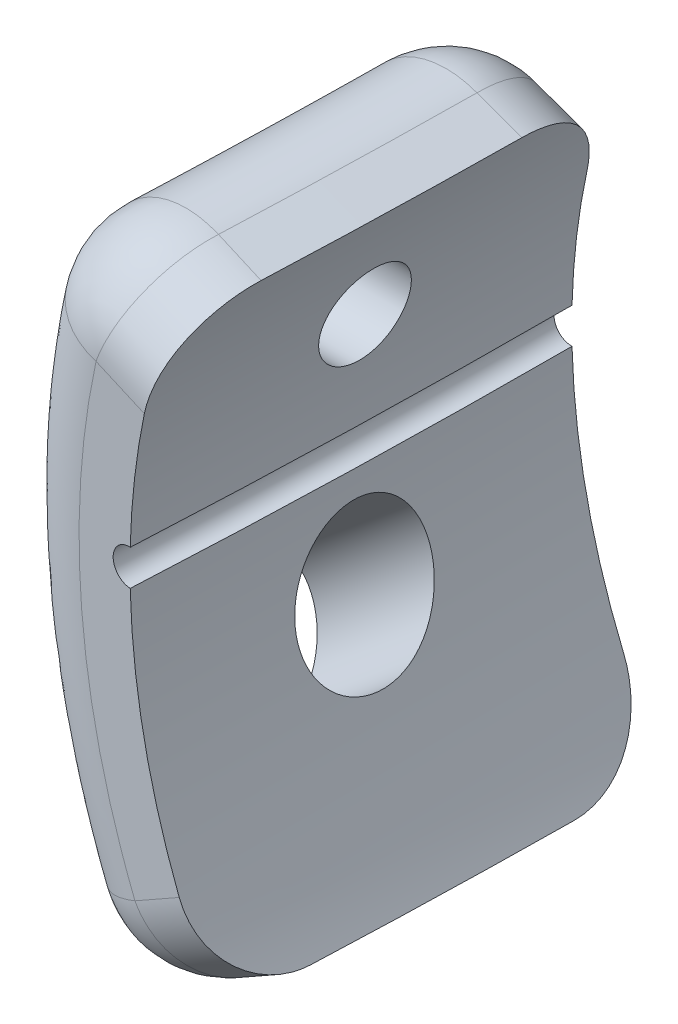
ISO-10303-21;
HEADER;
FILE_DESCRIPTION(('STEP AP214'),'2;1');
FILE_NAME('part.step','',(''),(''),'','','');
FILE_SCHEMA(('AUTOMOTIVE_DESIGN { 1 0 10303 214 1 1 1 1 }'));
ENDSEC;
DATA;
#1=APPLICATION_CONTEXT('core data for automotive mechanical design processes');
#2=APPLICATION_PROTOCOL_DEFINITION('international standard','automotive_design',2000,#1);
#3=PRODUCT_CONTEXT('',#1,'mechanical');
#4=PRODUCT('Part','Part','',(#3));
#5=PRODUCT_RELATED_PRODUCT_CATEGORY('part','',(#4));
#6=PRODUCT_DEFINITION_FORMATION('','',#4);
#7=PRODUCT_DEFINITION_CONTEXT('part definition',#1,'design');
#8=PRODUCT_DEFINITION('design','',#6,#7);
#9=PRODUCT_DEFINITION_SHAPE('','',#8);
#10=(LENGTH_UNIT() NAMED_UNIT(*) SI_UNIT(.MILLI.,.METRE.));
#11=(NAMED_UNIT(*) PLANE_ANGLE_UNIT() SI_UNIT($,.RADIAN.));
#12=(NAMED_UNIT(*) SI_UNIT($,.STERADIAN.) SOLID_ANGLE_UNIT());
#13=UNCERTAINTY_MEASURE_WITH_UNIT(LENGTH_MEASURE(1.E-05),#10,'distance_accuracy_value','');
#14=(GEOMETRIC_REPRESENTATION_CONTEXT(3) GLOBAL_UNCERTAINTY_ASSIGNED_CONTEXT((#13)) GLOBAL_UNIT_ASSIGNED_CONTEXT((#10,
#11,#12)) REPRESENTATION_CONTEXT('',''));
#15=CARTESIAN_POINT('',(0.,0.,0.));
#16=DIRECTION('',(0.,0.,1.));
#17=DIRECTION('',(1.,0.,0.));
#18=AXIS2_PLACEMENT_3D('',#15,#16,#17);
#19=CARTESIAN_POINT('',(0.,0.,0.));
#20=DIRECTION('',(0.,1.,0.));
#21=DIRECTION('',(0.,0.,1.));
#22=AXIS2_PLACEMENT_3D('',#19,#20,#21);
#23=TOROIDAL_SURFACE('',#22,200.,18.2);
#24=CARTESIAN_POINT('',(181.824267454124,1.46646798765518,3.56313041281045));
#25=CARTESIAN_POINT('',(181.819933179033,1.42346862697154,3.60689347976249));
#26=CARTESIAN_POINT('',(181.815886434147,1.38279169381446,3.65259218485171));
#27=CARTESIAN_POINT('',(181.810170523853,1.32526993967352,3.72404541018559));
#28=CARTESIAN_POINT('',(181.808324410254,1.30667921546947,3.74834811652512));
#29=CARTESIAN_POINT('',(181.804739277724,1.27067870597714,3.79793447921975));
#30=CARTESIAN_POINT('',(181.803000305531,1.25326942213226,3.82321859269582));
#31=CARTESIAN_POINT('',(181.79961892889,1.21965266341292,3.87478389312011));
#32=CARTESIAN_POINT('',(181.797974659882,1.20342864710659,3.90110731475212));
#33=CARTESIAN_POINT('',(181.794811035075,1.17258122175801,3.95412062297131));
#34=CARTESIAN_POINT('',(181.793283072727,1.15787180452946,3.98093898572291));
#35=CARTESIAN_POINT('',(181.788854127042,1.11597629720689,4.06212407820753));
#36=CARTESIAN_POINT('',(181.786097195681,1.09091613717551,4.11737453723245));
#37=CARTESIAN_POINT('',(181.78090056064,1.0465428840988,4.22999642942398));
#38=CARTESIAN_POINT('',(181.778458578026,1.027212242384,4.28742437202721));
#39=CARTESIAN_POINT('',(181.774993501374,1.00260567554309,4.37509451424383));
#40=CARTESIAN_POINT('',(181.773870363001,0.995131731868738,4.40461369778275));
#41=CARTESIAN_POINT('',(181.771682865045,0.981662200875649,4.46424404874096));
#42=CARTESIAN_POINT('',(181.770622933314,0.975697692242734,4.49424079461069));
#43=CARTESIAN_POINT('',(181.767559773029,0.960230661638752,4.58411280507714));
#44=CARTESIAN_POINT('',(181.765660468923,0.953058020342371,4.64415706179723));
#45=CARTESIAN_POINT('',(181.76212046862,0.944882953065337,4.76443703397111));
#46=CARTESIAN_POINT('',(181.76047926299,0.94387438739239,4.82468310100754));
#47=CARTESIAN_POINT('',(181.757452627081,0.94805159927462,4.9453885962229));
#48=CARTESIAN_POINT('',(181.75606734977,0.953234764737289,5.00583563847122));
#49=CARTESIAN_POINT('',(181.753578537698,0.970024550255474,5.12700068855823));
#50=CARTESIAN_POINT('',(181.752496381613,0.981492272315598,5.18669633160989));
#51=CARTESIAN_POINT('',(181.750684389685,1.01034714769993,5.30429504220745));
#52=CARTESIAN_POINT('',(181.749954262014,1.02773710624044,5.36221202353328));
#53=CARTESIAN_POINT('',(181.748899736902,1.06840705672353,5.47629143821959));
#54=CARTESIAN_POINT('',(181.748575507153,1.09169672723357,5.53246428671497));
#55=CARTESIAN_POINT('',(181.748454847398,1.13112350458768,5.61534689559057));
#56=CARTESIAN_POINT('',(181.748476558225,1.14505565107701,5.64280535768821));
#57=CARTESIAN_POINT('',(181.748655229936,1.17432889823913,5.69702003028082));
#58=CARTESIAN_POINT('',(181.748811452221,1.18959821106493,5.72365273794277));
#59=CARTESIAN_POINT('',(181.749494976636,1.23727836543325,5.80214668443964));
#60=CARTESIAN_POINT('',(181.750235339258,1.27161543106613,5.85275336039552));
#61=CARTESIAN_POINT('',(181.752372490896,1.34520293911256,5.95036971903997));
#62=CARTESIAN_POINT('',(181.753769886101,1.38448707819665,5.99743072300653));
#63=CARTESIAN_POINT('',(181.7564386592,1.44711067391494,6.06530055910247));
#64=CARTESIAN_POINT('',(181.757425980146,1.46864000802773,6.08750255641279));
#65=CARTESIAN_POINT('',(181.759606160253,1.51290944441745,6.13094396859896));
#66=CARTESIAN_POINT('',(181.760805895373,1.53576880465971,6.15228625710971));
#67=CARTESIAN_POINT('',(181.763405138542,1.58229531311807,6.19360800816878));
#68=CARTESIAN_POINT('',(181.764806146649,1.60600514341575,6.21363809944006));
#69=CARTESIAN_POINT('',(181.767820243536,1.65429076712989,6.25244606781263));
#70=CARTESIAN_POINT('',(181.769433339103,1.67886817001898,6.27122634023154));
#71=CARTESIAN_POINT('',(181.774606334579,1.75388711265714,6.32571839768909));
#72=CARTESIAN_POINT('',(181.778499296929,1.8056126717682,6.35958531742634));
#73=CARTESIAN_POINT('',(181.785077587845,1.8857595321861,6.40670171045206));
#74=CARTESIAN_POINT('',(181.787393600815,1.91290226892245,6.42179218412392));
#75=CARTESIAN_POINT('',(181.792286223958,1.96804959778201,6.45073091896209));
#76=CARTESIAN_POINT('',(181.794863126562,1.99605635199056,6.46457939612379));
#77=CARTESIAN_POINT('',(181.800291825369,2.05293675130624,6.4910123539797));
#78=CARTESIAN_POINT('',(181.80315052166,2.08186969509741,6.50361407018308));
#79=CARTESIAN_POINT('',(181.809084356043,2.13989840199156,6.52724128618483));
#80=CARTESIAN_POINT('',(181.812173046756,2.16913916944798,6.53833651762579));
#81=CARTESIAN_POINT('',(181.821790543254,2.25730902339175,6.56940741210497));
#82=CARTESIAN_POINT('',(181.828687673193,2.31686637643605,6.5872581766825));
#83=CARTESIAN_POINT('',(181.843483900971,2.43737499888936,6.61727846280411));
#84=CARTESIAN_POINT('',(181.851390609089,2.49838511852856,6.62945951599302));
#85=CARTESIAN_POINT('',(181.864028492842,2.59087173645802,6.64343555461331));
#86=CARTESIAN_POINT('',(181.8683793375,2.62191805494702,6.64737907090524));
#87=CARTESIAN_POINT('',(181.877348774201,2.6843453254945,6.65381220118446));
#88=CARTESIAN_POINT('',(181.881973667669,2.71576202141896,6.65629770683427));
#89=CARTESIAN_POINT('',(181.896110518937,2.80952662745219,6.66148176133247));
#90=CARTESIAN_POINT('',(181.905923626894,2.87169253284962,6.66197430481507));
#91=CARTESIAN_POINT('',(181.926315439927,2.99540014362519,6.65720931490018));
#92=CARTESIAN_POINT('',(181.936892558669,3.0569347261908,6.65195457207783));
#93=CARTESIAN_POINT('',(181.958790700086,3.17937118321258,6.63572933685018));
#94=CARTESIAN_POINT('',(181.970104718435,3.24023475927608,6.6247654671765));
#95=CARTESIAN_POINT('',(181.987642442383,3.33116364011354,6.60391149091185));
#96=CARTESIAN_POINT('',(181.993584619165,3.36141448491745,6.59621384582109));
#97=CARTESIAN_POINT('',(182.005516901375,3.42110345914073,6.57951628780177));
#98=CARTESIAN_POINT('',(182.011529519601,3.45066000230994,6.57049147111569));
#99=CARTESIAN_POINT('',(182.029651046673,3.53826086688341,6.54147574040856));
#100=CARTESIAN_POINT('',(182.041881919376,3.59543673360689,6.51950351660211));
#101=CARTESIAN_POINT('',(182.06654466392,3.70724546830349,6.47041562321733));
#102=CARTESIAN_POINT('',(182.078986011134,3.76192117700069,6.44328164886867));
#103=CARTESIAN_POINT('',(182.097734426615,3.84199609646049,6.39869820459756));
#104=CARTESIAN_POINT('',(182.104006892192,3.86839881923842,6.38316458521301));
#105=CARTESIAN_POINT('',(182.116562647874,3.92051938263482,6.35079792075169));
#106=CARTESIAN_POINT('',(182.122863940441,3.9463088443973,6.33391269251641));
#107=CARTESIAN_POINT('',(182.141638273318,4.02211244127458,6.28161985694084));
#108=CARTESIAN_POINT('',(182.153999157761,4.07065013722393,6.24455986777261));
#109=CARTESIAN_POINT('',(182.178343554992,4.16389194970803,6.16597272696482));
#110=CARTESIAN_POINT('',(182.190316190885,4.20855500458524,6.12448428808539));
#111=CARTESIAN_POINT('',(182.213785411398,4.29402942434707,6.03687290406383));
#112=CARTESIAN_POINT('',(182.225129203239,4.33428434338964,5.99130991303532));
#113=CARTESIAN_POINT('',(182.246906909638,4.40980634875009,5.89692966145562));
#114=CARTESIAN_POINT('',(182.257349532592,4.44510422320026,5.84808022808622));
#115=CARTESIAN_POINT('',(182.277240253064,4.5107698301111,5.74705183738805));
#116=CARTESIAN_POINT('',(182.28668947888,4.54113971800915,5.69486148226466));
#117=CARTESIAN_POINT('',(182.30002330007,4.58288734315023,5.61402149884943));
#118=CARTESIAN_POINT('',(182.304336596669,4.59619303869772,5.58657703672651));
#119=CARTESIAN_POINT('',(182.312620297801,4.62136583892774,5.53110713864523));
#120=CARTESIAN_POINT('',(182.316578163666,4.63319634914,5.50317496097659));
#121=CARTESIAN_POINT('',(182.327887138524,4.66643209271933,5.41880992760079));
#122=CARTESIAN_POINT('',(182.334700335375,4.68566982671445,5.36166801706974));
#123=CARTESIAN_POINT('',(182.346786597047,4.71824789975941,5.24579813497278));
#124=CARTESIAN_POINT('',(182.352067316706,4.73160907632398,5.18699704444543));
#125=CARTESIAN_POINT('',(182.358777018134,4.74715577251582,5.09764377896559));
#126=CARTESIAN_POINT('',(182.360813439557,4.75158960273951,5.06761489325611));
#127=CARTESIAN_POINT('',(182.364471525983,4.75892925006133,5.00713538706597));
#128=CARTESIAN_POINT('',(182.366090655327,4.76182656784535,4.97669024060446));
#129=CARTESIAN_POINT('',(182.370261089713,4.76810616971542,4.88574266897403));
#130=CARTESIAN_POINT('',(182.372154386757,4.76915138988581,4.82530517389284));
#131=CARTESIAN_POINT('',(182.374198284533,4.76508299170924,4.70480397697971));
#132=CARTESIAN_POINT('',(182.374349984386,4.75997335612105,4.64474124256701));
#133=CARTESIAN_POINT('',(182.372922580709,4.74357038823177,4.52499386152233));
#134=CARTESIAN_POINT('',(182.371344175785,4.73228118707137,4.46532249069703));
#135=CARTESIAN_POINT('',(182.366435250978,4.70328798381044,4.34631839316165));
#136=CARTESIAN_POINT('',(182.363148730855,4.68584227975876,4.2880567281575));
#137=CARTESIAN_POINT('',(182.355045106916,4.64531938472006,4.17399340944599));
#138=CARTESIAN_POINT('',(182.350227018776,4.62223740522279,4.11817691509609));
#139=CARTESIAN_POINT('',(182.339154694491,4.57050203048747,4.00893896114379));
#140=CARTESIAN_POINT('',(182.332895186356,4.541825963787,3.95549381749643));
#141=CARTESIAN_POINT('',(182.319027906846,4.4788963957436,3.85112611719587));
#142=CARTESIAN_POINT('',(182.311357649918,4.44436300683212,3.79989323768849));
#143=CARTESIAN_POINT('',(182.295111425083,4.3712505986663,3.70233095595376));
#144=CARTESIAN_POINT('',(182.286479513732,4.33241630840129,3.65552816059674));
#145=CARTESIAN_POINT('',(182.26836024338,4.25044775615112,3.56602492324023));
#146=CARTESIAN_POINT('',(182.258867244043,4.20728898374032,3.52327984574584));
#147=CARTESIAN_POINT('',(182.239118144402,4.11660371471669,3.44180020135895));
#148=CARTESIAN_POINT('',(182.228859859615,4.06906802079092,3.40305803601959));
#149=CARTESIAN_POINT('',(182.207668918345,3.96951593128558,3.32972989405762));
#150=CARTESIAN_POINT('',(182.196913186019,3.91832694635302,3.29575034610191));
#151=CARTESIAN_POINT('',(182.17517698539,3.81316464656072,3.23291408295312));
#152=CARTESIAN_POINT('',(182.164198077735,3.75919942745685,3.20406453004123));
#153=CARTESIAN_POINT('',(182.142104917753,3.64851089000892,3.15145251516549));
#154=CARTESIAN_POINT('',(182.130983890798,3.59175033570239,3.12768346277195));
#155=CARTESIAN_POINT('',(182.108702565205,3.47555103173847,3.08535950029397));
#156=CARTESIAN_POINT('',(182.097465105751,3.41567720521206,3.06672224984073));
#157=CARTESIAN_POINT('',(182.075478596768,3.29569869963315,3.03553416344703));
#158=CARTESIAN_POINT('',(182.064644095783,3.23516077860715,3.02279708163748));
#159=CARTESIAN_POINT('',(182.043371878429,3.11323122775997,3.00303767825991));
#160=CARTESIAN_POINT('',(182.032925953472,3.0517979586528,2.99599844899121));
#161=CARTESIAN_POINT('',(182.012441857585,2.92799640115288,2.98766404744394));
#162=CARTESIAN_POINT('',(182.002393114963,2.86556073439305,2.98636991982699));
#163=CARTESIAN_POINT('',(181.982758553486,2.73995567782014,2.98975294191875));
#164=CARTESIAN_POINT('',(181.973327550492,2.67778334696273,2.99439323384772));
#165=CARTESIAN_POINT('',(181.955155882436,2.5543996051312,3.00941204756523));
#166=CARTESIAN_POINT('',(181.946422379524,2.49323356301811,3.01978984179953));
#167=CARTESIAN_POINT('',(181.929622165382,2.37195835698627,3.04628124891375));
#168=CARTESIAN_POINT('',(181.921555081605,2.31184300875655,3.06240080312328));
#169=CARTESIAN_POINT('',(181.909927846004,2.22250948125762,3.09098521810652));
#170=CARTESIAN_POINT('',(181.906122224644,2.19279845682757,3.10128294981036));
#171=CARTESIAN_POINT('',(181.89870889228,2.13402246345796,3.12325130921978));
#172=CARTESIAN_POINT('',(181.895109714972,2.10502901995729,3.13488912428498));
#173=CARTESIAN_POINT('',(181.884621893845,2.01926093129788,3.17172660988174));
#174=CARTESIAN_POINT('',(181.878019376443,1.96352190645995,3.19889349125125));
#175=CARTESIAN_POINT('',(181.865527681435,1.85512080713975,3.2583031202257));
#176=CARTESIAN_POINT('',(181.859631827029,1.80240238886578,3.29057253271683));
#177=CARTESIAN_POINT('',(181.85125734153,1.72567024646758,3.34281140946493));
#178=CARTESIAN_POINT('',(181.848540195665,1.70044638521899,3.36089653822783));
#179=CARTESIAN_POINT('',(181.843256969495,1.65084101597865,3.39833310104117));
#180=CARTESIAN_POINT('',(181.840678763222,1.62634226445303,3.41778544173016));
#181=CARTESIAN_POINT('',(181.835708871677,1.5786439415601,3.45761947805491));
#182=CARTESIAN_POINT('',(181.833310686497,1.55538553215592,3.47803811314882));
#183=CARTESIAN_POINT('',(181.828673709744,1.51004889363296,3.51985203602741));
#184=CARTESIAN_POINT('',(181.82643459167,1.487967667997,3.54124887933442));
#185=CARTESIAN_POINT('',(181.824267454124,1.46646798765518,3.56313041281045));
#186=B_SPLINE_CURVE_WITH_KNOTS('',3,(#24,#25,#26,#27,#28,#29,#30,#31,#32,#33,#34,#35,#36,#37,
#38,#39,#40,#41,#42,#43,#44,#45,#46,#47,#48,#49,#50,#51,#52,#53,#54,#55,#56,#57,#58,#59,#60,#61,
#62,#63,#64,#65,#66,#67,#68,#69,#70,#71,#72,#73,#74,#75,#76,#77,#78,#79,#80,#81,#82,#83,#84,#85,
#86,#87,#88,#89,#90,#91,#92,#93,#94,#95,#96,#97,#98,#99,#100,#101,#102,#103,#104,#105,#106,#107,
#108,#109,#110,#111,#112,#113,#114,#115,#116,#117,#118,#119,#120,#121,#122,#123,#124,#125,#126,
#127,#128,#129,#130,#131,#132,#133,#134,#135,#136,#137,#138,#139,#140,#141,#142,#143,#144,#145,
#146,#147,#148,#149,#150,#151,#152,#153,#154,#155,#156,#157,#158,#159,#160,#161,#162,#163,#164,
#165,#166,#167,#168,#169,#170,#171,#172,#173,#174,#175,#176,#177,#178,#179,#180,#181,#182,#183,
#184,#185),.UNSPECIFIED.,.T.,.F.,(4,2,2,2,2,2,2,2,2,2,2,2,2,2,2,2,2,2,2,2,2,2,2,2,2,2,2,2,2,2,2,
2,2,2,2,2,2,2,2,2,2,2,2,2,2,2,2,2,2,2,2,2,2,2,2,2,2,2,2,2,2,2,2,2,2,2,2,2,2,2,2,2,2,2,2,2,2,2,2,
2,4),(-0.000220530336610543,-3.91151731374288E-05,5.15924085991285E-05,0.000142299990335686,
0.000233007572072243,0.0003237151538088,0.000505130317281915,0.000686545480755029,
0.000777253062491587,0.000867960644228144,0.00104937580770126,0.00123079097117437,
0.00141220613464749,0.0015936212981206,0.00177503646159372,0.00195645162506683,
0.00204715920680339,0.00213786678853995,0.00231928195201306,0.00250069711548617,
0.00259140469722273,0.00268211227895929,0.00277281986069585,0.0028635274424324,
0.00304494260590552,0.00313565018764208,0.00322635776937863,0.00331706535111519,
0.00340777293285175,0.00358918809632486,0.00377060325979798,0.00386131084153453,
0.00395201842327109,0.00413343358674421,0.00431484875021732,0.00449626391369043,
0.00458697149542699,0.00467767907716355,0.00485909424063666,0.00504050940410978,
0.00513121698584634,0.00522192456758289,0.00540333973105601,0.00558475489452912,
0.00576617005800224,0.00594758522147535,0.00612900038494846,0.00621970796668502,
0.00631041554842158,0.00649183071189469,0.00667324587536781,0.00676395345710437,
0.00685466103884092,0.00703607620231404,0.00721749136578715,0.00739890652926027,
0.00758032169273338,0.0077617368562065,0.00794315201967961,0.00812456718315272,
0.00830598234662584,0.00848739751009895,0.00866881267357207,0.00885022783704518,
0.0090316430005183,0.00921305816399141,0.00939447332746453,0.00957588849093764,
0.00975730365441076,0.00993871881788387,0.010120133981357,0.0103015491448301,0.0104829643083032,
0.0105736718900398,0.0106643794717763,0.0108457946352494,0.0110272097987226,0.0111179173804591,
0.0112086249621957,0.0112993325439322,0.0113900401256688),.UNSPECIFIED.);
#187=CARTESIAN_POINT('',(182.14602029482,4.03898288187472,6.26778638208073));
#188=VERTEX_POINT('',#187);
#189=CARTESIAN_POINT('',(182.222462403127,4.03897878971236,3.38108145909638));
#190=VERTEX_POINT('',#189);
#191=EDGE_CURVE('E399',#188,#190,#186,.F.);
#192=ORIENTED_EDGE('',*,*,#191,.T.);
#193=CARTESIAN_POINT('',(0.,4.03898339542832,0.));
#194=DIRECTION('',(0.,-1.,0.));
#195=DIRECTION('',(0.,0.,-1.));
#196=AXIS2_PLACEMENT_3D('',#193,#194,#195);
#197=CIRCLE('',#196,182.253828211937);
#198=CARTESIAN_POINT('',(182.243085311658,4.03898339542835,1.97882641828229));
#199=VERTEX_POINT('',#198);
#200=EDGE_CURVE('E54',#190,#199,#197,.F.);
#201=ORIENTED_EDGE('',*,*,#200,.T.);
#202=CARTESIAN_POINT('',(186.4614897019,8.91285844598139,0.));
#203=CARTESIAN_POINT('',(184.806313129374,10.003443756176,0.));
#204=CARTESIAN_POINT('',(184.791488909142,10.013211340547,1.98208744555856));
#205=CARTESIAN_POINT('',(186.210795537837,8.53247000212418,0.));
#206=CARTESIAN_POINT('',(184.525263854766,9.57635750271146,0.));
#207=CARTESIAN_POINT('',(184.509848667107,9.58586136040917,1.98173141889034));
#208=CARTESIAN_POINT('',(185.976232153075,8.14146153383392,0.));
#209=CARTESIAN_POINT('',(184.262287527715,9.13734474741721,0.));
#210=CARTESIAN_POINT('',(184.246330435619,9.14658024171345,1.9813968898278));
#211=CARTESIAN_POINT('',(185.540856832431,7.34110752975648,0.));
#212=CARTESIAN_POINT('',(183.77420968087,8.23881432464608,0.));
#213=CARTESIAN_POINT('',(183.757211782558,8.24741710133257,1.98077392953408));
#214=CARTESIAN_POINT('',(185.340043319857,6.93176285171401,0.));
#215=CARTESIAN_POINT('',(183.549094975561,7.77929051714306,0.));
#216=CARTESIAN_POINT('',(183.531609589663,7.78753604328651,1.98048549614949));
#217=CARTESIAN_POINT('',(184.973709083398,6.09777441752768,0.));
#218=CARTESIAN_POINT('',(183.138456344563,6.84314096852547,0.));
#219=CARTESIAN_POINT('',(183.120054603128,6.85058607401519,1.97995790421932));
#220=CARTESIAN_POINT('',(184.808173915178,5.67313700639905,0.));
#221=CARTESIAN_POINT('',(182.95290607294,6.36651320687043,0.));
#222=CARTESIAN_POINT('',(182.934085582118,6.37352429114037,1.97971872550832));
#223=CARTESIAN_POINT('',(184.513457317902,4.81143501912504,0.));
#224=CARTESIAN_POINT('',(182.62257397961,5.39937198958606,0.));
#225=CARTESIAN_POINT('',(182.602988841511,5.40543934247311,1.97929199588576));
#226=CARTESIAN_POINT('',(184.384275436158,4.37437059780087,0.));
#227=CARTESIAN_POINT('',(182.477783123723,4.90884781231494,0.));
#228=CARTESIAN_POINT('',(182.457860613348,4.91441635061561,1.97910444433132));
#229=CARTESIAN_POINT('',(184.163176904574,3.4908824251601,0.));
#230=CARTESIAN_POINT('',(182.22998170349,3.91734700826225,0.));
#231=CARTESIAN_POINT('',(182.209469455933,3.92185556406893,1.97878296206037));
#232=CARTESIAN_POINT('',(184.0712628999,3.04445801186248,0.));
#233=CARTESIAN_POINT('',(182.126967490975,3.41635730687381,0.));
#234=CARTESIAN_POINT('',(182.106209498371,3.42031702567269,1.97864903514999));
#235=CARTESIAN_POINT('',(183.925338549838,2.14528500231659,0.));
#236=CARTESIAN_POINT('',(181.96342693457,2.40732027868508,0.));
#237=CARTESIAN_POINT('',(181.942272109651,2.41013500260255,1.97843622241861));
#238=CARTESIAN_POINT('',(183.871342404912,1.69253410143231,0.));
#239=CARTESIAN_POINT('',(181.902912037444,1.89925697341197,0.));
#240=CARTESIAN_POINT('',(181.881610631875,1.9014889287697,1.9783573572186));
#241=CARTESIAN_POINT('',(183.801722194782,0.784460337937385,0.));
#242=CARTESIAN_POINT('',(181.824889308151,0.880270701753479,0.));
#243=CARTESIAN_POINT('',(181.803396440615,0.881307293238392,1.97825564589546));
#244=CARTESIAN_POINT('',(183.786067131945,0.329139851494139,0.));
#245=CARTESIAN_POINT('',(181.807344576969,0.369336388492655,0.));
#246=CARTESIAN_POINT('',(181.785808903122,0.369774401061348,1.97823275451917));
#247=CARTESIAN_POINT('',(183.793151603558,-0.581408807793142,0.));
#248=CARTESIAN_POINT('',(181.815284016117,-0.652415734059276,0.));
#249=CARTESIAN_POINT('',(181.793767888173,-0.65318767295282,1.97824310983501));
#250=CARTESIAN_POINT('',(183.815908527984,-1.03663684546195,0.));
#251=CARTESIAN_POINT('',(181.840787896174,-1.16324758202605,0.));
#252=CARTESIAN_POINT('',(181.819333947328,-1.16461670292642,1.97827638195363));
#253=CARTESIAN_POINT('',(183.899693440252,-1.94361213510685,0.));
#254=CARTESIAN_POINT('',(181.934685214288,-2.18100632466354,0.));
#255=CARTESIAN_POINT('',(181.913461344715,-2.18356425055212,1.9783987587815));
#256=CARTESIAN_POINT('',(183.960725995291,-2.39535896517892,0.));
#257=CARTESIAN_POINT('',(182.003086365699,-2.68794668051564,0.));
#258=CARTESIAN_POINT('',(181.982027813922,-2.69108229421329,1.97848787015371));
#259=CARTESIAN_POINT('',(184.120595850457,-3.29190167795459,0.));
#260=CARTESIAN_POINT('',(182.182257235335,-3.69404214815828,0.));
#261=CARTESIAN_POINT('',(182.161632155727,-3.69830929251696,1.97872091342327));
#262=CARTESIAN_POINT('',(184.219416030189,-3.7367006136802,0.));
#263=CARTESIAN_POINT('',(182.293012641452,-4.19321390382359,0.));
#264=CARTESIAN_POINT('',(182.272650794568,-4.19802167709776,1.97886482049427));
#265=CARTESIAN_POINT('',(184.454256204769,-4.61675397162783,0.));
#266=CARTESIAN_POINT('',(182.556218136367,-5.18087492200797,0.));
#267=CARTESIAN_POINT('',(182.536479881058,-5.18672359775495,1.97920604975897));
#268=CARTESIAN_POINT('',(184.590306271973,-5.05200036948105,0.));
#269=CARTESIAN_POINT('',(182.708708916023,-5.66936727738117,0.));
#270=CARTESIAN_POINT('',(182.689324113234,-5.67570411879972,1.97940341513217));
#271=CARTESIAN_POINT('',(184.898544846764,-5.90931856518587,0.));
#272=CARTESIAN_POINT('',(183.054201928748,-6.631607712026,0.));
#273=CARTESIAN_POINT('',(183.0356120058,-6.63886406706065,1.9798493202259));
#274=CARTESIAN_POINT('',(185.070719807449,-6.33139523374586,0.));
#275=CARTESIAN_POINT('',(183.24719784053,-7.10537186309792,0.));
#276=CARTESIAN_POINT('',(183.229040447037,-7.11304896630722,1.9800978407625));
#277=CARTESIAN_POINT('',(185.449970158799,-7.15944485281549,0.));
#278=CARTESIAN_POINT('',(183.672321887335,-8.03487898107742,0.));
#279=CARTESIAN_POINT('',(183.655105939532,-8.0433269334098,1.98064342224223));
#280=CARTESIAN_POINT('',(185.657037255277,-7.56542160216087,0.));
#281=CARTESIAN_POINT('',(183.904451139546,-8.49063498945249,0.));
#282=CARTESIAN_POINT('',(183.887733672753,-8.49942426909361,1.9809404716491));
#283=CARTESIAN_POINT('',(186.104627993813,-8.35850011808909,0.));
#284=CARTESIAN_POINT('',(184.406233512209,-9.38102414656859,0.));
#285=CARTESIAN_POINT('',(184.390575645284,-9.39041371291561,1.98158007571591));
#286=CARTESIAN_POINT('',(186.345152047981,-8.74560165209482,0.));
#287=CARTESIAN_POINT('',(184.675898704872,-9.81566373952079,0.));
#288=CARTESIAN_POINT('',(184.660790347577,-9.82530555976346,1.98192263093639));
#289=CARTESIAN_POINT('',(186.858061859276,-9.4983177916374,0.));
#290=CARTESIAN_POINT('',(185.250976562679,-10.6608941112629,0.));
#291=CARTESIAN_POINT('',(185.237014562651,-10.6709496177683,1.98264992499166));
#292=CARTESIAN_POINT('',(187.13046057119,-9.86392356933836,0.));
#293=CARTESIAN_POINT('',(185.556416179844,-11.0714794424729,0.));
#294=CARTESIAN_POINT('',(185.5430386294,-11.0816919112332,1.98303468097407));
#295=CARTESIAN_POINT('',(187.705072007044,-10.5709301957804,0.));
#296=CARTESIAN_POINT('',(186.200759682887,-11.8655560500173,0.));
#297=CARTESIAN_POINT('',(186.188581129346,-11.8759833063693,1.98384238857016));
#298=CARTESIAN_POINT('',(188.007286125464,-10.9123299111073,0.));
#299=CARTESIAN_POINT('',(186.539677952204,-12.2490481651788,0.));
#300=CARTESIAN_POINT('',(186.528101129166,-12.2595311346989,1.98426534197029));
#301=CARTESIAN_POINT('',(188.323410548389,-11.2403358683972,0.));
#302=CARTESIAN_POINT('',(186.894178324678,-12.6175000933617,0.));
#303=CARTESIAN_POINT('',(186.883248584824,-12.6280316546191,1.98470543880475));
#304=(BOUNDED_SURFACE() B_SPLINE_SURFACE(3,2,((#202,#203,#204),(#205,#206,#207),(#208,#209,
#210),(#211,#212,#213),(#214,#215,#216),(#217,#218,#219),(#220,#221,#222),(#223,#224,#225),
(#226,#227,#228),(#229,#230,#231),(#232,#233,#234),(#235,#236,#237),(#238,#239,#240),(#241,#242,
#243),(#244,#245,#246),(#247,#248,#249),(#250,#251,#252),(#253,#254,#255),(#256,#257,#258),
(#259,#260,#261),(#262,#263,#264),(#265,#266,#267),(#268,#269,#270),(#271,#272,#273),(#274,#275,
#276),(#277,#278,#279),(#280,#281,#282),(#283,#284,#285),(#286,#287,#288),(#289,#290,#291),
(#292,#293,#294),(#295,#296,#297),(#298,#299,#300),(#301,#302,#303)),.UNSPECIFIED.,.F.,.F.,
.F.) B_SPLINE_SURFACE_WITH_KNOTS((4,2,2,2,2,2,2,2,2,2,2,2,2,2,2,2,4),(3,3),(0.,1.36628930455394,
2.73251476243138,4.09817975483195,5.46382774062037,6.82957263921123,8.19582874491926,
9.56097990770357,10.9267492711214,12.2926816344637,13.6579958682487,15.0244162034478,
16.3903250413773,17.7559096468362,19.1215110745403,20.487669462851,21.8538917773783),(0.,1.),
.UNSPECIFIED.) GEOMETRIC_REPRESENTATION_ITEM() RATIONAL_B_SPLINE_SURFACE(((1.,0.710266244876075,
1.),(1.,0.710328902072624,1.),(1.,0.710387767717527,1.),(1.,0.710497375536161,1.),(1.,
0.710548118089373,1.),(1.,0.710640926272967,1.),(1.,0.710682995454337,1.),(1.,0.710758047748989,
1.),(1.,0.710791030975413,1.),(1.,0.710847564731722,1.),(1.,0.710871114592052,1.),(1.,
0.71090853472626,1.),(1.,0.710922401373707,1.),(1.,0.710940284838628,1.),(1.,0.710944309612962,
1.),(1.,0.710942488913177,1.),(1.,0.71093663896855,1.),(1.,0.710915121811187,1.),(1.,
0.710899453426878,1.),(1.,0.710858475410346,1.),(1.,0.710833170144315,1.),(1.,0.710773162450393,
1.),(1.,0.710738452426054,1.),(1.,0.710660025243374,1.),(1.,0.710616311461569,1.),(1.,
0.710520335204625,1.),(1.,0.710468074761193,1.),(1.,0.7103555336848,1.),(1.,0.710295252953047,
1.),(1.,0.710167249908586,1.),(1.,0.710099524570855,1.),(1.,0.709957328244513,1.),(1.,
0.709882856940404,1.),(1.,0.709805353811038,1.))) REPRESENTATION_ITEM('') SURFACE());
#305=CARTESIAN_POINT('',(184.791488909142,10.013211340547,1.98208744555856));
#306=CARTESIAN_POINT('',(184.509848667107,9.58586136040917,1.98173141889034));
#307=CARTESIAN_POINT('',(184.246330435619,9.14658024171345,1.9813968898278));
#308=CARTESIAN_POINT('',(183.757211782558,8.24741710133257,1.98077392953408));
#309=CARTESIAN_POINT('',(183.531609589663,7.78753604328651,1.98048549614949));
#310=CARTESIAN_POINT('',(183.120054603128,6.85058607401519,1.97995790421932));
#311=CARTESIAN_POINT('',(182.934085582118,6.37352429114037,1.97971872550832));
#312=CARTESIAN_POINT('',(182.602988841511,5.40543934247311,1.97929199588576));
#313=CARTESIAN_POINT('',(182.457860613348,4.91441635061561,1.97910444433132));
#314=CARTESIAN_POINT('',(182.209469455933,3.92185556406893,1.97878296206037));
#315=CARTESIAN_POINT('',(182.106209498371,3.42031702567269,1.97864903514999));
#316=CARTESIAN_POINT('',(181.942272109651,2.41013500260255,1.97843622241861));
#317=CARTESIAN_POINT('',(181.881610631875,1.9014889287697,1.9783573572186));
#318=CARTESIAN_POINT('',(181.803396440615,0.881307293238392,1.97825564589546));
#319=CARTESIAN_POINT('',(181.785808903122,0.369774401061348,1.97823275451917));
#320=CARTESIAN_POINT('',(181.793767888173,-0.653187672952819,1.97824310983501));
#321=CARTESIAN_POINT('',(181.819333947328,-1.16461670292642,1.97827638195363));
#322=CARTESIAN_POINT('',(181.913461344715,-2.18356425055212,1.9783987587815));
#323=CARTESIAN_POINT('',(181.982027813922,-2.69108229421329,1.97848787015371));
#324=CARTESIAN_POINT('',(182.161632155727,-3.69830929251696,1.97872091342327));
#325=CARTESIAN_POINT('',(182.272650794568,-4.19802167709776,1.97886482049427));
#326=CARTESIAN_POINT('',(182.536479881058,-5.18672359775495,1.97920604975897));
#327=CARTESIAN_POINT('',(182.689324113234,-5.67570411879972,1.97940341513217));
#328=CARTESIAN_POINT('',(183.0356120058,-6.63886406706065,1.9798493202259));
#329=CARTESIAN_POINT('',(183.229040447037,-7.11304896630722,1.9800978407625));
#330=CARTESIAN_POINT('',(183.655105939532,-8.04332693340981,1.98064342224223));
#331=CARTESIAN_POINT('',(183.887733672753,-8.49942426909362,1.9809404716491));
#332=CARTESIAN_POINT('',(184.390575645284,-9.39041371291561,1.98158007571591));
#333=CARTESIAN_POINT('',(184.660790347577,-9.82530555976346,1.98192263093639));
#334=CARTESIAN_POINT('',(185.237014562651,-10.6709496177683,1.98264992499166));
#335=CARTESIAN_POINT('',(185.5430386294,-11.0816919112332,1.98303468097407));
#336=CARTESIAN_POINT('',(186.188581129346,-11.8759833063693,1.98384238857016));
#337=CARTESIAN_POINT('',(186.528101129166,-12.2595311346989,1.98426534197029));
#338=CARTESIAN_POINT('',(186.883248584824,-12.6280316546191,1.98470543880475));
#339=B_SPLINE_CURVE_WITH_KNOTS('',3,(#305,#306,#307,#308,#309,#310,#311,#312,#313,#314,#315,
#316,#317,#318,#319,#320,#321,#322,#323,#324,#325,#326,#327,#328,#329,#330,#331,#332,#333,#334,
#335,#336,#337,#338),.UNSPECIFIED.,.F.,.F.,(4,2,2,2,2,2,2,2,2,2,2,2,2,2,2,2,4),(0.,
1.36628930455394,2.73251476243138,4.09817975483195,5.46382774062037,6.82957263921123,
8.19582874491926,9.56097990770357,10.9267492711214,12.2926816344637,13.6579958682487,
15.0244162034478,16.3903250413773,17.7559096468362,19.1215110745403,20.487669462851,
21.8538917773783),.UNSPECIFIED.);
#340=CARTESIAN_POINT('',(183.282409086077,-7.21939591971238,1.98016602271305));
#341=VERTEX_POINT('',#340);
#342=EDGE_CURVE('E66',#199,#341,#339,.T.);
#343=ORIENTED_EDGE('',*,*,#342,.T.);
#344=CARTESIAN_POINT('',(0.,-7.21939591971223,0.));
#345=DIRECTION('',(0.,1.,0.));
#346=DIRECTION('',(0.,0.,1.));
#347=AXIS2_PLACEMENT_3D('',#344,#345,#346);
#348=CIRCLE('',#347,183.293105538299);
#349=CARTESIAN_POINT('',(183.134860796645,-7.21939591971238,7.61480786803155));
#350=VERTEX_POINT('',#349);
#351=EDGE_CURVE('E421',#341,#350,#348,.F.);
#352=ORIENTED_EDGE('',*,*,#351,.T.);
#353=CARTESIAN_POINT('',(188.065160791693,-11.2401705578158,9.85607743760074));
#354=CARTESIAN_POINT('',(186.637867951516,-12.6173143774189,9.78127618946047));
#355=CARTESIAN_POINT('',(186.730824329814,-12.627845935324,7.7987189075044));
#356=CARTESIAN_POINT('',(187.749449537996,-10.9121344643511,9.8395317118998));
#357=CARTESIAN_POINT('',(186.283830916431,-12.2488286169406,9.76272189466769));
#358=CARTESIAN_POINT('',(186.376118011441,-12.2593115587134,7.78057026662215));
#359=CARTESIAN_POINT('',(187.44763189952,-10.5707027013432,9.8237141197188));
#360=CARTESIAN_POINT('',(185.945357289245,-11.8653005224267,9.74498324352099));
#361=CARTESIAN_POINT('',(186.037021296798,-11.8757277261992,7.76322252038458));
#362=CARTESIAN_POINT('',(186.873777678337,-9.86362876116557,9.79363969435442));
#363=CARTESIAN_POINT('',(185.301862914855,-11.0711483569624,9.71125913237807));
#364=CARTESIAN_POINT('',(185.392287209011,-11.0813607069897,7.73024229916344));
#365=CARTESIAN_POINT('',(186.601739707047,-9.49798771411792,9.77938278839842));
#366=CARTESIAN_POINT('',(184.996827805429,-10.6605234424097,9.69527291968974));
#367=CARTESIAN_POINT('',(185.086648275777,-10.6705787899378,7.71460974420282));
#368=CARTESIAN_POINT('',(186.08951376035,-8.74519927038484,9.75253816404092));
#369=CARTESIAN_POINT('',(184.422516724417,-9.81521193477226,9.66517455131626));
#370=CARTESIAN_POINT('',(184.51115427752,-9.82485350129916,7.68517770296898));
#371=CARTESIAN_POINT('',(185.849312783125,-8.35806074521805,9.73994976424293));
#372=CARTESIAN_POINT('',(184.153213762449,-9.38053083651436,9.65106098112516));
#373=CARTESIAN_POINT('',(184.24128460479,-9.38992009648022,7.67137746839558));
#374=CARTESIAN_POINT('',(185.402328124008,-7.56490653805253,9.71652429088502));
#375=CARTESIAN_POINT('',(183.652110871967,-8.49005676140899,9.62479929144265));
#376=CARTESIAN_POINT('',(183.739090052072,-8.49884561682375,7.64569906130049));
#377=CARTESIAN_POINT('',(185.195544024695,-7.15889109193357,9.70568719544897));
#378=CARTESIAN_POINT('',(183.420298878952,-8.03425734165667,9.61265053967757));
#379=CARTESIAN_POINT('',(183.506764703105,-8.04270480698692,7.63382086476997));
#380=CARTESIAN_POINT('',(184.816854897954,-6.33084411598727,9.68584093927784));
#381=CARTESIAN_POINT('',(182.995803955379,-7.10475324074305,9.59040370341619));
#382=CARTESIAN_POINT('',(183.081301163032,-7.11242980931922,7.61206953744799));
#383=CARTESIAN_POINT('',(184.644951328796,-5.90881191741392,9.67683185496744));
#384=CARTESIAN_POINT('',(182.803112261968,-6.6310390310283,9.58030515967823));
#385=CARTESIAN_POINT('',(182.888164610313,-6.63829487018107,7.60219649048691));
#386=CARTESIAN_POINT('',(184.337197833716,-5.0515869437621,9.66070317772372));
#387=CARTESIAN_POINT('',(182.458162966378,-5.66890326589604,9.56222713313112));
#388=CARTESIAN_POINT('',(182.542398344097,-5.67523965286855,7.58452207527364));
#389=CARTESIAN_POINT('',(184.201361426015,-4.61638930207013,9.65358429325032));
#390=CARTESIAN_POINT('',(182.305911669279,-5.18046564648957,9.55424798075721));
#391=CARTESIAN_POINT('',(182.389783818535,-5.1863139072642,7.57672148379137));
#392=CARTESIAN_POINT('',(183.966888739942,-3.73643629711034,9.64129610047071));
#393=CARTESIAN_POINT('',(182.043118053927,-4.19291727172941,9.54047555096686));
#394=CARTESIAN_POINT('',(182.126349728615,-4.19772472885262,7.56325711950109));
#395=CARTESIAN_POINT('',(183.86822245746,-3.29168895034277,9.63612521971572));
#396=CARTESIAN_POINT('',(181.932535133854,-3.6938034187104,9.53468014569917));
#397=CARTESIAN_POINT('',(182.015496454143,-3.69807030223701,7.5575916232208));
#398=CARTESIAN_POINT('',(183.708599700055,-2.39525141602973,9.62775974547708));
#399=CARTESIAN_POINT('',(181.753641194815,-2.68782598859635,9.52530471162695));
#400=CARTESIAN_POINT('',(181.836157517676,-2.69096146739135,7.54842619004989));
#401=CARTESIAN_POINT('',(183.647660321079,-1.94355817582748,9.62456604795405));
#402=CARTESIAN_POINT('',(181.685344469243,-2.18094577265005,9.52172543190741));
#403=CARTESIAN_POINT('',(181.767691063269,-2.18350362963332,7.54492723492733));
#404=CARTESIAN_POINT('',(183.563990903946,-1.03659009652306,9.6201811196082));
#405=CARTESIAN_POINT('',(181.591576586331,-1.16319512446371,9.5168112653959));
#406=CARTESIAN_POINT('',(181.673687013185,-1.16456418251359,7.54012323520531));
#407=CARTESIAN_POINT('',(183.541264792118,-0.581314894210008,9.61899009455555));
#408=CARTESIAN_POINT('',(181.566107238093,-0.652310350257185,9.51547647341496));
#409=CARTESIAN_POINT('',(181.648153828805,-0.653082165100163,7.53881841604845));
#410=CARTESIAN_POINT('',(183.534197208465,0.32932781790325,9.6186196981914));
#411=CARTESIAN_POINT('',(181.558186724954,0.369547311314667,9.51506137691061));
#412=CARTESIAN_POINT('',(181.640213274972,0.369985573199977,7.53841262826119));
#413=CARTESIAN_POINT('',(183.549838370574,0.784695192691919,9.61943941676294));
#414=CARTESIAN_POINT('',(181.575715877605,0.880534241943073,9.51598004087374));
#415=CARTESIAN_POINT('',(181.65778639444,0.881571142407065,7.5393106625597));
#416=CARTESIAN_POINT('',(183.619386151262,1.69286175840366,9.62308426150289));
#417=CARTESIAN_POINT('',(181.653657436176,1.89962465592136,9.52006478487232));
#418=CARTESIAN_POINT('',(181.735924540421,1.90185703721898,7.54330382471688));
#419=CARTESIAN_POINT('',(183.673323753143,2.14565857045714,9.62591101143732));
#420=CARTESIAN_POINT('',(181.714106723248,2.40773948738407,9.52323279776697));
#421=CARTESIAN_POINT('',(181.796524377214,2.41055469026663,7.54640073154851));
#422=CARTESIAN_POINT('',(183.81908673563,3.04492105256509,9.63355012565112));
#423=CARTESIAN_POINT('',(181.877466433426,3.41687693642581,9.53179411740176));
#424=CARTESIAN_POINT('',(181.960291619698,3.42083723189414,7.55477024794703));
#425=CARTESIAN_POINT('',(183.910897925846,3.4913890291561,9.63836174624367));
#426=CARTESIAN_POINT('',(181.98036541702,3.91791553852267,9.53718682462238));
#427=CARTESIAN_POINT('',(182.063443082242,3.92242471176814,7.56004204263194));
#428=CARTESIAN_POINT('',(184.131728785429,4.37488766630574,9.64993500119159));
#429=CARTESIAN_POINT('',(182.227866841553,4.90942811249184,9.55015782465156));
#430=CARTESIAN_POINT('',(182.311550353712,4.91499725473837,7.57272281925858));
#431=CARTESIAN_POINT('',(184.260739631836,4.81192053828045,9.65669617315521));
#432=CARTESIAN_POINT('',(182.372465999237,5.39991689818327,9.55773594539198));
#433=CARTESIAN_POINT('',(182.456496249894,5.405984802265,7.58013129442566));
#434=CARTESIAN_POINT('',(184.555059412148,5.67355986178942,9.67212081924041));
#435=CARTESIAN_POINT('',(182.702353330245,6.36698782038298,9.57502460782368));
#436=CARTESIAN_POINT('',(182.787169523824,6.37399935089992,7.59703382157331));
#437=CARTESIAN_POINT('',(184.72036879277,6.09816616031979,9.68078431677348));
#438=CARTESIAN_POINT('',(182.887650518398,6.84358067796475,9.58473562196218));
#439=CARTESIAN_POINT('',(182.972897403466,6.85102618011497,7.60652789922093));
#440=CARTESIAN_POINT('',(185.086198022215,6.93209270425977,9.69995661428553));
#441=CARTESIAN_POINT('',(183.297723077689,7.77966079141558,9.60622661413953));
#442=CARTESIAN_POINT('',(183.38391265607,7.78790661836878,7.62753998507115));
#443=CARTESIAN_POINT('',(185.286732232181,7.34140663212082,9.71046616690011));
#444=CARTESIAN_POINT('',(183.522524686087,8.23915009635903,9.61800796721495));
#445=CARTESIAN_POINT('',(183.609216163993,8.24775312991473,7.63905881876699));
#446=CARTESIAN_POINT('',(185.721498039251,8.141700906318,9.73325127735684));
#447=CARTESIAN_POINT('',(184.009919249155,9.13761349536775,9.64355123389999));
#448=CARTESIAN_POINT('',(184.097682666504,9.14684916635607,7.66403446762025));
#449=CARTESIAN_POINT('',(185.955731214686,8.53268039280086,9.74552691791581));
#450=CARTESIAN_POINT('',(184.272525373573,9.57659372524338,9.65731383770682));
#451=CARTESIAN_POINT('',(184.360847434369,9.58609772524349,7.67749137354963));
#452=CARTESIAN_POINT('',(186.20607083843,8.91304101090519,9.75864666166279));
#453=CARTESIAN_POINT('',(184.553177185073,10.0036487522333,9.67202217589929));
#454=CARTESIAN_POINT('',(184.642108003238,10.0134164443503,7.69187511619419));
#455=(BOUNDED_SURFACE() B_SPLINE_SURFACE(3,2,((#353,#354,#355),(#356,#357,#358),(#359,#360,
#361),(#362,#363,#364),(#365,#366,#367),(#368,#369,#370),(#371,#372,#373),(#374,#375,#376),
(#377,#378,#379),(#380,#381,#382),(#383,#384,#385),(#386,#387,#388),(#389,#390,#391),(#392,#393,
#394),(#395,#396,#397),(#398,#399,#400),(#401,#402,#403),(#404,#405,#406),(#407,#408,#409),
(#410,#411,#412),(#413,#414,#415),(#416,#417,#418),(#419,#420,#421),(#422,#423,#424),(#425,#426,
#427),(#428,#429,#430),(#431,#432,#433),(#434,#435,#436),(#437,#438,#439),(#440,#441,#442),
(#443,#444,#445),(#446,#447,#448),(#449,#450,#451),(#452,#453,#454)),.UNSPECIFIED.,.F.,.F.,
.F.) B_SPLINE_SURFACE_WITH_KNOTS((4,2,2,2,2,2,2,2,2,2,2,2,2,2,2,2,4),(3,3),(0.,1.36632915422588,
2.73259457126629,4.09830029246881,5.46398895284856,6.82973469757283,8.19599161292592,
9.56114329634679,10.9269131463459,12.2928233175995,13.6581153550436,15.0245132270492,
16.3903996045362,17.7559622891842,19.1215417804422,20.4876793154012,21.8538808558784),(0.,1.),
.UNSPECIFIED.) GEOMETRIC_REPRESENTATION_ITEM() RATIONAL_B_SPLINE_SURFACE(((1.,0.70980539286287,
1.),(1.,0.709882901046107,1.),(1.,0.709957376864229,1.),(1.,0.710099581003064,1.),(1.,
0.710167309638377,1.),(1.,0.710295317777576,1.),(1.,0.710355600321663,1.),(1.,0.710468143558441,
1.),(1.,0.710520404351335,1.),(1.,0.710616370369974,1.),(1.,0.710660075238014,1.),(1.,
0.71073848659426,1.),(1.,0.710773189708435,1.),(1.,0.710833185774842,1.),(1.,0.710858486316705,
1.),(1.,0.710899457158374,1.),(1.,0.710915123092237,1.),(1.,0.710936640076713,1.),(1.,
0.710942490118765,1.),(1.,0.710944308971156,1.),(1.,0.710940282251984,1.),(1.,0.710922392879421,
1.),(1.,0.710908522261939,1.),(1.,0.710871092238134,1.),(1.,0.710847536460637,1.),(1.,
0.710790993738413,1.),(1.,0.710758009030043,1.),(1.,0.710682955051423,1.),(1.,0.710640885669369,
1.),(1.,0.710548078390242,1.),(1.,0.710497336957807,1.),(1.,0.710387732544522,1.),(1.,
0.710328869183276,1.),(1.,0.710266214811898,1.))) REPRESENTATION_ITEM('') SURFACE());
#456=CARTESIAN_POINT('',(186.730824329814,-12.627845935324,7.7987189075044));
#457=CARTESIAN_POINT('',(186.376118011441,-12.2593115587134,7.78057026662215));
#458=CARTESIAN_POINT('',(186.037021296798,-11.8757277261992,7.76322252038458));
#459=CARTESIAN_POINT('',(185.392287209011,-11.0813607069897,7.73024229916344));
#460=CARTESIAN_POINT('',(185.086648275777,-10.6705787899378,7.71460974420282));
#461=CARTESIAN_POINT('',(184.51115427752,-9.82485350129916,7.68517770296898));
#462=CARTESIAN_POINT('',(184.24128460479,-9.38992009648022,7.67137746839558));
#463=CARTESIAN_POINT('',(183.739090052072,-8.49884561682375,7.64569906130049));
#464=CARTESIAN_POINT('',(183.506764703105,-8.04270480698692,7.63382086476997));
#465=CARTESIAN_POINT('',(183.081301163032,-7.11242980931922,7.61206953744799));
#466=CARTESIAN_POINT('',(182.888164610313,-6.63829487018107,7.60219649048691));
#467=CARTESIAN_POINT('',(182.542398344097,-5.67523965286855,7.58452207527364));
#468=CARTESIAN_POINT('',(182.389783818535,-5.1863139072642,7.57672148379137));
#469=CARTESIAN_POINT('',(182.126349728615,-4.19772472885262,7.56325711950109));
#470=CARTESIAN_POINT('',(182.015496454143,-3.69807030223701,7.5575916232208));
#471=CARTESIAN_POINT('',(181.836157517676,-2.69096146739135,7.54842619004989));
#472=CARTESIAN_POINT('',(181.767691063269,-2.18350362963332,7.54492723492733));
#473=CARTESIAN_POINT('',(181.673687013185,-1.16456418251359,7.54012323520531));
#474=CARTESIAN_POINT('',(181.648153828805,-0.653082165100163,7.53881841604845));
#475=CARTESIAN_POINT('',(181.640213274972,0.369985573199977,7.53841262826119));
#476=CARTESIAN_POINT('',(181.65778639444,0.881571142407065,7.5393106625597));
#477=CARTESIAN_POINT('',(181.735924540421,1.90185703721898,7.54330382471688));
#478=CARTESIAN_POINT('',(181.796524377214,2.41055469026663,7.54640073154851));
#479=CARTESIAN_POINT('',(181.960291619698,3.42083723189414,7.55477024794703));
#480=CARTESIAN_POINT('',(182.063443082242,3.92242471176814,7.56004204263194));
#481=CARTESIAN_POINT('',(182.311550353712,4.91499725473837,7.57272281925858));
#482=CARTESIAN_POINT('',(182.456496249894,5.405984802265,7.58013129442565));
#483=CARTESIAN_POINT('',(182.787169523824,6.37399935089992,7.59703382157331));
#484=CARTESIAN_POINT('',(182.972897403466,6.85102618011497,7.60652789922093));
#485=CARTESIAN_POINT('',(183.38391265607,7.78790661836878,7.62753998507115));
#486=CARTESIAN_POINT('',(183.609216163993,8.24775312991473,7.63905881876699));
#487=CARTESIAN_POINT('',(184.097682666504,9.14684916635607,7.66403446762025));
#488=CARTESIAN_POINT('',(184.360847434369,9.58609772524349,7.67749137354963));
#489=CARTESIAN_POINT('',(184.642108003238,10.0134164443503,7.69187511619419));
#490=B_SPLINE_CURVE_WITH_KNOTS('',3,(#456,#457,#458,#459,#460,#461,#462,#463,#464,#465,#466,
#467,#468,#469,#470,#471,#472,#473,#474,#475,#476,#477,#478,#479,#480,#481,#482,#483,#484,#485,
#486,#487,#488,#489),.UNSPECIFIED.,.F.,.F.,(4,2,2,2,2,2,2,2,2,2,2,2,2,2,2,2,4),(0.,
1.36632915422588,2.73259457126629,4.09830029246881,5.46398895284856,6.82973469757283,
8.19599161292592,9.56114329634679,10.9269131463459,12.2928233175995,13.6581153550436,
15.0245132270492,16.3903996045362,17.7559622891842,19.1215417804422,20.4876793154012,
21.8538808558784),.UNSPECIFIED.);
#491=CARTESIAN_POINT('',(182.096891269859,4.03898339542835,7.56175163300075));
#492=VERTEX_POINT('',#491);
#493=EDGE_CURVE('E580',#350,#492,#490,.T.);
#494=ORIENTED_EDGE('',*,*,#493,.T.);
#495=CARTESIAN_POINT('',(0.,4.03898339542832,0.));
#496=DIRECTION('',(0.,-1.,0.));
#497=DIRECTION('',(0.,0.,-1.));
#498=AXIS2_PLACEMENT_3D('',#495,#496,#497);
#499=CIRCLE('',#498,182.253828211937);
#500=EDGE_CURVE('E405',#492,#188,#499,.F.);
#501=ORIENTED_EDGE('',*,*,#500,.T.);
#502=EDGE_LOOP('',(#192,#201,#343,#352,#494,#501));
#503=FACE_BOUND('',#502,.T.);
#504=CARTESIAN_POINT('',(182.801651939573,-6.05904868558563,3.65486410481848));
#505=CARTESIAN_POINT('',(182.822139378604,-6.12009443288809,3.70835161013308));
#506=CARTESIAN_POINT('',(182.841405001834,-6.17700259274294,3.7670848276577));
#507=CARTESIAN_POINT('',(182.876572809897,-6.28081824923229,3.89374777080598));
#508=CARTESIAN_POINT('',(182.892473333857,-6.32772080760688,3.96168201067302));
#509=CARTESIAN_POINT('',(182.920080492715,-6.41007174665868,4.10510750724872));
#510=CARTESIAN_POINT('',(182.931780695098,-6.44550255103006,4.18061013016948));
#511=CARTESIAN_POINT('',(182.950269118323,-6.5036199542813,4.3369324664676));
#512=CARTESIAN_POINT('',(182.957058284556,-6.52630900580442,4.41775115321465));
#513=CARTESIAN_POINT('',(182.965171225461,-6.55771210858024,4.5798733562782));
#514=CARTESIAN_POINT('',(182.966648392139,-6.56681386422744,4.6610942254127));
#515=CARTESIAN_POINT('',(182.964431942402,-6.57198711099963,4.82387566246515));
#516=CARTESIAN_POINT('',(182.960738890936,-6.56806002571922,4.90543619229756));
#517=CARTESIAN_POINT('',(182.948433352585,-6.54747899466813,5.06517581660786));
#518=CARTESIAN_POINT('',(182.939902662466,-6.53103514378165,5.14338844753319));
#519=CARTESIAN_POINT('',(182.918378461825,-6.48619014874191,5.29565253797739));
#520=CARTESIAN_POINT('',(182.905384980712,-6.45778908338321,5.36970402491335));
#521=CARTESIAN_POINT('',(182.875406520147,-6.38959674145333,5.51232662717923));
#522=CARTESIAN_POINT('',(182.858386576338,-6.34970498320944,5.58084225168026));
#523=CARTESIAN_POINT('',(182.821201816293,-6.25984600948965,5.70994130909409));
#524=CARTESIAN_POINT('',(182.801036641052,-6.20987764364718,5.77052383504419));
#525=CARTESIAN_POINT('',(182.757708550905,-6.09946766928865,5.88431153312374));
#526=CARTESIAN_POINT('',(182.734467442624,-6.03872955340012,5.93719878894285));
#527=CARTESIAN_POINT('',(182.686521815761,-5.90976862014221,6.03203519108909));
#528=CARTESIAN_POINT('',(182.661816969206,-5.84154412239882,6.07398187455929));
#529=CARTESIAN_POINT('',(182.610441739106,-5.69539034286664,6.14835658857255));
#530=CARTESIAN_POINT('',(182.583739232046,-5.6171303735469,6.18011178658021));
#531=CARTESIAN_POINT('',(182.530661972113,-5.45637455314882,6.23039739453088));
#532=CARTESIAN_POINT('',(182.504287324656,-5.37387738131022,6.24892365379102));
#533=CARTESIAN_POINT('',(182.450826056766,-5.20078276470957,6.27359202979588));
#534=CARTESIAN_POINT('',(182.423819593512,-5.11002341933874,6.27877266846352));
#535=CARTESIAN_POINT('',(182.371805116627,-4.92829743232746,6.2742670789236));
#536=CARTESIAN_POINT('',(182.34679779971,-4.83733072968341,6.26457569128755));
#537=CARTESIAN_POINT('',(182.297889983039,-4.65201192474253,6.22973020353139));
#538=CARTESIAN_POINT('',(182.274146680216,-4.55778557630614,6.20368058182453));
#539=CARTESIAN_POINT('',(182.229959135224,-4.37426669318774,6.1359483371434));
#540=CARTESIAN_POINT('',(182.209515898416,-4.284975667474,6.0942609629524));
#541=CARTESIAN_POINT('',(182.172047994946,-4.11324883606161,5.99544692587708));
#542=CARTESIAN_POINT('',(182.155061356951,-4.03089458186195,5.93816320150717));
#543=CARTESIAN_POINT('',(182.125016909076,-3.87732354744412,5.80932624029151));
#544=CARTESIAN_POINT('',(182.111957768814,-3.80610299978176,5.73777784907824));
#545=CARTESIAN_POINT('',(182.090753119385,-3.68303432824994,5.58764044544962));
#546=CARTESIAN_POINT('',(182.082319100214,-3.63015332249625,5.50994323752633));
#547=CARTESIAN_POINT('',(182.069112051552,-3.54009126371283,5.34565081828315));
#548=CARTESIAN_POINT('',(182.064334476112,-3.50289074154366,5.25906680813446));
#549=CARTESIAN_POINT('',(182.058877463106,-3.45041382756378,5.09163542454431));
#550=CARTESIAN_POINT('',(182.057747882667,-3.43292403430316,5.01149459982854));
#551=CARTESIAN_POINT('',(182.058302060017,-3.41290224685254,4.84938656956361));
#552=CARTESIAN_POINT('',(182.059984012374,-3.41036065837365,4.76742056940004));
#553=CARTESIAN_POINT('',(182.065811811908,-3.41991957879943,4.61200056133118));
#554=CARTESIAN_POINT('',(182.069718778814,-3.43070492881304,4.53845243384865));
#555=CARTESIAN_POINT('',(182.079708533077,-3.46414476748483,4.39427535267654));
#556=CARTESIAN_POINT('',(182.085791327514,-3.48679929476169,4.32364640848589));
#557=CARTESIAN_POINT('',(182.100104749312,-3.54319186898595,4.18627303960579));
#558=CARTESIAN_POINT('',(182.10835914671,-3.5770537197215,4.11958228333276));
#559=CARTESIAN_POINT('',(182.126864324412,-3.65434212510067,3.99231881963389));
#560=CARTESIAN_POINT('',(182.137115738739,-3.69777171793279,3.93174806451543));
#561=CARTESIAN_POINT('',(182.160564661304,-3.79717369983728,3.81228396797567));
#562=CARTESIAN_POINT('',(182.173949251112,-3.85394450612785,3.75409297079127));
#563=CARTESIAN_POINT('',(182.202836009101,-3.97520685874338,3.6470412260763));
#564=CARTESIAN_POINT('',(182.218339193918,-4.03970210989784,3.59818498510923));
#565=CARTESIAN_POINT('',(182.253312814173,-4.18281200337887,3.5050825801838));
#566=CARTESIAN_POINT('',(182.273036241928,-4.26219123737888,3.4621048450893));
#567=CARTESIAN_POINT('',(182.314722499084,-4.42618766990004,3.38920563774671));
#568=CARTESIAN_POINT('',(182.336686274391,-4.51080707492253,3.35928970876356));
#569=CARTESIAN_POINT('',(182.384507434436,-4.69058143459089,3.31103546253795));
#570=CARTESIAN_POINT('',(182.410537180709,-4.78601804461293,3.29390803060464));
#571=CARTESIAN_POINT('',(182.464317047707,-4.97798467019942,3.27619095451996));
#572=CARTESIAN_POINT('',(182.492067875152,-5.0745151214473,3.27560814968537));
#573=CARTESIAN_POINT('',(182.54887819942,-5.26719035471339,3.29149130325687));
#574=CARTESIAN_POINT('',(182.577950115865,-5.36331332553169,3.30818182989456));
#575=CARTESIAN_POINT('',(182.635953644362,-5.55078159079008,3.35907229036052));
#576=CARTESIAN_POINT('',(182.664885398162,-5.64213356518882,3.39324697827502));
#577=CARTESIAN_POINT('',(182.712160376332,-5.78870963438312,3.46482627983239));
#578=CARTESIAN_POINT('',(182.730909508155,-5.84608433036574,3.49763545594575));
#579=CARTESIAN_POINT('',(182.767262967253,-5.9562474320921,3.57074500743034));
#580=CARTESIAN_POINT('',(182.784867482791,-6.00903659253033,3.6110441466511));
#581=CARTESIAN_POINT('',(182.801651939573,-6.05904868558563,3.65486410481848));
#582=B_SPLINE_CURVE_WITH_KNOTS('',3,(#504,#505,#506,#507,#508,#509,#510,#511,#512,#513,#514,
#515,#516,#517,#518,#519,#520,#521,#522,#523,#524,#525,#526,#527,#528,#529,#530,#531,#532,#533,
#534,#535,#536,#537,#538,#539,#540,#541,#542,#543,#544,#545,#546,#547,#548,#549,#550,#551,#552,
#553,#554,#555,#556,#557,#558,#559,#560,#561,#562,#563,#564,#565,#566,#567,#568,#569,#570,#571,
#572,#573,#574,#575,#576,#577,#578,#579,#580,#581),.UNSPECIFIED.,.T.,.F.,(4,2,2,2,2,2,2,2,2,2,2,
2,2,2,2,2,2,2,2,2,2,2,2,2,2,2,2,2,2,2,2,2,2,2,2,2,2,2,4),(0.,0.250895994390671,
0.501915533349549,0.753317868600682,1.00467179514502,1.24870645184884,1.49271444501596,
1.732714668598,1.97271331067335,2.21487790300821,2.45707015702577,2.70743478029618,
2.95785571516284,3.22244517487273,3.48711761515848,3.77038442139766,4.05374952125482,
4.35416900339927,4.65467983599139,4.95833664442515,5.26189047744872,5.54334468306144,
5.82444839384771,6.06919287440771,6.31378025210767,6.53604506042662,6.75831059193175,
6.98311827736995,7.20799745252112,7.45417763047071,7.70047635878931,7.97650681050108,
8.2526542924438,8.5524505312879,8.8523706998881,9.15623967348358,9.4596711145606,
9.66525305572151,9.87080109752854),.UNSPECIFIED.);
#583=CARTESIAN_POINT('',(182.801651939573,-6.05904868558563,3.65486410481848));
#584=VERTEX_POINT('',#583);
#585=EDGE_CURVE('E195',#584,#584,#582,.T.);
#586=ORIENTED_EDGE('',*,*,#585,.F.);
#587=EDGE_LOOP('',(#586));
#588=FACE_BOUND('',#587,.T.);
#589=ADVANCED_FACE('F40',(#503,#588),#23,.T.);
#590=CARTESIAN_POINT('',(0.,0.,0.));
#591=DIRECTION('',(0.,1.,0.));
#592=DIRECTION('',(0.,0.,1.));
#593=AXIS2_PLACEMENT_3D('',#590,#591,#592);
#594=TOROIDAL_SURFACE('',#593,200.,15.);
#595=CARTESIAN_POINT('',(200.,0.,0.));
#596=DIRECTION('',(0.,0.,-1.));
#597=DIRECTION('',(1.,0.,0.));
#598=AXIS2_PLACEMENT_3D('',#595,#596,#597);
#599=CIRCLE('',#598,15.);
#600=CARTESIAN_POINT('',(185.005333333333,0.399964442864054,0.));
#601=VERTEX_POINT('',#600);
#602=CARTESIAN_POINT('',(185.340821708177,3.17938544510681,0.));
#603=VERTEX_POINT('',#602);
#604=EDGE_CURVE('E170',#601,#603,#599,.T.);
#605=ORIENTED_EDGE('',*,*,#604,.T.);
#606=CARTESIAN_POINT('',(214.019250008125,-7.20923805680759,0.));
#607=CARTESIAN_POINT('',(214.702600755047,-5.32281941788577,0.));
#608=CARTESIAN_POINT('',(214.70042580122,-5.32882346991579,2.00636555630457));
#609=CARTESIAN_POINT('',(211.49348912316,-6.29428708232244,0.));
#610=CARTESIAN_POINT('',(212.176818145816,-4.40778040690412,0.));
#611=CARTESIAN_POINT('',(212.174664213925,-4.41387249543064,2.00644068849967));
#612=CARTESIAN_POINT('',(208.967727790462,-5.37933734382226,0.));
#613=CARTESIAN_POINT('',(209.651078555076,-3.49275556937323,0.));
#614=CARTESIAN_POINT('',(209.648902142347,-3.49892275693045,2.00651844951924));
#615=CARTESIAN_POINT('',(203.916204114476,-3.54944065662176,0.));
#616=CARTESIAN_POINT('',(204.599608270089,-1.66270593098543,0.));
#617=CARTESIAN_POINT('',(204.597376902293,-1.66902606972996,2.00667990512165));
#618=CARTESIAN_POINT('',(201.390441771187,-2.63449370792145,0.));
#619=CARTESIAN_POINT('',(202.073870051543,-0.747678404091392,0.));
#620=CARTESIAN_POINT('',(202.071613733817,-0.754079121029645,2.0067635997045));
#621=CARTESIAN_POINT('',(196.338915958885,-0.804602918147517,0.));
#622=CARTESIAN_POINT('',(197.022402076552,1.08237713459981,0.));
#623=CARTESIAN_POINT('',(197.020086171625,1.07581166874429,2.00693759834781));
#624=CARTESIAN_POINT('',(193.813152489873,0.110340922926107,0.));
#625=CARTESIAN_POINT('',(194.49666393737,1.99740818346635,0.));
#626=CARTESIAN_POINT('',(194.494321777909,1.99075550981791,2.00702790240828));
#627=CARTESIAN_POINT('',(188.761624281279,1.9402250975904,0.));
#628=CARTESIAN_POINT('',(189.445198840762,3.82747023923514,0.));
#629=CARTESIAN_POINT('',(189.442791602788,3.8206396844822,2.00721597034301));
#630=CARTESIAN_POINT('',(186.235859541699,2.85516543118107,0.));
#631=CARTESIAN_POINT('',(186.919462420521,4.74250467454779,0.));
#632=CARTESIAN_POINT('',(186.917025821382,4.73558001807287,2.00731373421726));
#633=CARTESIAN_POINT('',(183.710094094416,3.77010381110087,0.));
#634=CARTESIAN_POINT('',(184.393794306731,5.65751659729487,0.));
#635=CARTESIAN_POINT('',(184.391259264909,5.65051839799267,2.00741565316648));
#636=(BOUNDED_SURFACE() B_SPLINE_SURFACE(3,2,((#606,#607,#608),(#609,#610,#611),(#612,#613,
#614),(#615,#616,#617),(#618,#619,#620),(#621,#622,#623),(#624,#625,#626),(#627,#628,#629),
(#630,#631,#632),(#633,#634,#635)),.UNSPECIFIED.,.F.,.F.,.F.) B_SPLINE_SURFACE_WITH_KNOTS((4,2,
2,2,4),(3,3),(0.,8.05912092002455,16.1182418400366,24.1773627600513,32.2364836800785),(0.,1.),
.UNSPECIFIED.) GEOMETRIC_REPRESENTATION_ITEM() RATIONAL_B_SPLINE_SURFACE(((1.,0.705980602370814,
1.),(1.,0.70596729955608,1.),(1.,0.705953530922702,1.),(1.,0.705924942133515,1.),(1.,
0.705910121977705,1.),(1.,0.705879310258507,1.),(1.,0.70586331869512,1.),(1.,0.705830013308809,
1.),(1.,0.705812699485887,1.),(1.,0.705794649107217,1.))) REPRESENTATION_ITEM('') SURFACE());
#637=CARTESIAN_POINT('',(185.340821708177,3.17938544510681,0.));
#638=CARTESIAN_POINT('',(185.352739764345,3.23434471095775,3.50201879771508E-07));
#639=CARTESIAN_POINT('',(185.364965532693,3.28921121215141,0.00233117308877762));
#640=CARTESIAN_POINT('',(185.389940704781,3.39842710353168,0.0116509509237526));
#641=CARTESIAN_POINT('',(185.402690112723,3.45277648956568,0.0186399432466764));
#642=CARTESIAN_POINT('',(185.441545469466,3.61438246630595,0.0465609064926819));
#643=CARTESIAN_POINT('',(185.468296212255,3.72036996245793,0.0744469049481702));
#644=CARTESIAN_POINT('',(185.522395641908,3.92579996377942,0.148124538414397));
#645=CARTESIAN_POINT('',(185.549744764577,4.02523747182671,0.193929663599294));
#646=CARTESIAN_POINT('',(185.603743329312,4.21477959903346,0.30219822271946));
#647=CARTESIAN_POINT('',(185.630392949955,4.30488661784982,0.364657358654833));
#648=CARTESIAN_POINT('',(185.681504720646,4.47298929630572,0.504172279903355));
#649=CARTESIAN_POINT('',(185.705975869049,4.55103586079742,0.581163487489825));
#650=CARTESIAN_POINT('',(185.75152431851,4.69349768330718,0.747765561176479));
#651=CARTESIAN_POINT('',(185.772600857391,4.75790988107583,0.837379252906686));
#652=CARTESIAN_POINT('',(185.810181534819,4.87160277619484,1.0268942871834));
#653=CARTESIAN_POINT('',(185.826674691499,4.92084716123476,1.1268195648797));
#654=CARTESIAN_POINT('',(185.854020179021,5.00277401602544,1.33394002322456));
#655=CARTESIAN_POINT('',(185.864875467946,5.03546517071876,1.44113135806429));
#656=CARTESIAN_POINT('',(185.877849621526,5.07596214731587,1.62529255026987));
#657=CARTESIAN_POINT('',(185.881642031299,5.0883600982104,1.70117176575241));
#658=CARTESIAN_POINT('',(185.886161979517,5.10489886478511,1.85381460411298));
#659=CARTESIAN_POINT('',(185.886893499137,5.10905040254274,1.93057694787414));
#660=CARTESIAN_POINT('',(185.886052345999,5.109041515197,2.00735580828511));
#661=B_SPLINE_CURVE_WITH_KNOTS('',3,(#637,#638,#639,#640,#641,#642,#643,#644,#645,#646,#647,
#648,#649,#650,#651,#652,#653,#654,#655,#656,#657,#658,#659,#660),.UNSPECIFIED.,.F.,.F.,(4,2,2,
2,2,2,2,2,2,2,2,4),(0.,0.168609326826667,0.33722000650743,0.673916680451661,1.01086732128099,
1.34773108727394,1.6831317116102,2.01860753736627,2.35488037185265,2.69097659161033,
2.92143405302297,3.15159167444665),.UNSPECIFIED.);
#662=CARTESIAN_POINT('',(185.886052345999,5.10904151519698,2.00735580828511));
#663=VERTEX_POINT('',#662);
#664=EDGE_CURVE('E587',#603,#663,#661,.T.);
#665=ORIENTED_EDGE('',*,*,#664,.T.);
#666=CARTESIAN_POINT('',(0.,5.10904151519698,0.));
#667=DIRECTION('',(0.,1.,0.));
#668=DIRECTION('',(0.,0.,1.));
#669=AXIS2_PLACEMENT_3D('',#666,#667,#668);
#670=CIRCLE('',#669,185.896890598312);
#671=CARTESIAN_POINT('',(185.736358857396,5.10904151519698,7.72391950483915));
#672=VERTEX_POINT('',#671);
#673=EDGE_CURVE('E189',#672,#663,#670,.T.);
#674=ORIENTED_EDGE('',*,*,#673,.F.);
#675=CARTESIAN_POINT('',(183.458325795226,3.77010381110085,9.61464344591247));
#676=CARTESIAN_POINT('',(184.141089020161,5.65751659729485,9.65042555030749));
#677=CARTESIAN_POINT('',(184.243617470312,5.65051839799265,7.64562831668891));
#678=CARTESIAN_POINT('',(185.983043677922,2.85428981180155,9.74695830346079));
#679=CARTESIAN_POINT('',(186.665709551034,4.74162900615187,9.78273530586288));
#680=CARTESIAN_POINT('',(186.76833112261,4.73470439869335,7.77804510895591));
#681=CARTESIAN_POINT('',(188.507760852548,1.9384738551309,9.87927312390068));
#682=CARTESIAN_POINT('',(189.190398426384,3.82571885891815,9.91504864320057));
#683=CARTESIAN_POINT('',(189.29304421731,3.8188884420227,7.91045770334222));
#684=CARTESIAN_POINT('',(193.557193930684,0.106838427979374,10.1439026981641));
#685=CARTESIAN_POINT('',(194.239768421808,1.9939053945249,10.1796749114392));
#686=CARTESIAN_POINT('',(194.342469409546,1.98725301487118,8.17527535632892));
#687=CARTESIAN_POINT('',(196.081909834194,-0.808981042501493,10.2762174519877));
#688=CARTESIAN_POINT('',(196.764459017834,1.07799863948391,10.3119883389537));
#689=CARTESIAN_POINT('',(196.867181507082,1.07143354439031,8.30768041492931));
#690=CARTESIAN_POINT('',(201.131340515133,-2.64062309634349,10.5408469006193));
#691=CARTESIAN_POINT('',(201.813831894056,-0.753808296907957,10.5766147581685));
#692=CARTESIAN_POINT('',(201.916604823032,-0.760208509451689,8.57248385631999));
#693=CARTESIAN_POINT('',(203.656055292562,-3.55644567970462,10.6731615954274));
#694=CARTESIAN_POINT('',(204.338522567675,-1.66971152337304,10.7089281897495));
#695=CARTESIAN_POINT('',(204.441316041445,-1.67603109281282,8.70488223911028));
#696=CARTESIAN_POINT('',(208.705483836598,-5.38809364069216,10.9377909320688));
#697=CARTESIAN_POINT('',(209.387897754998,-3.50151254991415,10.973554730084));
#698=CARTESIAN_POINT('',(209.490737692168,-3.50767905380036,8.96967301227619));
#699=CARTESIAN_POINT('',(211.230197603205,-6.30391901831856,11.070105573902));
#700=CARTESIAN_POINT('',(211.912589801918,-4.41741308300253,11.1058682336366));
#701=CARTESIAN_POINT('',(212.015448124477,-4.42350443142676,9.10206540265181));
#702=CARTESIAN_POINT('',(213.754910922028,-7.21974563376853,11.2024201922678));
#703=CARTESIAN_POINT('',(214.437324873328,-5.33332781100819,11.2381839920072));
#704=CARTESIAN_POINT('',(214.540158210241,-5.33933104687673,9.23445513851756));
#705=(BOUNDED_SURFACE() B_SPLINE_SURFACE(3,2,((#675,#676,#677),(#678,#679,#680),(#681,#682,
#683),(#684,#685,#686),(#687,#688,#689),(#690,#691,#692),(#693,#694,#695),(#696,#697,#698),
(#699,#700,#701),(#702,#703,#704)),.UNSPECIFIED.,.F.,.F.,.F.) B_SPLINE_SURFACE_WITH_KNOTS((4,2,
2,2,4),(3,3),(0.,8.06683370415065,16.1336674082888,24.2005011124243,32.2673348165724),(0.,1.),
.UNSPECIFIED.) GEOMETRIC_REPRESENTATION_ITEM() RATIONAL_B_SPLINE_SURFACE(((1.,0.705794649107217,
1.),(1.,0.705812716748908,1.),(1.,0.705830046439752,1.),(1.,0.705863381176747,1.),(1.,
0.705879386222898,1.),(1.,0.705910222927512,1.),(1.,0.705925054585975,1.),(1.,0.705953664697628,
1.),(1.,0.705967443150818,1.),(1.,0.705980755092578,1.))) REPRESENTATION_ITEM('') SURFACE());
#706=CARTESIAN_POINT('',(185.736358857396,5.10904151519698,7.72391950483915));
#707=CARTESIAN_POINT('',(185.734022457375,5.10904050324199,7.78014363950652));
#708=CARTESIAN_POINT('',(185.730852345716,5.10681564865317,7.8363061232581));
#709=CARTESIAN_POINT('',(185.722883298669,5.09793539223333,7.94816047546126));
#710=CARTESIAN_POINT('',(185.718084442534,5.09128020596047,8.00385236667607));
#711=CARTESIAN_POINT('',(185.701320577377,5.06472366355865,8.16952769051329));
#712=CARTESIAN_POINT('',(185.686980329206,5.03823118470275,8.27829787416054));
#713=CARTESIAN_POINT('',(185.652683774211,4.96829346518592,8.48930354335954));
#714=CARTESIAN_POINT('',(185.632724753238,4.92484002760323,8.59153584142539));
#715=CARTESIAN_POINT('',(185.588243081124,4.82204651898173,8.78658395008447));
#716=CARTESIAN_POINT('',(185.563721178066,4.76270905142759,8.87940130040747));
#717=CARTESIAN_POINT('',(185.511423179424,4.62965813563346,9.05296744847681));
#718=CARTESIAN_POINT('',(185.483648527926,4.55595105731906,9.1337215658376));
#719=CARTESIAN_POINT('',(185.426278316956,4.39602412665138,9.28095724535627));
#720=CARTESIAN_POINT('',(185.39668254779,4.30980283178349,9.34743715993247));
#721=CARTESIAN_POINT('',(185.337240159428,4.12740158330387,9.46410271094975));
#722=CARTESIAN_POINT('',(185.307394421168,4.03124883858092,9.51433138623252));
#723=CARTESIAN_POINT('',(185.248769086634,3.83141271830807,9.59737813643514));
#724=CARTESIAN_POINT('',(185.219989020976,3.72773271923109,9.63020396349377));
#725=CARTESIAN_POINT('',(185.173503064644,3.54950967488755,9.67011566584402));
#726=CARTESIAN_POINT('',(185.155183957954,3.47617551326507,9.68206602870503));
#727=CARTESIAN_POINT('',(185.119915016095,3.32840659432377,9.69742596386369));
#728=CARTESIAN_POINT('',(185.102963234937,3.2539735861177,9.70084788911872));
#729=CARTESIAN_POINT('',(185.086818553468,3.17938544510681,9.69998913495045));
#730=B_SPLINE_CURVE_WITH_KNOTS('',3,(#706,#707,#708,#709,#710,#711,#712,#713,#714,#715,#716,
#717,#718,#719,#720,#721,#722,#723,#724,#725,#726,#727,#728,#729),.UNSPECIFIED.,.F.,.F.,(4,2,2,
2,2,2,2,2,2,2,2,4),(0.,0.168714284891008,0.337420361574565,0.674277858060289,1.01129835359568,
1.34826364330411,1.68507989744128,2.02193500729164,2.35789056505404,2.69369634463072,
2.922808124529,3.15158785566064),.UNSPECIFIED.);
#731=CARTESIAN_POINT('',(185.086818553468,3.17938544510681,9.69998913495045));
#732=VERTEX_POINT('',#731);
#733=EDGE_CURVE('E499',#672,#732,#730,.T.);
#734=ORIENTED_EDGE('',*,*,#733,.T.);
#735=CARTESIAN_POINT('',(199.725906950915,0.,10.4671912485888));
#736=DIRECTION('',(0.0523359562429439,0.,-0.998629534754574));
#737=DIRECTION('',(0.998629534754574,0.,0.0523359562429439));
#738=AXIS2_PLACEMENT_3D('',#735,#736,#737);
#739=CIRCLE('',#738,15.);
#740=CARTESIAN_POINT('',(184.751789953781,0.399964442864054,9.68243103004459));
#741=VERTEX_POINT('',#740);
#742=EDGE_CURVE('E182',#741,#732,#739,.T.);
#743=ORIENTED_EDGE('',*,*,#742,.F.);
#744=CARTESIAN_POINT('',(0.,0.399964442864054,0.));
#745=DIRECTION('',(0.,1.,0.));
#746=DIRECTION('',(0.,0.,1.));
#747=AXIS2_PLACEMENT_3D('',#744,#745,#746);
#748=CIRCLE('',#747,185.005333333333);
#749=EDGE_CURVE('E166',#741,#601,#748,.T.);
#750=ORIENTED_EDGE('',*,*,#749,.T.);
#751=EDGE_LOOP('',(#605,#665,#674,#734,#743,#750));
#752=FACE_BOUND('',#751,.T.);
#753=CARTESIAN_POINT('',(185.093529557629,2.04306995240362,4.13846159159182));
#754=CARTESIAN_POINT('',(185.099903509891,2.08286793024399,4.09817589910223));
#755=CARTESIAN_POINT('',(185.106821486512,2.12608321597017,4.0612922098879));
#756=CARTESIAN_POINT('',(185.121716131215,2.21803908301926,3.99539404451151));
#757=CARTESIAN_POINT('',(185.12969412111,2.26678655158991,3.96638953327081));
#758=CARTESIAN_POINT('',(185.146620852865,2.36828893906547,3.91708470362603));
#759=CARTESIAN_POINT('',(185.155568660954,2.42103998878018,3.8967761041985));
#760=CARTESIAN_POINT('',(185.174301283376,2.52904966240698,3.86533918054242));
#761=CARTESIAN_POINT('',(185.184085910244,2.58430772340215,3.85420880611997));
#762=CARTESIAN_POINT('',(185.204381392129,2.69629667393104,3.84130678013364));
#763=CARTESIAN_POINT('',(185.214898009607,2.75303635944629,3.83962058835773));
#764=CARTESIAN_POINT('',(185.236297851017,2.86592200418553,3.84583511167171));
#765=CARTESIAN_POINT('',(185.247181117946,2.92206789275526,3.85373695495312));
#766=CARTESIAN_POINT('',(185.269087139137,3.03282608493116,3.87903147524));
#767=CARTESIAN_POINT('',(185.280110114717,3.08741483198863,3.89652723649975));
#768=CARTESIAN_POINT('',(185.301761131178,3.19287865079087,3.94060827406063));
#769=CARTESIAN_POINT('',(185.312389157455,3.24375358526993,3.96719388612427));
#770=CARTESIAN_POINT('',(185.332795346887,3.34035010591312,4.02877194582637));
#771=CARTESIAN_POINT('',(185.34257326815,3.38607022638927,4.06376677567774));
#772=CARTESIAN_POINT('',(185.360797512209,3.47097555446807,4.14123789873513));
#773=CARTESIAN_POINT('',(185.369243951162,3.51016133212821,4.18371353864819));
#774=CARTESIAN_POINT('',(185.384206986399,3.58013986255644,4.27417414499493));
#775=CARTESIAN_POINT('',(185.390754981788,3.61106841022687,4.32204877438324));
#776=CARTESIAN_POINT('',(185.401725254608,3.66442071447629,4.42254579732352));
#777=CARTESIAN_POINT('',(185.406147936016,3.68684608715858,4.47516728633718));
#778=CARTESIAN_POINT('',(185.412479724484,3.72192307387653,4.58204186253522));
#779=CARTESIAN_POINT('',(185.414457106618,3.73483589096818,4.63620523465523));
#780=CARTESIAN_POINT('',(185.415976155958,3.75150077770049,4.74595381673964));
#781=CARTESIAN_POINT('',(185.415518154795,3.75525409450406,4.80153883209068));
#782=CARTESIAN_POINT('',(185.412190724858,3.75351890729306,4.91143457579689));
#783=CARTESIAN_POINT('',(185.409366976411,3.74820351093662,4.96574955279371));
#784=CARTESIAN_POINT('',(185.401496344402,3.72887127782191,5.07263804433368));
#785=CARTESIAN_POINT('',(185.396449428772,3.71485431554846,5.12521153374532));
#786=CARTESIAN_POINT('',(185.384338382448,3.67847593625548,5.22753441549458));
#787=CARTESIAN_POINT('',(185.377261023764,3.65605949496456,5.27726263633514));
#788=CARTESIAN_POINT('',(185.361445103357,3.60360240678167,5.37222773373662));
#789=CARTESIAN_POINT('',(185.35270632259,3.57356075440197,5.4174640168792));
#790=CARTESIAN_POINT('',(185.333705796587,3.50579358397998,5.5035178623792));
#791=CARTESIAN_POINT('',(185.323408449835,3.4678775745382,5.54417751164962));
#792=CARTESIAN_POINT('',(185.301941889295,3.38598662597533,5.61857656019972));
#793=CARTESIAN_POINT('',(185.290772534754,3.34201070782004,5.6523148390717));
#794=CARTESIAN_POINT('',(185.267693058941,3.24782553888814,5.71291398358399));
#795=CARTESIAN_POINT('',(185.255770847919,3.19747246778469,5.73954694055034));
#796=CARTESIAN_POINT('',(185.231970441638,3.09297174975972,5.78390398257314));
#797=CARTESIAN_POINT('',(185.220092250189,3.03882378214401,5.80162731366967));
#798=CARTESIAN_POINT('',(185.196680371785,2.92757185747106,5.82780014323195));
#799=CARTESIAN_POINT('',(185.18515217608,2.87044118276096,5.8361412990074));
#800=CARTESIAN_POINT('',(185.162970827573,2.75542595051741,5.84287267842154));
#801=CARTESIAN_POINT('',(185.152317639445,2.69754142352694,5.84126330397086));
#802=CARTESIAN_POINT('',(185.132288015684,2.58325681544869,5.8281054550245));
#803=CARTESIAN_POINT('',(185.122900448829,2.52684786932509,5.8166512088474));
#804=CARTESIAN_POINT('',(185.105496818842,2.41663691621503,5.78416085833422));
#805=CARTESIAN_POINT('',(185.097480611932,2.36283463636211,5.76312575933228));
#806=CARTESIAN_POINT('',(185.083077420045,2.26045608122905,5.71248949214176));
#807=CARTESIAN_POINT('',(185.076662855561,2.21180109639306,5.68305527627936));
#808=CARTESIAN_POINT('',(185.065309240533,2.12007026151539,5.6162722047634));
#809=CARTESIAN_POINT('',(185.060370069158,2.07699395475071,5.5789239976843));
#810=CARTESIAN_POINT('',(185.052002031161,1.99832215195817,5.49797255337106));
#811=CARTESIAN_POINT('',(185.048552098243,1.96262630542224,5.45446897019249));
#812=CARTESIAN_POINT('',(185.042990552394,1.89899646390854,5.36203817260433));
#813=CARTESIAN_POINT('',(185.040878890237,1.87106218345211,5.31311115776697));
#814=CARTESIAN_POINT('',(185.037915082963,1.82393014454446,5.21155182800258));
#815=CARTESIAN_POINT('',(185.037055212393,1.80467930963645,5.15894435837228));
#816=CARTESIAN_POINT('',(185.036483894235,1.77521729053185,5.05125279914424));
#817=CARTESIAN_POINT('',(185.0367723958,1.76500570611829,4.99616881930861));
#818=CARTESIAN_POINT('',(185.038426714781,1.75390961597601,4.88510702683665));
#819=CARTESIAN_POINT('',(185.039792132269,1.75302164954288,4.82912955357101));
#820=CARTESIAN_POINT('',(185.043554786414,1.76057779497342,4.71782880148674));
#821=CARTESIAN_POINT('',(185.045952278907,1.76902422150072,4.6625056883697));
#822=CARTESIAN_POINT('',(185.051768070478,1.79502556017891,4.55393660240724));
#823=CARTESIAN_POINT('',(185.055189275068,1.81260650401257,4.5006970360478));
#824=CARTESIAN_POINT('',(185.063050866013,1.8563541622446,4.39800359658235));
#825=CARTESIAN_POINT('',(185.067490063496,1.88251087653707,4.34854539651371));
#826=CARTESIAN_POINT('',(185.075549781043,1.93139704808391,4.27225081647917));
#827=CARTESIAN_POINT('',(185.078859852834,1.95177737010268,4.24384723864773));
#828=CARTESIAN_POINT('',(185.085887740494,1.99536339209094,4.1893531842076));
#829=CARTESIAN_POINT('',(185.089605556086,2.01856909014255,4.1632627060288));
#830=CARTESIAN_POINT('',(185.093529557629,2.04306995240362,4.13846159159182));
#831=B_SPLINE_CURVE_WITH_KNOTS('',3,(#753,#754,#755,#756,#757,#758,#759,#760,#761,#762,#763,
#764,#765,#766,#767,#768,#769,#770,#771,#772,#773,#774,#775,#776,#777,#778,#779,#780,#781,#782,
#783,#784,#785,#786,#787,#788,#789,#790,#791,#792,#793,#794,#795,#796,#797,#798,#799,#800,#801,
#802,#803,#804,#805,#806,#807,#808,#809,#810,#811,#812,#813,#814,#815,#816,#817,#818,#819,#820,
#821,#822,#823,#824,#825,#826,#827,#828,#829,#830),.UNSPECIFIED.,.T.,.F.,(4,2,2,2,2,2,2,2,2,2,2,
2,2,2,2,2,2,2,2,2,2,2,2,2,2,2,2,2,2,2,2,2,2,2,2,2,2,2,4),(0.,0.170829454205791,
0.341873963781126,0.512755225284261,0.683598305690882,0.855984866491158,1.02839171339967,
1.20268839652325,1.37699151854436,1.55134407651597,1.72568141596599,1.89694505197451,
2.06817612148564,2.23450964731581,2.40082052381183,2.56399218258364,2.72716619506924,
2.89142838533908,3.05571224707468,3.22456585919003,3.39344678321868,3.56722697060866,
3.7410218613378,3.91680371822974,4.09257847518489,4.26668933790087,4.44078193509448,
4.61162996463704,4.78246399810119,4.95079526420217,5.11912033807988,5.28640212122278,
5.45367649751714,5.62088878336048,5.7881425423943,5.95587557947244,6.12341371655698,
6.22858166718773,6.33374954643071),.UNSPECIFIED.);
#832=CARTESIAN_POINT('',(185.093529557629,2.04306995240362,4.13846159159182));
#833=VERTEX_POINT('',#832);
#834=EDGE_CURVE('E204',#833,#833,#831,.T.);
#835=ORIENTED_EDGE('',*,*,#834,.F.);
#836=EDGE_LOOP('',(#835));
#837=FACE_BOUND('',#836,.T.);
#838=ADVANCED_FACE('F232',(#752,#837),#594,.F.);
#839=CARTESIAN_POINT('',(0.,0.,0.));
#840=DIRECTION('',(0.,1.,0.));
#841=DIRECTION('',(0.,0.,1.));
#842=AXIS2_PLACEMENT_3D('',#839,#840,#841);
#843=TOROIDAL_SURFACE('',#842,200.,15.);
#844=CARTESIAN_POINT('',(199.725906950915,0.,10.4671912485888));
#845=DIRECTION('',(0.0523359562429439,0.,-0.998629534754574));
#846=DIRECTION('',(0.998629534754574,0.,0.0523359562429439));
#847=AXIS2_PLACEMENT_3D('',#844,#845,#846);
#848=CIRCLE('',#847,15.);
#849=CARTESIAN_POINT('',(185.914740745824,-5.80756260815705,9.74337869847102));
#850=VERTEX_POINT('',#849);
#851=CARTESIAN_POINT('',(184.751789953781,-0.399964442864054,9.68243103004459));
#852=VERTEX_POINT('',#851);
#853=EDGE_CURVE('E174',#850,#852,#848,.T.);
#854=ORIENTED_EDGE('',*,*,#853,.F.);
#855=CARTESIAN_POINT('',(212.288614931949,9.72467645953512,11.1255748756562));
#856=CARTESIAN_POINT('',(213.305960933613,7.99248055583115,11.1788917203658));
#857=CARTESIAN_POINT('',(213.406279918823,8.0007421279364,9.1718525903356));
#858=CARTESIAN_POINT('',(209.966363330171,8.35703540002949,11.0038708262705));
#859=CARTESIAN_POINT('',(210.983701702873,6.6247133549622,11.0571872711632));
#860=CARTESIAN_POINT('',(211.084032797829,6.63310106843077,9.05004427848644));
#861=CARTESIAN_POINT('',(207.644110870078,6.98939580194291,10.8821667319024));
#862=CARTESIAN_POINT('',(208.661498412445,5.25697710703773,10.9354857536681));
#863=CARTESIAN_POINT('',(208.761784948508,5.26546147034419,8.92823253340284));
#864=CARTESIAN_POINT('',(202.999604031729,4.25411987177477,10.6387584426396));
#865=CARTESIAN_POINT('',(204.017103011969,2.5215067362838,10.6920833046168));
#866=CARTESIAN_POINT('',(204.117287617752,2.53018554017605,8.68460137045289));
#867=CARTESIAN_POINT('',(200.677349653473,2.88648353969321,10.5170542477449));
#868=CARTESIAN_POINT('',(201.694902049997,1.15376739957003,10.5703819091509));
#869=CARTESIAN_POINT('',(201.795038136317,1.16254920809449,8.56278195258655));
#870=CARTESIAN_POINT('',(196.032838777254,0.151214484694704,10.2736457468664));
#871=CARTESIAN_POINT('',(197.050510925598,-1.58170984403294,10.3269796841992));
#872=CARTESIAN_POINT('',(197.15053736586,-1.57271984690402,8.31913463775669));
#873=CARTESIAN_POINT('',(193.71058227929,-1.21641823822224,10.1519414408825));
#874=CARTESIAN_POINT('',(194.728310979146,-2.94945351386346,10.2052783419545));
#875=CARTESIAN_POINT('',(194.828286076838,-2.94035256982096,8.19730674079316));
#876=CARTESIAN_POINT('',(189.066066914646,-3.95167965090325,9.90853270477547));
#877=CARTESIAN_POINT('',(190.083924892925,-5.68493823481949,9.96187638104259));
#878=CARTESIAN_POINT('',(190.183781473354,-5.67561398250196,7.95364147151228));
#879=CARTESIAN_POINT('',(186.743808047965,-5.31930834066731,9.78682827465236));
#880=CARTESIAN_POINT('',(187.761727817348,-7.052685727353,9.84017518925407));
#881=CARTESIAN_POINT('',(187.861528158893,-7.04324267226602,7.83180409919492));
#882=CARTESIAN_POINT('',(184.421547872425,-6.68693480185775,9.66512377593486));
#883=CARTESIAN_POINT('',(185.439616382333,-8.42038582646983,9.71847848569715));
#884=CARTESIAN_POINT('',(185.539273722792,-8.41086913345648,7.7099614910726));
#885=(BOUNDED_SURFACE() B_SPLINE_SURFACE(3,2,((#855,#856,#857),(#858,#859,#860),(#861,#862,
#863),(#864,#865,#866),(#867,#868,#869),(#870,#871,#872),(#873,#874,#875),(#876,#877,#878),
(#879,#880,#881),(#882,#883,#884)),.UNSPECIFIED.,.F.,.F.,.F.) B_SPLINE_SURFACE_WITH_KNOTS((4,2,
2,2,4),(3,3),(0.,8.09338977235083,16.1867795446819,24.2801693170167,32.3735590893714),(0.,1.),
.UNSPECIFIED.) GEOMETRIC_REPRESENTATION_ITEM() RATIONAL_B_SPLINE_SURFACE(((1.,0.705418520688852,
1.),(1.,0.705400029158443,1.),(1.,0.705380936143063,1.),(1.,0.705341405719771,1.),(1.,
0.705320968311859,1.),(1.,0.705278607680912,1.),(1.,0.705256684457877,1.),(1.,0.705211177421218,
1.),(1.,0.705187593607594,1.),(1.,0.705163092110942,1.))) REPRESENTATION_ITEM('') SURFACE());
#886=CARTESIAN_POINT('',(185.914740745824,-5.80756260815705,9.74337869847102));
#887=CARTESIAN_POINT('',(185.936482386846,-5.85941388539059,9.74451777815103));
#888=CARTESIAN_POINT('',(185.958631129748,-5.91111767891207,9.74334460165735));
#889=CARTESIAN_POINT('',(186.003592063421,-6.01392110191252,9.73636862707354));
#890=CARTESIAN_POINT('',(186.026404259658,-6.0650207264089,9.73056579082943));
#891=CARTESIAN_POINT('',(186.09553764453,-6.21679086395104,9.70623039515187));
#892=CARTESIAN_POINT('',(186.142624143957,-6.31609571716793,9.68077449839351));
#893=CARTESIAN_POINT('',(186.23712771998,-6.50816075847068,9.61194984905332));
#894=CARTESIAN_POINT('',(186.284545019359,-6.60091594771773,9.56856758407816));
#895=CARTESIAN_POINT('',(186.377864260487,-6.77737650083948,9.46504219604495));
#896=CARTESIAN_POINT('',(186.423766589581,-6.86108419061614,9.40490339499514));
#897=CARTESIAN_POINT('',(186.5119813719,-7.01698519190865,9.26982318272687));
#898=CARTESIAN_POINT('',(186.554308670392,-7.08922733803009,9.19494777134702));
#899=CARTESIAN_POINT('',(186.633813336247,-7.22092502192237,9.03229093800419));
#900=CARTESIAN_POINT('',(186.670989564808,-7.28037773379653,8.94450667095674));
#901=CARTESIAN_POINT('',(186.738641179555,-7.3852338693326,8.75828892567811));
#902=CARTESIAN_POINT('',(186.769100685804,-7.4306040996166,8.65983101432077));
#903=CARTESIAN_POINT('',(186.821854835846,-7.50608695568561,8.45520723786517));
#904=CARTESIAN_POINT('',(186.844153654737,-7.53620738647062,8.34904534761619));
#905=CARTESIAN_POINT('',(186.874138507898,-7.57370513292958,8.16562209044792));
#906=CARTESIAN_POINT('',(186.884210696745,-7.58523373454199,8.08956328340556));
#907=CARTESIAN_POINT('',(186.899819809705,-7.60061055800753,7.93631363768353));
#908=CARTESIAN_POINT('',(186.905362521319,-7.60446858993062,7.85912437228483));
#909=CARTESIAN_POINT('',(186.908567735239,-7.60446159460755,7.7818041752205));
#910=B_SPLINE_CURVE_WITH_KNOTS('',3,(#886,#887,#888,#889,#890,#891,#892,#893,#894,#895,#896,
#897,#898,#899,#900,#901,#902,#903,#904,#905,#906,#907,#908,#909),.UNSPECIFIED.,.F.,.F.,(4,2,2,
2,2,2,2,2,2,2,2,4),(0.,0.168609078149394,0.337219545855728,0.673916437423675,1.01086758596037,
1.34773190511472,1.68312052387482,2.01858317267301,2.35483062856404,2.69090581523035,
2.92316693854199,3.15513082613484),.UNSPECIFIED.);
#911=CARTESIAN_POINT('',(186.908567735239,-7.60446159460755,7.7818041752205));
#912=VERTEX_POINT('',#911);
#913=EDGE_CURVE('E248',#850,#912,#910,.T.);
#914=ORIENTED_EDGE('',*,*,#913,.T.);
#915=CARTESIAN_POINT('',(0.,-7.60446159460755,0.));
#916=DIRECTION('',(0.,1.,0.));
#917=DIRECTION('',(0.,0.,1.));
#918=AXIS2_PLACEMENT_3D('',#915,#916,#917);
#919=CIRCLE('',#918,187.07049251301);
#920=CARTESIAN_POINT('',(187.059684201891,-7.60446159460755,2.01089913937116));
#921=VERTEX_POINT('',#920);
#922=EDGE_CURVE('E186',#912,#921,#919,.T.);
#923=ORIENTED_EDGE('',*,*,#922,.T.);
#924=CARTESIAN_POINT('',(184.674638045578,-6.68693480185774,0.));
#925=CARTESIAN_POINT('',(185.694103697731,-8.42038582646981,0.));
#926=CARTESIAN_POINT('',(185.688506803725,-8.41086913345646,2.01098005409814));
#927=CARTESIAN_POINT('',(186.99266821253,-5.32367034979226,0.));
#928=CARTESIAN_POINT('',(188.011985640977,-7.05704782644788,0.));
#929=CARTESIAN_POINT('',(188.006538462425,-7.04760468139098,2.01084227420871));
#930=CARTESIAN_POINT('',(189.310697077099,-3.96040368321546,0.));
#931=CARTESIAN_POINT('',(190.32995279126,-5.69366273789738,0.));
#932=CARTESIAN_POINT('',(190.324568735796,-5.68433801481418,2.01070963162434));
#933=CARTESIAN_POINT('',(193.946752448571,-1.23386634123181,0.));
#934=CARTESIAN_POINT('',(194.965879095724,-2.96690274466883,0.));
#935=CARTESIAN_POINT('',(194.960626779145,-2.95780067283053,2.01045364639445));
#936=CARTESIAN_POINT('',(196.264778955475,0.129404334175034,0.));
#937=CARTESIAN_POINT('',(197.283849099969,-1.6035214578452,0.));
#938=CARTESIAN_POINT('',(197.278654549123,-1.59452999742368,2.01033030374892));
#939=CARTESIAN_POINT('',(200.900829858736,2.8559492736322,0.));
#940=CARTESIAN_POINT('',(201.919780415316,1.12323109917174,0.));
#941=CARTESIAN_POINT('',(201.914707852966,1.13201494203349,2.01009194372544));
#942=CARTESIAN_POINT('',(203.218854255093,4.21922353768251,0.));
#943=CARTESIAN_POINT('',(204.237751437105,2.48660808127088,0.));
#944=CARTESIAN_POINT('',(204.23273338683,2.4952892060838,2.00997692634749));
#945=CARTESIAN_POINT('',(207.854901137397,6.94577531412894,0.));
#946=CARTESIAN_POINT('',(208.873687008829,5.21335380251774,0.));
#947=CARTESIAN_POINT('',(208.868782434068,5.22184098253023,2.00975442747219));
#948=CARTESIAN_POINT('',(210.172923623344,8.30905282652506,0.));
#949=CARTESIAN_POINT('',(211.191660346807,6.57672771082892,0.));
#950=CARTESIAN_POINT('',(211.186805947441,6.58511849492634,2.00964694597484));
#951=CARTESIAN_POINT('',(212.49094525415,9.67233179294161,0.));
#952=CARTESIAN_POINT('',(213.509689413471,7.94013241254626,0.));
#953=CARTESIAN_POINT('',(213.504828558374,7.94839746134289,2.00954283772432));
#954=(BOUNDED_SURFACE() B_SPLINE_SURFACE(3,2,((#924,#925,#926),(#927,#928,#929),(#930,#931,
#932),(#933,#934,#935),(#936,#937,#938),(#939,#940,#941),(#942,#943,#944),(#945,#946,#947),
(#948,#949,#950),(#951,#952,#953)),.UNSPECIFIED.,.F.,.F.,.F.) B_SPLINE_SURFACE_WITH_KNOTS((4,2,
2,2,4),(3,3),(0.,8.06757611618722,16.1351522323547,24.2027283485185,32.270304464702),(0.,1.),
.UNSPECIFIED.) GEOMETRIC_REPRESENTATION_ITEM() RATIONAL_B_SPLINE_SURFACE(((1.,0.705163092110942,
1.),(1.,0.705187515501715,1.),(1.,0.705211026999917,1.),(1.,0.705256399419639,1.),(1.,
0.705278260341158,1.),(1.,0.705320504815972,1.),(1.,0.705340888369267,1.),(1.,0.705380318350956,
1.),(1.,0.705399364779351,1.),(1.,0.705417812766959,1.))) REPRESENTATION_ITEM('') SURFACE());
#955=CARTESIAN_POINT('',(187.059684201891,-7.60446159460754,2.01089913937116));
#956=CARTESIAN_POINT('',(187.060290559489,-7.60446029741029,1.95463079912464));
#957=CARTESIAN_POINT('',(187.059670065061,-7.60242463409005,1.8983762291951));
#958=CARTESIAN_POINT('',(187.055998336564,-7.59429711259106,1.78624349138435));
#959=CARTESIAN_POINT('',(187.052947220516,-7.58820545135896,1.73036530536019));
#960=CARTESIAN_POINT('',(187.040196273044,-7.56389163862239,1.56399277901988));
#961=CARTESIAN_POINT('',(187.026900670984,-7.53963055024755,1.45457331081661));
#962=CARTESIAN_POINT('',(186.99136620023,-7.47551326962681,1.24193412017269));
#963=CARTESIAN_POINT('',(186.969123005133,-7.43564953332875,1.13871742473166));
#964=CARTESIAN_POINT('',(186.916768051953,-7.34120723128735,0.94141875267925));
#965=CARTESIAN_POINT('',(186.886657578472,-7.28663106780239,0.847335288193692));
#966=CARTESIAN_POINT('',(186.819988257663,-7.16403403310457,0.671024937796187));
#967=CARTESIAN_POINT('',(186.783432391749,-7.09601937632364,0.588792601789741));
#968=CARTESIAN_POINT('',(186.705501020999,-6.94813422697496,0.438462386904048));
#969=CARTESIAN_POINT('',(186.664124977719,-6.86826240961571,0.37036608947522));
#970=CARTESIAN_POINT('',(186.578453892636,-6.69890535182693,0.250414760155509));
#971=CARTESIAN_POINT('',(186.534166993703,-6.60944652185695,0.198516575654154));
#972=CARTESIAN_POINT('',(186.444350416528,-6.42306938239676,0.112147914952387));
#973=CARTESIAN_POINT('',(186.398821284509,-6.32615431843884,0.0776699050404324));
#974=CARTESIAN_POINT('',(186.322380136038,-6.15860543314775,0.0349147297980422));
#975=CARTESIAN_POINT('',(186.291343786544,-6.08921642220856,0.0218176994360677));
#976=CARTESIAN_POINT('',(186.229981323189,-5.94915874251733,0.00435991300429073));
#977=CARTESIAN_POINT('',(186.199654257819,-5.87849204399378,-1.32998816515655E-05));
#978=CARTESIAN_POINT('',(186.169880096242,-5.80756260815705,0.));
#979=B_SPLINE_CURVE_WITH_KNOTS('',3,(#955,#956,#957,#958,#959,#960,#961,#962,#963,#964,#965,
#966,#967,#968,#969,#970,#971,#972,#973,#974,#975,#976,#977,#978),.UNSPECIFIED.,.F.,.F.,(4,2,2,
2,2,2,2,2,2,2,2,4),(0.,0.168711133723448,0.337414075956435,0.674265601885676,1.01128020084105,
1.34823980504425,1.68504395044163,2.02188575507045,2.35782238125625,2.69361360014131,
2.92453534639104,3.15512712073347),.UNSPECIFIED.);
#980=CARTESIAN_POINT('',(186.169880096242,-5.80756260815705,0.));
#981=VERTEX_POINT('',#980);
#982=EDGE_CURVE('E150',#921,#981,#979,.T.);
#983=ORIENTED_EDGE('',*,*,#982,.T.);
#984=CARTESIAN_POINT('',(200.,0.,0.));
#985=DIRECTION('',(0.,0.,-1.));
#986=DIRECTION('',(1.,0.,0.));
#987=AXIS2_PLACEMENT_3D('',#984,#985,#986);
#988=CIRCLE('',#987,15.);
#989=CARTESIAN_POINT('',(185.005333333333,-0.399964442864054,0.));
#990=VERTEX_POINT('',#989);
#991=EDGE_CURVE('E141',#981,#990,#988,.T.);
#992=ORIENTED_EDGE('',*,*,#991,.T.);
#993=CARTESIAN_POINT('',(0.,-0.399964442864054,0.));
#994=DIRECTION('',(0.,1.,0.));
#995=DIRECTION('',(0.,0.,1.));
#996=AXIS2_PLACEMENT_3D('',#993,#994,#995);
#997=CIRCLE('',#996,185.005333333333);
#998=EDGE_CURVE('E146',#852,#990,#997,.T.);
#999=ORIENTED_EDGE('',*,*,#998,.F.);
#1000=EDGE_LOOP('',(#854,#914,#923,#983,#992,#999));
#1001=FACE_BOUND('',#1000,.T.);
#1002=CARTESIAN_POINT('',(185.539652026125,-4.14705305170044,4.08711833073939));
#1003=CARTESIAN_POINT('',(185.528052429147,-4.10111149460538,4.01357770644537));
#1004=CARTESIAN_POINT('',(185.514711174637,-4.0487700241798,3.94428245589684));
#1005=CARTESIAN_POINT('',(185.485506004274,-3.93326229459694,3.81600278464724));
#1006=CARTESIAN_POINT('',(185.469640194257,-3.87008790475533,3.7570261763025));
#1007=CARTESIAN_POINT('',(185.436443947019,-3.73534475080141,3.6507785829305));
#1008=CARTESIAN_POINT('',(185.419119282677,-3.66380867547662,3.603464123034));
#1009=CARTESIAN_POINT('',(185.383855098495,-3.51429355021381,3.52084361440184));
#1010=CARTESIAN_POINT('',(185.365915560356,-3.43631430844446,3.48553792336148));
#1011=CARTESIAN_POINT('',(185.328817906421,-3.26980798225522,3.42486139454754));
#1012=CARTESIAN_POINT('',(185.309670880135,-3.1809297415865,3.40045036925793));
#1013=CARTESIAN_POINT('',(185.272270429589,-3.00031252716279,3.3655276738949));
#1014=CARTESIAN_POINT('',(185.254017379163,-2.90857238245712,3.35502177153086));
#1015=CARTESIAN_POINT('',(185.217017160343,-2.71429646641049,3.3471277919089));
#1016=CARTESIAN_POINT('',(185.198430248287,-2.61166670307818,3.351282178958));
#1017=CARTESIAN_POINT('',(185.163400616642,-2.40790510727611,3.37559857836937));
#1018=CARTESIAN_POINT('',(185.146959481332,-2.3067744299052,3.39577234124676));
#1019=CARTESIAN_POINT('',(185.115238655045,-2.10082595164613,3.45374908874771));
#1020=CARTESIAN_POINT('',(185.100146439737,-1.99632566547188,3.49279213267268));
#1021=CARTESIAN_POINT('',(185.072691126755,-1.79520314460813,3.58831633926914));
#1022=CARTESIAN_POINT('',(185.060326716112,-1.69857713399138,3.64478908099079));
#1023=CARTESIAN_POINT('',(185.04024685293,-1.5342409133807,3.76237088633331));
#1024=CARTESIAN_POINT('',(185.03209441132,-1.46451542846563,3.82059246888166));
#1025=CARTESIAN_POINT('',(185.017321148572,-1.33540689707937,3.94771713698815));
#1026=CARTESIAN_POINT('',(185.010698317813,-1.27601030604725,4.01660600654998));
#1027=CARTESIAN_POINT('',(184.999802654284,-1.17941300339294,4.15177518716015));
#1028=CARTESIAN_POINT('',(184.995322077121,-1.1401621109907,4.21657005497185));
#1029=CARTESIAN_POINT('',(184.987211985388,-1.07289358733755,4.35183093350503));
#1030=CARTESIAN_POINT('',(184.98358200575,-1.04486981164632,4.42229381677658));
#1031=CARTESIAN_POINT('',(184.97709840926,-1.00170616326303,4.56758429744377));
#1032=CARTESIAN_POINT('',(184.974249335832,-0.986640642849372,4.64243448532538));
#1033=CARTESIAN_POINT('',(184.96935795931,-0.970837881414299,4.79365700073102));
#1034=CARTESIAN_POINT('',(184.967315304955,-0.970094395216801,4.87002865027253));
#1035=CARTESIAN_POINT('',(184.964262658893,-0.982333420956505,5.01409644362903));
#1036=CARTESIAN_POINT('',(184.963171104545,-0.993978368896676,5.08190951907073));
#1037=CARTESIAN_POINT('',(184.961787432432,-1.02819431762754,5.21470996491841));
#1038=CARTESIAN_POINT('',(184.961495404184,-1.05076654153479,5.27969701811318));
#1039=CARTESIAN_POINT('',(184.96182184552,-1.10630618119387,5.4070372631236));
#1040=CARTESIAN_POINT('',(184.962464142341,-1.13952818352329,5.46927832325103));
#1041=CARTESIAN_POINT('',(184.964820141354,-1.2146075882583,5.58826336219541));
#1042=CARTESIAN_POINT('',(184.966534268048,-1.25646840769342,5.64500515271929));
#1043=CARTESIAN_POINT('',(184.971483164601,-1.3539789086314,5.76026276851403));
#1044=CARTESIAN_POINT('',(184.974904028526,-1.41075039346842,5.81781909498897));
#1045=CARTESIAN_POINT('',(184.983440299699,-1.53164543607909,5.92443942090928));
#1046=CARTESIAN_POINT('',(184.988556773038,-1.59577360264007,5.97349804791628));
#1047=CARTESIAN_POINT('',(185.001718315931,-1.74218600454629,6.07120465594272));
#1048=CARTESIAN_POINT('',(185.010131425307,-1.82562684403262,6.11807299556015));
#1049=CARTESIAN_POINT('',(185.029610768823,-1.99814010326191,6.19921260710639));
#1050=CARTESIAN_POINT('',(185.040678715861,-2.08721613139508,6.23347570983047));
#1051=CARTESIAN_POINT('',(185.067229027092,-2.28171177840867,6.29295368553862));
#1052=CARTESIAN_POINT('',(185.08311233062,-2.38767457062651,6.31623233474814));
#1053=CARTESIAN_POINT('',(185.118195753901,-2.60147446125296,6.3453264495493));
#1054=CARTESIAN_POINT('',(185.137397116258,-2.70931224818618,6.35113535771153));
#1055=CARTESIAN_POINT('',(185.179277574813,-2.92704640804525,6.34444265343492));
#1056=CARTESIAN_POINT('',(185.202041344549,-3.03691184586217,6.33140540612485));
#1057=CARTESIAN_POINT('',(185.249734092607,-3.25191932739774,6.28533102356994));
#1058=CARTESIAN_POINT('',(185.274662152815,-3.3570633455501,6.25230233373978));
#1059=CARTESIAN_POINT('',(185.323383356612,-3.55088775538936,6.16934308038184));
#1060=CARTESIAN_POINT('',(185.347118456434,-3.6402121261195,6.12089041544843));
#1061=CARTESIAN_POINT('',(185.393807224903,-3.80779451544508,6.00730534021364));
#1062=CARTESIAN_POINT('',(185.416761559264,-3.88606215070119,5.94218756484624));
#1063=CARTESIAN_POINT('',(185.457653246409,-4.01968343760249,5.80533528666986));
#1064=CARTESIAN_POINT('',(185.475863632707,-4.07664289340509,5.73524891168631));
#1065=CARTESIAN_POINT('',(185.509114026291,-4.17679290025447,5.58517885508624));
#1066=CARTESIAN_POINT('',(185.524156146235,-4.21999263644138,5.50520182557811));
#1067=CARTESIAN_POINT('',(185.548751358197,-4.28736835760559,5.34591992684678));
#1068=CARTESIAN_POINT('',(185.558689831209,-4.31296039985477,5.26727122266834));
#1069=CARTESIAN_POINT('',(185.574467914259,-4.3503467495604,5.10636481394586));
#1070=CARTESIAN_POINT('',(185.580308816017,-4.36214540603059,5.02410825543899));
#1071=CARTESIAN_POINT('',(185.587375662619,-4.37125194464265,4.86282078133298));
#1072=CARTESIAN_POINT('',(185.588820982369,-4.36926553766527,4.78383828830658));
#1073=CARTESIAN_POINT('',(185.587703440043,-4.35252990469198,4.62729002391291));
#1074=CARTESIAN_POINT('',(185.585142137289,-4.3377856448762,4.54972371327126));
#1075=CARTESIAN_POINT('',(185.576690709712,-4.29810966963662,4.40560979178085));
#1076=CARTESIAN_POINT('',(185.571149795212,-4.27431242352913,4.33872554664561));
#1077=CARTESIAN_POINT('',(185.557339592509,-4.21743508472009,4.20933365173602));
#1078=CARTESIAN_POINT('',(185.549069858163,-4.18435347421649,4.14682671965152));
#1079=CARTESIAN_POINT('',(185.539652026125,-4.14705305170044,4.08711833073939));
#1080=B_SPLINE_CURVE_WITH_KNOTS('',3,(#1002,#1003,#1004,#1005,#1006,#1007,#1008,#1009,#1010,
#1011,#1012,#1013,#1014,#1015,#1016,#1017,#1018,#1019,#1020,#1021,#1022,#1023,#1024,#1025,#1026,
#1027,#1028,#1029,#1030,#1031,#1032,#1033,#1034,#1035,#1036,#1037,#1038,#1039,#1040,#1041,#1042,
#1043,#1044,#1045,#1046,#1047,#1048,#1049,#1050,#1051,#1052,#1053,#1054,#1055,#1056,#1057,#1058,
#1059,#1060,#1061,#1062,#1063,#1064,#1065,#1066,#1067,#1068,#1069,#1070,#1071,#1072,#1073,#1074,
#1075,#1076,#1077,#1078,#1079),.UNSPECIFIED.,.T.,.F.,(4,2,2,2,2,2,2,2,2,2,2,2,2,2,2,2,2,2,2,2,2,
2,2,2,2,2,2,2,2,2,2,2,2,2,2,2,2,2,4),(0.,0.262169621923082,0.52453688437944,0.785910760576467,
1.04729242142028,1.32855340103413,1.60993100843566,1.92175587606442,2.23380968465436,
2.56993933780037,2.90590684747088,3.17845472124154,3.45064245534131,3.67737709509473,
3.90398747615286,4.13188959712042,4.35969233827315,4.56517784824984,4.77068636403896,
4.98152852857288,5.19245425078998,5.4343031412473,5.67630438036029,5.96339597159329,
6.25067329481,6.57813730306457,6.9057242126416,7.24280665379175,7.57974679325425,
7.89103979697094,8.20206036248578,8.47694012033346,8.75163599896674,9.00026931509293,
9.24882421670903,9.48475201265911,9.72058801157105,9.93341141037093,10.146269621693),.UNSPECIFIED.);
#1081=CARTESIAN_POINT('',(185.539652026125,-4.14705305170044,4.08711833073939));
#1082=VERTEX_POINT('',#1081);
#1083=EDGE_CURVE('E156',#1082,#1082,#1080,.T.);
#1084=ORIENTED_EDGE('',*,*,#1083,.F.);
#1085=EDGE_LOOP('',(#1084));
#1086=FACE_BOUND('',#1085,.T.);
#1087=ADVANCED_FACE('F144',(#1001,#1086),#843,.F.);
#1088=CARTESIAN_POINT('',(0.,0.,0.));
#1089=DIRECTION('',(0.,1.,0.));
#1090=DIRECTION('',(0.,0.,1.));
#1091=AXIS2_PLACEMENT_3D('',#1088,#1089,#1090);
#1092=TOROIDAL_SURFACE('',#1091,185.,0.399999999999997);
#1093=ORIENTED_EDGE('',*,*,#749,.F.);
#1094=CARTESIAN_POINT('',(184.746463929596,0.,9.68215190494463));
#1095=DIRECTION('',(0.0523359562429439,0.,-0.998629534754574));
#1096=DIRECTION('',(0.998629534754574,0.,0.0523359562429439));
#1097=AXIS2_PLACEMENT_3D('',#1094,#1095,#1096);
#1098=CIRCLE('',#1097,0.399999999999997);
#1099=EDGE_CURVE('E163',#852,#741,#1098,.T.);
#1100=ORIENTED_EDGE('',*,*,#1099,.F.);
#1101=ORIENTED_EDGE('',*,*,#998,.T.);
#1102=CARTESIAN_POINT('',(185.,0.,0.));
#1103=DIRECTION('',(0.,0.,-1.));
#1104=DIRECTION('',(1.,0.,0.));
#1105=AXIS2_PLACEMENT_3D('',#1102,#1103,#1104);
#1106=CIRCLE('',#1105,0.399999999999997);
#1107=EDGE_CURVE('E155',#990,#601,#1106,.T.);
#1108=ORIENTED_EDGE('',*,*,#1107,.T.);
#1109=EDGE_LOOP('',(#1093,#1100,#1101,#1108));
#1110=FACE_BOUND('',#1109,.T.);
#1111=ADVANCED_FACE('F160',(#1110),#1092,.F.);
#1112=CARTESIAN_POINT('',(0.,5.10904151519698,0.));
#1113=DIRECTION('',(0.,-1.,0.));
#1114=DIRECTION('',(0.,0.,-1.));
#1115=AXIS2_PLACEMENT_3D('',#1112,#1113,#1114);
#1116=CONICAL_SURFACE('',#1115,185.896890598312,1.22323840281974);
#1117=ORIENTED_EDGE('',*,*,#673,.T.);
#1118=CARTESIAN_POINT('',(214.70042580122,-5.32882346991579,2.00636555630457));
#1119=CARTESIAN_POINT('',(212.174664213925,-4.41387249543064,2.00644068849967));
#1120=CARTESIAN_POINT('',(209.648902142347,-3.49892275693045,2.00651844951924));
#1121=CARTESIAN_POINT('',(204.597376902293,-1.66902606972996,2.00667990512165));
#1122=CARTESIAN_POINT('',(202.071613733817,-0.754079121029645,2.0067635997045));
#1123=CARTESIAN_POINT('',(197.020086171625,1.07581166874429,2.00693759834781));
#1124=CARTESIAN_POINT('',(194.494321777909,1.99075550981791,2.00702790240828));
#1125=CARTESIAN_POINT('',(189.442791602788,3.8206396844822,2.00721597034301));
#1126=CARTESIAN_POINT('',(186.917025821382,4.73558001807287,2.00731373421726));
#1127=CARTESIAN_POINT('',(184.391259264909,5.65051839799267,2.00741565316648));
#1128=B_SPLINE_CURVE_WITH_KNOTS('',3,(#1118,#1119,#1120,#1121,#1122,#1123,#1124,#1125,#1126,
#1127),.UNSPECIFIED.,.F.,.F.,(4,2,2,2,4),(0.,8.05912092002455,16.1182418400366,24.1773627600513,
32.2364836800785),.UNSPECIFIED.);
#1129=CARTESIAN_POINT('',(184.874264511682,5.47555365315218,2.00739620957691));
#1130=VERTEX_POINT('',#1129);
#1131=EDGE_CURVE('E329',#663,#1130,#1128,.T.);
#1132=ORIENTED_EDGE('',*,*,#1131,.T.);
#1133=CARTESIAN_POINT('',(0.,5.47555365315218,0.));
#1134=DIRECTION('',(0.,1.,0.));
#1135=DIRECTION('',(0.,0.,1.));
#1136=AXIS2_PLACEMENT_3D('',#1133,#1134,#1135);
#1137=CIRCLE('',#1136,184.885162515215);
#1138=CARTESIAN_POINT('',(184.725959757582,5.47555365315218,7.67092627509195));
#1139=VERTEX_POINT('',#1138);
#1140=EDGE_CURVE('E330',#1130,#1139,#1137,.F.);
#1141=ORIENTED_EDGE('',*,*,#1140,.T.);
#1142=CARTESIAN_POINT('',(184.243617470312,5.65051839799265,7.64562831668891));
#1143=CARTESIAN_POINT('',(186.76833112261,4.73470439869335,7.77804510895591));
#1144=CARTESIAN_POINT('',(189.29304421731,3.8188884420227,7.91045770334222));
#1145=CARTESIAN_POINT('',(194.342469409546,1.98725301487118,8.17527535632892));
#1146=CARTESIAN_POINT('',(196.867181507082,1.07143354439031,8.30768041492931));
#1147=CARTESIAN_POINT('',(201.916604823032,-0.760208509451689,8.57248385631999));
#1148=CARTESIAN_POINT('',(204.441316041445,-1.67603109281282,8.70488223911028));
#1149=CARTESIAN_POINT('',(209.490737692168,-3.50767905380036,8.96967301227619));
#1150=CARTESIAN_POINT('',(212.015448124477,-4.42350443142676,9.10206540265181));
#1151=CARTESIAN_POINT('',(214.540158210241,-5.33933104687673,9.23445513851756));
#1152=B_SPLINE_CURVE_WITH_KNOTS('',3,(#1142,#1143,#1144,#1145,#1146,#1147,#1148,#1149,#1150,
#1151),.UNSPECIFIED.,.F.,.F.,(4,2,2,2,4),(0.,8.06683370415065,16.1336674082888,24.2005011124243,
32.2673348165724),.UNSPECIFIED.);
#1153=EDGE_CURVE('E321',#1139,#672,#1152,.T.);
#1154=ORIENTED_EDGE('',*,*,#1153,.T.);
#1155=EDGE_LOOP('',(#1117,#1132,#1141,#1154));
#1156=FACE_BOUND('',#1155,.T.);
#1157=ADVANCED_FACE('F304',(#1156),#1116,.T.);
#1158=CARTESIAN_POINT('',(0.,-9.22674673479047,0.));
#1159=DIRECTION('',(0.,1.,0.));
#1160=DIRECTION('',(0.,0.,1.));
#1161=AXIS2_PLACEMENT_3D('',#1158,#1159,#1160);
#1162=CONICAL_SURFACE('',#1161,184.312197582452,1.03913725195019);
#1163=ORIENTED_EDGE('',*,*,#922,.F.);
#1164=CARTESIAN_POINT('',(213.406279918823,8.0007421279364,9.1718525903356));
#1165=CARTESIAN_POINT('',(211.084032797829,6.63310106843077,9.05004427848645));
#1166=CARTESIAN_POINT('',(208.761784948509,5.26546147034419,8.92823253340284));
#1167=CARTESIAN_POINT('',(204.117287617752,2.53018554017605,8.68460137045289));
#1168=CARTESIAN_POINT('',(201.795038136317,1.16254920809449,8.56278195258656));
#1169=CARTESIAN_POINT('',(197.15053736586,-1.57271984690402,8.31913463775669));
#1170=CARTESIAN_POINT('',(194.828286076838,-2.94035256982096,8.19730674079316));
#1171=CARTESIAN_POINT('',(190.183781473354,-5.67561398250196,7.95364147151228));
#1172=CARTESIAN_POINT('',(187.861528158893,-7.04324267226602,7.83180409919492));
#1173=CARTESIAN_POINT('',(185.539273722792,-8.41086913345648,7.7099614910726));
#1174=B_SPLINE_CURVE_WITH_KNOTS('',3,(#1164,#1165,#1166,#1167,#1168,#1169,#1170,#1171,#1172,
#1173),.UNSPECIFIED.,.F.,.F.,(4,2,2,2,4),(0.,8.09338977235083,16.1867795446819,24.2801693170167,
32.3735590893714),.UNSPECIFIED.);
#1175=CARTESIAN_POINT('',(185.982251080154,-8.14999004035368,7.73320329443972));
#1176=VERTEX_POINT('',#1175);
#1177=EDGE_CURVE('E469',#912,#1176,#1174,.T.);
#1178=ORIENTED_EDGE('',*,*,#1177,.T.);
#1179=CARTESIAN_POINT('',(0.,-8.14999004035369,0.));
#1180=DIRECTION('',(0.,-1.,0.));
#1181=DIRECTION('',(0.,0.,-1.));
#1182=AXIS2_PLACEMENT_3D('',#1179,#1180,#1181);
#1183=CIRCLE('',#1182,186.142956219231);
#1184=CARTESIAN_POINT('',(186.132093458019,-8.14999004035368,2.0109537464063));
#1185=VERTEX_POINT('',#1184);
#1186=EDGE_CURVE('E599',#1176,#1185,#1183,.F.);
#1187=ORIENTED_EDGE('',*,*,#1186,.T.);
#1188=CARTESIAN_POINT('',(185.688506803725,-8.41086913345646,2.01098005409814));
#1189=CARTESIAN_POINT('',(188.006538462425,-7.04760468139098,2.01084227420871));
#1190=CARTESIAN_POINT('',(190.324568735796,-5.68433801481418,2.01070963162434));
#1191=CARTESIAN_POINT('',(194.960626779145,-2.95780067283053,2.01045364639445));
#1192=CARTESIAN_POINT('',(197.278654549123,-1.59452999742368,2.01033030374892));
#1193=CARTESIAN_POINT('',(201.914707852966,1.13201494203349,2.01009194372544));
#1194=CARTESIAN_POINT('',(204.23273338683,2.4952892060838,2.00997692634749));
#1195=CARTESIAN_POINT('',(208.868782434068,5.22184098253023,2.00975442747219));
#1196=CARTESIAN_POINT('',(211.186805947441,6.58511849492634,2.00964694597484));
#1197=CARTESIAN_POINT('',(213.504828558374,7.94839746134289,2.00954283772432));
#1198=B_SPLINE_CURVE_WITH_KNOTS('',3,(#1188,#1189,#1190,#1191,#1192,#1193,#1194,#1195,#1196,
#1197),.UNSPECIFIED.,.F.,.F.,(4,2,2,2,4),(0.,8.06757611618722,16.1351522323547,24.2027283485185,
32.270304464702),.UNSPECIFIED.);
#1199=EDGE_CURVE('E636',#1185,#921,#1198,.T.);
#1200=ORIENTED_EDGE('',*,*,#1199,.T.);
#1201=EDGE_LOOP('',(#1163,#1178,#1187,#1200));
#1202=FACE_BOUND('',#1201,.T.);
#1203=ADVANCED_FACE('F235',(#1202),#1162,.T.);
#1204=CARTESIAN_POINT('',(199.725906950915,0.,10.4671912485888));
#1205=DIRECTION('',(-0.0523359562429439,0.,0.998629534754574));
#1206=DIRECTION('',(0.998629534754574,0.,0.0523359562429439));
#1207=AXIS2_PLACEMENT_3D('',#1204,#1205,#1206);
#1208=PLANE('',#1207);
#1209=CARTESIAN_POINT('',(186.20607083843,8.91304101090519,9.75864666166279));
#1210=CARTESIAN_POINT('',(185.955731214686,8.53268039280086,9.74552691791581));
#1211=CARTESIAN_POINT('',(185.721498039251,8.141700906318,9.73325127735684));
#1212=CARTESIAN_POINT('',(185.286732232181,7.34140663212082,9.71046616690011));
#1213=CARTESIAN_POINT('',(185.086198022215,6.93209270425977,9.69995661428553));
#1214=CARTESIAN_POINT('',(184.72036879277,6.09816616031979,9.68078431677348));
#1215=CARTESIAN_POINT('',(184.555059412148,5.67355986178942,9.67212081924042));
#1216=CARTESIAN_POINT('',(184.260739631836,4.81192053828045,9.65669617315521));
#1217=CARTESIAN_POINT('',(184.131728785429,4.37488766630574,9.64993500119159));
#1218=CARTESIAN_POINT('',(183.910897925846,3.4913890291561,9.63836174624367));
#1219=CARTESIAN_POINT('',(183.81908673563,3.04492105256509,9.63355012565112));
#1220=CARTESIAN_POINT('',(183.673323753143,2.14565857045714,9.62591101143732));
#1221=CARTESIAN_POINT('',(183.619386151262,1.69286175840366,9.62308426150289));
#1222=CARTESIAN_POINT('',(183.549838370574,0.784695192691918,9.61943941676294));
#1223=CARTESIAN_POINT('',(183.534197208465,0.32932781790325,9.6186196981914));
#1224=CARTESIAN_POINT('',(183.541264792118,-0.581314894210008,9.61899009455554));
#1225=CARTESIAN_POINT('',(183.563990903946,-1.03659009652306,9.6201811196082));
#1226=CARTESIAN_POINT('',(183.647660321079,-1.94355817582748,9.62456604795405));
#1227=CARTESIAN_POINT('',(183.708599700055,-2.39525141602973,9.62775974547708));
#1228=CARTESIAN_POINT('',(183.86822245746,-3.29168895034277,9.63612521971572));
#1229=CARTESIAN_POINT('',(183.966888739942,-3.73643629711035,9.64129610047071));
#1230=CARTESIAN_POINT('',(184.201361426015,-4.61638930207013,9.65358429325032));
#1231=CARTESIAN_POINT('',(184.337197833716,-5.0515869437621,9.66070317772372));
#1232=CARTESIAN_POINT('',(184.644951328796,-5.90881191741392,9.67683185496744));
#1233=CARTESIAN_POINT('',(184.816854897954,-6.33084411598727,9.68584093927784));
#1234=CARTESIAN_POINT('',(185.195544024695,-7.15889109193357,9.70568719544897));
#1235=CARTESIAN_POINT('',(185.402328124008,-7.56490653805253,9.71652429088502));
#1236=CARTESIAN_POINT('',(185.849312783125,-8.35806074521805,9.73994976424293));
#1237=CARTESIAN_POINT('',(186.08951376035,-8.74519927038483,9.75253816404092));
#1238=CARTESIAN_POINT('',(186.601739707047,-9.49798771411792,9.77938278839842));
#1239=CARTESIAN_POINT('',(186.873777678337,-9.86362876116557,9.79363969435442));
#1240=CARTESIAN_POINT('',(187.44763189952,-10.5707027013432,9.8237141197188));
#1241=CARTESIAN_POINT('',(187.749449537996,-10.9121344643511,9.8395317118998));
#1242=CARTESIAN_POINT('',(188.065160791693,-11.2401705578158,9.85607743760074));
#1243=B_SPLINE_CURVE_WITH_KNOTS('',3,(#1209,#1210,#1211,#1212,#1213,#1214,#1215,#1216,#1217,
#1218,#1219,#1220,#1221,#1222,#1223,#1224,#1225,#1226,#1227,#1228,#1229,#1230,#1231,#1232,#1233,
#1234,#1235,#1236,#1237,#1238,#1239,#1240,#1241,#1242),.UNSPECIFIED.,.F.,.F.,(4,2,2,2,2,2,2,2,2,
2,2,2,2,2,2,2,4),(0.,1.36620154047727,2.73233907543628,4.0979185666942,5.46348125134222,
6.82936762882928,8.19576550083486,9.56105753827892,10.9269677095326,12.2927375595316,
13.6578892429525,15.0241461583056,16.3898919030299,17.7555805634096,19.1212862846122,
20.4875517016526,21.8538808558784),.UNSPECIFIED.);
#1244=CARTESIAN_POINT('',(183.940668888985,3.5951390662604,9.63992197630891));
#1245=VERTEX_POINT('',#1244);
#1246=CARTESIAN_POINT('',(184.864526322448,-6.42605570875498,9.68833929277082));
#1247=VERTEX_POINT('',#1246);
#1248=EDGE_CURVE('E410',#1245,#1247,#1243,.T.);
#1249=ORIENTED_EDGE('',*,*,#1248,.T.);
#1250=CARTESIAN_POINT('',(184.421547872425,-6.68693480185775,9.66512377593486));
#1251=CARTESIAN_POINT('',(186.743808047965,-5.3193083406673,9.78682827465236));
#1252=CARTESIAN_POINT('',(189.066066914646,-3.95167965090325,9.90853270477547));
#1253=CARTESIAN_POINT('',(193.71058227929,-1.21641823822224,10.1519414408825));
#1254=CARTESIAN_POINT('',(196.032838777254,0.151214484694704,10.2736457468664));
#1255=CARTESIAN_POINT('',(200.677349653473,2.88648353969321,10.5170542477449));
#1256=CARTESIAN_POINT('',(202.999604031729,4.25411987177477,10.6387584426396));
#1257=CARTESIAN_POINT('',(207.644110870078,6.98939580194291,10.8821667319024));
#1258=CARTESIAN_POINT('',(209.966363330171,8.35703540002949,11.0038708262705));
#1259=CARTESIAN_POINT('',(212.288614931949,9.72467645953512,11.1255748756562));
#1260=B_SPLINE_CURVE_WITH_KNOTS('',3,(#1250,#1251,#1252,#1253,#1254,#1255,#1256,#1257,#1258,
#1259),.UNSPECIFIED.,.F.,.F.,(4,2,2,2,4),(0.,8.09338977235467,16.1867795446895,24.2801693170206,
32.3735590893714),.UNSPECIFIED.);
#1261=EDGE_CURVE('E249',#1247,#850,#1260,.T.);
#1262=ORIENTED_EDGE('',*,*,#1261,.T.);
#1263=ORIENTED_EDGE('',*,*,#853,.T.);
#1264=ORIENTED_EDGE('',*,*,#1099,.T.);
#1265=ORIENTED_EDGE('',*,*,#742,.T.);
#1266=CARTESIAN_POINT('',(213.754910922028,-7.21974563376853,11.2024201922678));
#1267=CARTESIAN_POINT('',(211.230197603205,-6.30391901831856,11.070105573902));
#1268=CARTESIAN_POINT('',(208.705483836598,-5.38809364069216,10.9377909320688));
#1269=CARTESIAN_POINT('',(203.656055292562,-3.55644567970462,10.6731615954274));
#1270=CARTESIAN_POINT('',(201.131340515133,-2.64062309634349,10.5408469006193));
#1271=CARTESIAN_POINT('',(196.081909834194,-0.808981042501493,10.2762174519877));
#1272=CARTESIAN_POINT('',(193.557193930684,0.106838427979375,10.1439026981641));
#1273=CARTESIAN_POINT('',(188.507760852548,1.9384738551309,9.87927312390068));
#1274=CARTESIAN_POINT('',(185.983043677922,2.85428981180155,9.74695830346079));
#1275=CARTESIAN_POINT('',(183.458325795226,3.77010381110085,9.61464344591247));
#1276=B_SPLINE_CURVE_WITH_KNOTS('',3,(#1266,#1267,#1268,#1269,#1270,#1271,#1272,#1273,#1274,
#1275),.UNSPECIFIED.,.F.,.F.,(4,2,2,2,4),(0.,8.06683370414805,16.1336674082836,24.2005011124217,
32.2673348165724),.UNSPECIFIED.);
#1277=EDGE_CURVE('E663',#732,#1245,#1276,.T.);
#1278=ORIENTED_EDGE('',*,*,#1277,.T.);
#1279=EDGE_LOOP('',(#1249,#1262,#1263,#1264,#1265,#1278));
#1280=FACE_BOUND('',#1279,.T.);
#1281=ADVANCED_FACE('F233',(#1280),#1208,.T.);
#1282=CARTESIAN_POINT('',(200.,0.,0.));
#1283=DIRECTION('',(0.,0.,1.));
#1284=DIRECTION('',(1.,0.,0.));
#1285=AXIS2_PLACEMENT_3D('',#1282,#1283,#1284);
#1286=PLANE('',#1285);
#1287=ORIENTED_EDGE('',*,*,#991,.F.);
#1288=CARTESIAN_POINT('',(212.49094525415,9.67233179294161,0.));
#1289=CARTESIAN_POINT('',(210.172923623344,8.30905282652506,0.));
#1290=CARTESIAN_POINT('',(207.854901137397,6.94577531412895,0.));
#1291=CARTESIAN_POINT('',(203.218854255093,4.21922353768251,0.));
#1292=CARTESIAN_POINT('',(200.900829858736,2.8559492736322,0.));
#1293=CARTESIAN_POINT('',(196.264778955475,0.129404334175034,0.));
#1294=CARTESIAN_POINT('',(193.946752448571,-1.23386634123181,0.));
#1295=CARTESIAN_POINT('',(189.310697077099,-3.96040368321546,0.));
#1296=CARTESIAN_POINT('',(186.99266821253,-5.32367034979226,0.));
#1297=CARTESIAN_POINT('',(184.674638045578,-6.68693480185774,0.));
#1298=B_SPLINE_CURVE_WITH_KNOTS('',3,(#1288,#1289,#1290,#1291,#1292,#1293,#1294,#1295,#1296,
#1297),.UNSPECIFIED.,.F.,.F.,(4,2,2,2,4),(0.,8.06757611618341,16.1351522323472,24.2027283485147,
32.270304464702),.UNSPECIFIED.);
#1299=CARTESIAN_POINT('',(185.118224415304,-6.42605570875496,0.));
#1300=VERTEX_POINT('',#1299);
#1301=EDGE_CURVE('E480',#981,#1300,#1298,.T.);
#1302=ORIENTED_EDGE('',*,*,#1301,.T.);
#1303=CARTESIAN_POINT('',(188.323410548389,-11.2403358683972,0.));
#1304=CARTESIAN_POINT('',(188.007286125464,-10.9123299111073,0.));
#1305=CARTESIAN_POINT('',(187.705072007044,-10.5709301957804,0.));
#1306=CARTESIAN_POINT('',(187.13046057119,-9.86392356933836,0.));
#1307=CARTESIAN_POINT('',(186.858061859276,-9.4983177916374,0.));
#1308=CARTESIAN_POINT('',(186.345152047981,-8.74560165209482,0.));
#1309=CARTESIAN_POINT('',(186.104627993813,-8.35850011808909,0.));
#1310=CARTESIAN_POINT('',(185.657037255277,-7.56542160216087,0.));
#1311=CARTESIAN_POINT('',(185.449970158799,-7.15944485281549,0.));
#1312=CARTESIAN_POINT('',(185.070719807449,-6.33139523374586,0.));
#1313=CARTESIAN_POINT('',(184.898544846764,-5.90931856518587,0.));
#1314=CARTESIAN_POINT('',(184.590306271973,-5.05200036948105,0.));
#1315=CARTESIAN_POINT('',(184.454256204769,-4.61675397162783,0.));
#1316=CARTESIAN_POINT('',(184.219416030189,-3.7367006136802,0.));
#1317=CARTESIAN_POINT('',(184.120595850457,-3.29190167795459,0.));
#1318=CARTESIAN_POINT('',(183.960725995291,-2.39535896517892,0.));
#1319=CARTESIAN_POINT('',(183.899693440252,-1.94361213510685,0.));
#1320=CARTESIAN_POINT('',(183.815908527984,-1.03663684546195,0.));
#1321=CARTESIAN_POINT('',(183.793151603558,-0.581408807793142,0.));
#1322=CARTESIAN_POINT('',(183.786067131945,0.329139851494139,0.));
#1323=CARTESIAN_POINT('',(183.801722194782,0.784460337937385,0.));
#1324=CARTESIAN_POINT('',(183.871342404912,1.69253410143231,0.));
#1325=CARTESIAN_POINT('',(183.925338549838,2.14528500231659,0.));
#1326=CARTESIAN_POINT('',(184.0712628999,3.04445801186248,0.));
#1327=CARTESIAN_POINT('',(184.163176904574,3.4908824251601,0.));
#1328=CARTESIAN_POINT('',(184.384275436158,4.37437059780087,0.));
#1329=CARTESIAN_POINT('',(184.513457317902,4.81143501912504,0.));
#1330=CARTESIAN_POINT('',(184.808173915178,5.67313700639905,0.));
#1331=CARTESIAN_POINT('',(184.973709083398,6.09777441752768,0.));
#1332=CARTESIAN_POINT('',(185.340043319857,6.93176285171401,0.));
#1333=CARTESIAN_POINT('',(185.540856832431,7.34110752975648,0.));
#1334=CARTESIAN_POINT('',(185.976232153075,8.14146153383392,0.));
#1335=CARTESIAN_POINT('',(186.210795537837,8.53247000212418,0.));
#1336=CARTESIAN_POINT('',(186.4614897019,8.91285844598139,0.));
#1337=B_SPLINE_CURVE_WITH_KNOTS('',3,(#1303,#1304,#1305,#1306,#1307,#1308,#1309,#1310,#1311,
#1312,#1313,#1314,#1315,#1316,#1317,#1318,#1319,#1320,#1321,#1322,#1323,#1324,#1325,#1326,#1327,
#1328,#1329,#1330,#1331,#1332,#1333,#1334,#1335,#1336),.UNSPECIFIED.,.F.,.F.,(4,2,2,2,2,2,2,2,2,
2,2,2,2,2,2,2,4),(0.,1.36622231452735,2.73238070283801,4.09798213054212,5.46356673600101,
6.82947557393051,8.19589590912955,9.56121014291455,10.9271425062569,12.2929118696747,
13.658063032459,15.0243191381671,16.3900640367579,17.7557120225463,19.1213770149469,
20.4876024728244,21.8538917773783),.UNSPECIFIED.);
#1338=CARTESIAN_POINT('',(184.19309912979,3.59513906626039,0.));
#1339=VERTEX_POINT('',#1338);
#1340=EDGE_CURVE('E460',#1300,#1339,#1337,.T.);
#1341=ORIENTED_EDGE('',*,*,#1340,.T.);
#1342=CARTESIAN_POINT('',(183.710094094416,3.77010381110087,0.));
#1343=CARTESIAN_POINT('',(186.235859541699,2.85516543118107,0.));
#1344=CARTESIAN_POINT('',(188.761624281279,1.9402250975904,0.));
#1345=CARTESIAN_POINT('',(193.813152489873,0.110340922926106,0.));
#1346=CARTESIAN_POINT('',(196.338915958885,-0.804602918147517,0.));
#1347=CARTESIAN_POINT('',(201.390441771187,-2.63449370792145,0.));
#1348=CARTESIAN_POINT('',(203.916204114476,-3.54944065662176,0.));
#1349=CARTESIAN_POINT('',(208.967727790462,-5.37933734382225,0.));
#1350=CARTESIAN_POINT('',(211.49348912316,-6.29428708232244,0.));
#1351=CARTESIAN_POINT('',(214.019250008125,-7.20923805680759,0.));
#1352=B_SPLINE_CURVE_WITH_KNOTS('',3,(#1342,#1343,#1344,#1345,#1346,#1347,#1348,#1349,#1350,
#1351),.UNSPECIFIED.,.F.,.F.,(4,2,2,2,4),(0.,8.05912092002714,16.1182418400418,24.1773627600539,
32.2364836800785),.UNSPECIFIED.);
#1353=EDGE_CURVE('E468',#1339,#603,#1352,.T.);
#1354=ORIENTED_EDGE('',*,*,#1353,.T.);
#1355=ORIENTED_EDGE('',*,*,#604,.F.);
#1356=ORIENTED_EDGE('',*,*,#1107,.F.);
#1357=EDGE_LOOP('',(#1287,#1302,#1341,#1354,#1355,#1356));
#1358=FACE_BOUND('',#1357,.T.);
#1359=ADVANCED_FACE('F168',(#1358),#1286,.F.);
#1360=CARTESIAN_POINT('',(181.737825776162,-5.64177795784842,4.75897245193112));
#1361=DIRECTION('',(0.765781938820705,0.642787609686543,0.020052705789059));
#1362=DIRECTION('',(-0.642916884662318,0.765935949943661,0.));
#1363=AXIS2_PLACEMENT_3D('',#1360,#1361,#1362);
#1364=CYLINDRICAL_SURFACE('',#1363,1.5);
#1365=ORIENTED_EDGE('',*,*,#585,.T.);
#1366=EDGE_LOOP('',(#1365));
#1367=FACE_BOUND('',#1366,.T.);
#1368=ORIENTED_EDGE('',*,*,#1083,.T.);
#1369=EDGE_LOOP('',(#1368));
#1370=FACE_BOUND('',#1369,.T.);
#1371=ADVANCED_FACE('F214',(#1367,#1370),#1364,.F.);
#1372=CARTESIAN_POINT('',(200.,2.75450297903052,4.8412155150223));
#1373=DIRECTION('',(-1.,0.,0.));
#1374=DIRECTION('',(0.,0.,1.));
#1375=AXIS2_PLACEMENT_3D('',#1372,#1373,#1374);
#1376=CYLINDRICAL_SURFACE('',#1375,1.);
#1377=CARTESIAN_POINT('',(182.471988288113,2.027341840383,4.15474870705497));
#1378=CARTESIAN_POINT('',(182.474094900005,2.03858875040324,4.14283510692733));
#1379=CARTESIAN_POINT('',(182.476270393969,2.050139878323,4.13118536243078));
#1380=CARTESIAN_POINT('',(182.480773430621,2.07385637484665,4.1084192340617));
#1381=CARTESIAN_POINT('',(182.483101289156,2.08602331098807,4.09730200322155));
#1382=CARTESIAN_POINT('',(182.487923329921,2.11097525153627,4.07561367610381));
#1383=CARTESIAN_POINT('',(182.490423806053,2.12379103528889,4.06502246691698));
#1384=CARTESIAN_POINT('',(182.49554574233,2.14974058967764,4.04463929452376));
#1385=CARTESIAN_POINT('',(182.498178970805,2.16293569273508,4.03479239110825));
#1386=CARTESIAN_POINT('',(182.506291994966,2.20307580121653,4.00634945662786));
#1387=CARTESIAN_POINT('',(182.51200014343,2.23065385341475,3.98877923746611));
#1388=CARTESIAN_POINT('',(182.524087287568,2.2873606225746,3.95643105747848));
#1389=CARTESIAN_POINT('',(182.530472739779,2.31651881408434,3.94163857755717));
#1390=CARTESIAN_POINT('',(182.540611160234,2.36138580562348,3.92157992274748));
#1391=CARTESIAN_POINT('',(182.544089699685,2.37655285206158,3.9152428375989));
#1392=CARTESIAN_POINT('',(182.551253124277,2.4072997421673,3.90328030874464));
#1393=CARTESIAN_POINT('',(182.554929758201,2.42284216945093,3.8976727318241));
#1394=CARTESIAN_POINT('',(182.566160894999,2.46957431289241,3.88210688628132));
#1395=CARTESIAN_POINT('',(182.573950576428,2.50102184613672,3.87332837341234));
#1396=CARTESIAN_POINT('',(182.590168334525,2.56446331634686,3.8589002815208));
#1397=CARTESIAN_POINT('',(182.59859677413,2.59646048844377,3.85324746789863));
#1398=CARTESIAN_POINT('',(182.61612941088,2.66100497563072,3.84506477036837));
#1399=CARTESIAN_POINT('',(182.625226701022,2.69352855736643,3.84253528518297));
#1400=CARTESIAN_POINT('',(182.644162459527,2.7592350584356,3.84068670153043));
#1401=CARTESIAN_POINT('',(182.653851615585,2.79189639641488,3.84138772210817));
#1402=CARTESIAN_POINT('',(182.673599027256,2.85665945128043,3.84591779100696));
#1403=CARTESIAN_POINT('',(182.683667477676,2.88879641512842,3.84974626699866));
#1404=CARTESIAN_POINT('',(182.704167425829,2.95258018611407,3.86049568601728));
#1405=CARTESIAN_POINT('',(182.714606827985,2.98424877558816,3.86742583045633));
#1406=CARTESIAN_POINT('',(182.73578790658,3.04701191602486,3.88439648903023));
#1407=CARTESIAN_POINT('',(182.746611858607,3.07833310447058,3.89453836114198));
#1408=CARTESIAN_POINT('',(182.7680694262,3.13911926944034,3.91757085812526));
#1409=CARTESIAN_POINT('',(182.778777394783,3.16881184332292,3.93050628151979));
#1410=CARTESIAN_POINT('',(182.800045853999,3.22671521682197,3.95913911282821));
#1411=CARTESIAN_POINT('',(182.810612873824,3.2549454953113,3.97484010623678));
#1412=CARTESIAN_POINT('',(182.831528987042,3.30995798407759,4.00903847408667));
#1413=CARTESIAN_POINT('',(182.841876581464,3.3367359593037,4.0275319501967));
#1414=CARTESIAN_POINT('',(182.862257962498,3.38881363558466,4.06744149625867));
#1415=CARTESIAN_POINT('',(182.872121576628,3.41368050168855,4.0885275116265));
#1416=CARTESIAN_POINT('',(182.891104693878,3.46111976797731,4.13287446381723));
#1417=CARTESIAN_POINT('',(182.900226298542,3.48369697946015,4.1561395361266));
#1418=CARTESIAN_POINT('',(182.917629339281,3.52657635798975,4.20485430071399));
#1419=CARTESIAN_POINT('',(182.92591617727,3.546891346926,4.23032828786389));
#1420=CARTESIAN_POINT('',(182.941503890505,3.58513790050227,4.28343024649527));
#1421=CARTESIAN_POINT('',(182.94885830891,3.60320300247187,4.31131588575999));
#1422=CARTESIAN_POINT('',(182.962143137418,3.63612271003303,4.3681228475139));
#1423=CARTESIAN_POINT('',(182.968133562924,3.65112373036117,4.39721307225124));
#1424=CARTESIAN_POINT('',(182.978715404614,3.67818753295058,4.45667188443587));
#1425=CARTESIAN_POINT('',(182.983311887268,3.69026217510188,4.48705336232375));
#1426=CARTESIAN_POINT('',(182.991022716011,3.71146050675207,4.54913978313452));
#1427=CARTESIAN_POINT('',(182.994137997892,3.72058670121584,4.5808528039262));
#1428=CARTESIAN_POINT('',(182.998759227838,3.73575362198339,4.64562990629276));
#1429=CARTESIAN_POINT('',(183.000223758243,3.74165922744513,4.6781109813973));
#1430=CARTESIAN_POINT('',(183.001482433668,3.7502399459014,4.74329419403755));
#1431=CARTESIAN_POINT('',(183.001275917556,3.75291289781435,4.7759891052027));
#1432=CARTESIAN_POINT('',(182.999181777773,3.75504115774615,4.84158436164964));
#1433=CARTESIAN_POINT('',(182.99729309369,3.75449438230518,4.87448418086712));
#1434=CARTESIAN_POINT('',(182.993174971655,3.75120939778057,4.92399326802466));
#1435=CARTESIAN_POINT('',(182.991581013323,3.74969375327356,4.94056680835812));
#1436=CARTESIAN_POINT('',(182.987988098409,3.74585423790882,4.97349053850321));
#1437=CARTESIAN_POINT('',(182.985991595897,3.7435348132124,4.98983774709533));
#1438=CARTESIAN_POINT('',(182.979423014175,3.73540202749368,5.03848054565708));
#1439=CARTESIAN_POINT('',(182.974264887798,3.72841253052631,5.07049168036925));
#1440=CARTESIAN_POINT('',(182.962478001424,3.71137029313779,5.13357207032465));
#1441=CARTESIAN_POINT('',(182.955841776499,3.70130665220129,5.16468113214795));
#1442=CARTESIAN_POINT('',(182.944837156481,3.683920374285,5.210611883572));
#1443=CARTESIAN_POINT('',(182.940987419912,3.67773159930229,5.2258191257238));
#1444=CARTESIAN_POINT('',(182.932933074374,3.66456320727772,5.25601918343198));
#1445=CARTESIAN_POINT('',(182.928740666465,3.65760273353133,5.27096122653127));
#1446=CARTESIAN_POINT('',(182.915784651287,3.63576372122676,5.31497478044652));
#1447=CARTESIAN_POINT('',(182.906608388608,3.61987662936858,5.34339063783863));
#1448=CARTESIAN_POINT('',(182.887301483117,3.58552564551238,5.39839846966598));
#1449=CARTESIAN_POINT('',(182.877169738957,3.56706062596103,5.4249966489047));
#1450=CARTESIAN_POINT('',(182.856048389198,3.52755356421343,5.47638742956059));
#1451=CARTESIAN_POINT('',(182.845050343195,3.50649541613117,5.50119755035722));
#1452=CARTESIAN_POINT('',(182.82230380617,3.46178204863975,5.54890546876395));
#1453=CARTESIAN_POINT('',(182.810703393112,3.43841791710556,5.57149834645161));
#1454=CARTESIAN_POINT('',(182.787122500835,3.38964127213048,5.61429510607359));
#1455=CARTESIAN_POINT('',(182.775152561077,3.36425023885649,5.63447790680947));
#1456=CARTESIAN_POINT('',(182.756976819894,3.32459587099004,5.66295765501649));
#1457=CARTESIAN_POINT('',(182.750877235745,3.31110489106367,5.67215390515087));
#1458=CARTESIAN_POINT('',(182.738724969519,3.28383958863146,5.68978226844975));
#1459=CARTESIAN_POINT('',(182.732654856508,3.27002779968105,5.69824280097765));
#1460=CARTESIAN_POINT('',(182.71451359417,3.22813901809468,5.72252623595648));
#1461=CARTESIAN_POINT('',(182.702478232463,3.19953706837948,5.73730628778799));
#1462=CARTESIAN_POINT('',(182.67862644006,3.14104769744,5.76404658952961));
#1463=CARTESIAN_POINT('',(182.666800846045,3.11113786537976,5.77601681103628));
#1464=CARTESIAN_POINT('',(182.649284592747,3.0653121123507,5.79182586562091));
#1465=CARTESIAN_POINT('',(182.643473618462,3.0498504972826,5.7967432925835));
#1466=CARTESIAN_POINT('',(182.631943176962,3.01862600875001,5.80584208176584));
#1467=CARTESIAN_POINT('',(182.626201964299,3.00280119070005,5.8100370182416));
#1468=CARTESIAN_POINT('',(182.609259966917,2.95523448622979,5.82140282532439));
#1469=CARTESIAN_POINT('',(182.598333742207,2.92339554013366,5.8273800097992));
#1470=CARTESIAN_POINT('',(182.577193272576,2.85934659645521,5.83622958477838));
#1471=CARTESIAN_POINT('',(182.566985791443,2.82715663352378,5.83909836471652));
#1472=CARTESIAN_POINT('',(182.547314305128,2.76244272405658,5.84170818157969));
#1473=CARTESIAN_POINT('',(182.537851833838,2.72992250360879,5.84144769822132));
#1474=CARTESIAN_POINT('',(182.524226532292,2.68087237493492,5.83863660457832));
#1475=CARTESIAN_POINT('',(182.519770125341,2.66443767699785,5.83728714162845));
#1476=CARTESIAN_POINT('',(182.511129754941,2.63178073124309,5.83379203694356));
#1477=CARTESIAN_POINT('',(182.506939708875,2.61553978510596,5.83164863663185));
#1478=CARTESIAN_POINT('',(182.494772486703,2.56715819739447,5.82405012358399));
#1479=CARTESIAN_POINT('',(182.487165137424,2.53524259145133,5.8174250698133));
#1480=CARTESIAN_POINT('',(182.472939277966,2.47220213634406,5.80109385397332));
#1481=CARTESIAN_POINT('',(182.466313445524,2.44104650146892,5.79138142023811));
#1482=CARTESIAN_POINT('',(182.457082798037,2.39492309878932,5.77447411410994));
#1483=CARTESIAN_POINT('',(182.454119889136,2.37962667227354,5.76843633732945));
#1484=CARTESIAN_POINT('',(182.448430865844,2.34927070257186,5.75557841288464));
#1485=CARTESIAN_POINT('',(182.44569177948,2.33413530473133,5.74872031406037));
#1486=CARTESIAN_POINT('',(182.440493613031,2.30438003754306,5.73433452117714));
#1487=CARTESIAN_POINT('',(182.438027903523,2.2897291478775,5.7267974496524));
#1488=CARTESIAN_POINT('',(182.433349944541,2.26088048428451,5.71104705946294));
#1489=CARTESIAN_POINT('',(182.431137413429,2.24668157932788,5.70283362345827));
#1490=CARTESIAN_POINT('',(182.424858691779,2.20475516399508,5.67718859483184));
#1491=CARTESIAN_POINT('',(182.421150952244,2.17769649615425,5.65875444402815));
#1492=CARTESIAN_POINT('',(182.416236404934,2.13845259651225,5.62909288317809));
#1493=CARTESIAN_POINT('',(182.414706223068,2.12559566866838,5.61887011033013));
#1494=CARTESIAN_POINT('',(182.411851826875,2.10033649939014,5.59774527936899));
#1495=CARTESIAN_POINT('',(182.410527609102,2.08793341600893,5.58684191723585));
#1496=CARTESIAN_POINT('',(182.408076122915,2.06359447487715,5.56434821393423));
#1497=CARTESIAN_POINT('',(182.406947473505,2.05163628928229,5.55273031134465));
#1498=CARTESIAN_POINT('',(182.404902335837,2.02847806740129,5.52908229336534));
#1499=CARTESIAN_POINT('',(182.40397935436,2.01721564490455,5.51699617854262));
#1500=CARTESIAN_POINT('',(182.401494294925,1.98445599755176,5.48004953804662));
#1501=CARTESIAN_POINT('',(182.400207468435,1.96390568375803,5.45443032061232));
#1502=CARTESIAN_POINT('',(182.398270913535,1.92541059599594,5.40128897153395));
#1503=CARTESIAN_POINT('',(182.397620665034,1.90744819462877,5.37373890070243));
#1504=CARTESIAN_POINT('',(182.397058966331,1.88250575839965,5.33100671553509));
#1505=CARTESIAN_POINT('',(182.396941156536,1.87451807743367,5.3165077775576));
#1506=CARTESIAN_POINT('',(182.396835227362,1.85920466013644,5.2869930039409));
#1507=CARTESIAN_POINT('',(182.396847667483,1.85191647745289,5.27204440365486));
#1508=CARTESIAN_POINT('',(182.397064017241,1.83129154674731,5.22692230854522));
#1509=CARTESIAN_POINT('',(182.397443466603,1.81910825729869,5.19634105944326));
#1510=CARTESIAN_POINT('',(182.398593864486,1.79783299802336,5.13423436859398));
#1511=CARTESIAN_POINT('',(182.399364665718,1.78873596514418,5.10270325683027));
#1512=CARTESIAN_POINT('',(182.401245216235,1.77364140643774,5.03867999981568));
#1513=CARTESIAN_POINT('',(182.402355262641,1.76764241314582,5.00618027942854));
#1514=CARTESIAN_POINT('',(182.404887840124,1.75885934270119,4.94021493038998));
#1515=CARTESIAN_POINT('',(182.406288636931,1.75614792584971,4.90730590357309));
#1516=CARTESIAN_POINT('',(182.409334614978,1.75396274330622,4.84159033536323));
#1517=CARTESIAN_POINT('',(182.41097963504,1.75449034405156,4.80879053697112));
#1518=CARTESIAN_POINT('',(182.41451551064,1.75876688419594,4.74330627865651));
#1519=CARTESIAN_POINT('',(182.416406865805,1.76251903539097,4.71061618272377));
#1520=CARTESIAN_POINT('',(182.419448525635,1.77061014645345,4.66168673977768));
#1521=CARTESIAN_POINT('',(182.420499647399,1.77373029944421,4.64535544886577));
#1522=CARTESIAN_POINT('',(182.422666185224,1.78077647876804,4.6128905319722));
#1523=CARTESIAN_POINT('',(182.423777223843,1.78468624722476,4.59681920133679));
#1524=CARTESIAN_POINT('',(182.427200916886,1.79755843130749,4.54908828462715));
#1525=CARTESIAN_POINT('',(182.429608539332,1.80767067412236,4.51782227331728));
#1526=CARTESIAN_POINT('',(182.434721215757,1.83088320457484,4.45650634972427));
#1527=CARTESIAN_POINT('',(182.43742851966,1.84399267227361,4.42642567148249));
#1528=CARTESIAN_POINT('',(182.441769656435,1.8659090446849,4.38222494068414));
#1529=CARTESIAN_POINT('',(182.443266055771,1.87360383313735,4.36762382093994));
#1530=CARTESIAN_POINT('',(182.446361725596,1.88974073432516,4.33876094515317));
#1531=CARTESIAN_POINT('',(182.447969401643,1.8982278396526,4.32442924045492));
#1532=CARTESIAN_POINT('',(182.451272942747,1.91581343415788,4.29635461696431));
#1533=CARTESIAN_POINT('',(182.452970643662,1.92492057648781,4.28258870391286));
#1534=CARTESIAN_POINT('',(182.456468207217,1.94375315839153,4.2555913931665));
#1535=CARTESIAN_POINT('',(182.458268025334,1.95347833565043,4.24235974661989));
#1536=CARTESIAN_POINT('',(182.463836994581,1.98356910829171,4.2034568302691));
#1537=CARTESIAN_POINT('',(182.46777506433,2.00484802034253,4.17857590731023));
#1538=CARTESIAN_POINT('',(182.471988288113,2.027341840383,4.15474870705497));
#1539=B_SPLINE_CURVE_WITH_KNOTS('',3,(#1377,#1378,#1379,#1380,#1381,#1382,#1383,#1384,#1385,
#1386,#1387,#1388,#1389,#1390,#1391,#1392,#1393,#1394,#1395,#1396,#1397,#1398,#1399,#1400,#1401,
#1402,#1403,#1404,#1405,#1406,#1407,#1408,#1409,#1410,#1411,#1412,#1413,#1414,#1415,#1416,#1417,
#1418,#1419,#1420,#1421,#1422,#1423,#1424,#1425,#1426,#1427,#1428,#1429,#1430,#1431,#1432,#1433,
#1434,#1435,#1436,#1437,#1438,#1439,#1440,#1441,#1442,#1443,#1444,#1445,#1446,#1447,#1448,#1449,
#1450,#1451,#1452,#1453,#1454,#1455,#1456,#1457,#1458,#1459,#1460,#1461,#1462,#1463,#1464,#1465,
#1466,#1467,#1468,#1469,#1470,#1471,#1472,#1473,#1474,#1475,#1476,#1477,#1478,#1479,#1480,#1481,
#1482,#1483,#1484,#1485,#1486,#1487,#1488,#1489,#1490,#1491,#1492,#1493,#1494,#1495,#1496,#1497,
#1498,#1499,#1500,#1501,#1502,#1503,#1504,#1505,#1506,#1507,#1508,#1509,#1510,#1511,#1512,#1513,
#1514,#1515,#1516,#1517,#1518,#1519,#1520,#1521,#1522,#1523,#1524,#1525,#1526,#1527,#1528,#1529,
#1530,#1531,#1532,#1533,#1534,#1535,#1536,#1537,#1538),.UNSPECIFIED.,.T.,.F.,(4,2,2,2,2,2,2,2,2,
2,2,2,2,2,2,2,2,2,2,2,2,2,2,2,2,2,2,2,2,2,2,2,2,2,2,2,2,2,2,2,2,2,2,2,2,2,2,2,2,2,2,2,2,2,2,2,2,
2,2,2,2,2,2,2,2,2,2,2,2,2,2,2,2,2,2,2,2,2,2,2,4),(-0.000220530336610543,-0.000129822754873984,
-3.91151731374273E-05,5.15924085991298E-05,0.000142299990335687,0.000323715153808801,
0.000505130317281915,0.000595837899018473,0.00068654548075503,0.000867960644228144,
0.00104937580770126,0.00123079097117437,0.00141220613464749,0.0015936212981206,
0.00177503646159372,0.00195645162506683,0.00213786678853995,0.00231928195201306,
0.00250069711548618,0.00268211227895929,0.0028635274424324,0.00304494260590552,
0.00322635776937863,0.00340777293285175,0.00358918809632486,0.00377060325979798,
0.00395201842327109,0.00413343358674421,0.00431484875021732,0.00440555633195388,
0.00449626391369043,0.00467767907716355,0.00485909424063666,0.00494980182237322,
0.00504050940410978,0.00522192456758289,0.00540333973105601,0.00558475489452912,
0.00576617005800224,0.00594758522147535,0.00603829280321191,0.00612900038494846,
0.00631041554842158,0.00649183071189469,0.00658253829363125,0.00667324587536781,
0.00685466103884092,0.00703607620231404,0.00721749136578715,0.00730819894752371,
0.00739890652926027,0.00758032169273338,0.0077617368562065,0.00785244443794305,
0.00794315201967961,0.00803385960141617,0.00812456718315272,0.00830598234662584,
0.0083966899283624,0.00848739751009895,0.00857810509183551,0.00866881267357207,
0.00885022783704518,0.0090316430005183,0.00912235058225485,0.00921305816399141,
0.00939447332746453,0.00957588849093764,0.00975730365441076,0.00993871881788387,
0.010120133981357,0.0103015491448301,0.0103922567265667,0.0104829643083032,0.0106643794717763,
0.0108457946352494,0.010936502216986,0.0110272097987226,0.0111179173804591,0.0112086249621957,
0.0113900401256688),.UNSPECIFIED.);
#1540=CARTESIAN_POINT('',(182.471988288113,2.027341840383,4.15474870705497));
#1541=VERTEX_POINT('',#1540);
#1542=EDGE_CURVE('E165',#1541,#1541,#1539,.F.);
#1543=ORIENTED_EDGE('',*,*,#1542,.T.);
#1544=EDGE_LOOP('',(#1543));
#1545=FACE_BOUND('',#1544,.T.);
#1546=ORIENTED_EDGE('',*,*,#834,.T.);
#1547=EDGE_LOOP('',(#1546));
#1548=FACE_BOUND('',#1547,.T.);
#1549=ADVANCED_FACE('F218',(#1545,#1548),#1376,.F.);
#1550=CARTESIAN_POINT('',(182.471988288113,2.027341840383,4.15474870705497));
#1551=CARTESIAN_POINT('',(182.46777506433,2.00484802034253,4.17857590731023));
#1552=CARTESIAN_POINT('',(182.463836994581,1.98356910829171,4.2034568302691));
#1553=CARTESIAN_POINT('',(182.458268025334,1.95347833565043,4.24235974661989));
#1554=CARTESIAN_POINT('',(182.456468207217,1.94375315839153,4.2555913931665));
#1555=CARTESIAN_POINT('',(182.452970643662,1.92492057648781,4.28258870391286));
#1556=CARTESIAN_POINT('',(182.451272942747,1.91581343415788,4.29635461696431));
#1557=CARTESIAN_POINT('',(182.447969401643,1.8982278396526,4.32442924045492));
#1558=CARTESIAN_POINT('',(182.446361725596,1.88974073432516,4.33876094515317));
#1559=CARTESIAN_POINT('',(182.443266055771,1.87360383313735,4.36762382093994));
#1560=CARTESIAN_POINT('',(182.441769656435,1.8659090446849,4.38222494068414));
#1561=CARTESIAN_POINT('',(182.43742851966,1.84399267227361,4.42642567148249));
#1562=CARTESIAN_POINT('',(182.434721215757,1.83088320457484,4.45650634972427));
#1563=CARTESIAN_POINT('',(182.429608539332,1.80767067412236,4.51782227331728));
#1564=CARTESIAN_POINT('',(182.427200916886,1.79755843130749,4.54908828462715));
#1565=CARTESIAN_POINT('',(182.423777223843,1.78468624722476,4.59681920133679));
#1566=CARTESIAN_POINT('',(182.422666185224,1.78077647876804,4.6128905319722));
#1567=CARTESIAN_POINT('',(182.420499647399,1.77373029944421,4.64535544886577));
#1568=CARTESIAN_POINT('',(182.419448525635,1.77061014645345,4.66168673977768));
#1569=CARTESIAN_POINT('',(182.416406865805,1.76251903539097,4.71061618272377));
#1570=CARTESIAN_POINT('',(182.41451551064,1.75876688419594,4.74330627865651));
#1571=CARTESIAN_POINT('',(182.41097963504,1.75449034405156,4.80879053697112));
#1572=CARTESIAN_POINT('',(182.409334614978,1.75396274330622,4.84159033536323));
#1573=CARTESIAN_POINT('',(182.406288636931,1.75614792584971,4.90730590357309));
#1574=CARTESIAN_POINT('',(182.404887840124,1.75885934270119,4.94021493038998));
#1575=CARTESIAN_POINT('',(182.402355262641,1.76764241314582,5.00618027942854));
#1576=CARTESIAN_POINT('',(182.401245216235,1.77364140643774,5.03867999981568));
#1577=CARTESIAN_POINT('',(182.399364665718,1.78873596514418,5.10270325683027));
#1578=CARTESIAN_POINT('',(182.398593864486,1.79783299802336,5.13423436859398));
#1579=CARTESIAN_POINT('',(182.397443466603,1.81910825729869,5.19634105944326));
#1580=CARTESIAN_POINT('',(182.397064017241,1.83129154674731,5.22692230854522));
#1581=CARTESIAN_POINT('',(182.396847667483,1.85191647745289,5.27204440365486));
#1582=CARTESIAN_POINT('',(182.396835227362,1.85920466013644,5.2869930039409));
#1583=CARTESIAN_POINT('',(182.396941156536,1.87451807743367,5.3165077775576));
#1584=CARTESIAN_POINT('',(182.397058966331,1.88250575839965,5.33100671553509));
#1585=CARTESIAN_POINT('',(182.397620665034,1.90744819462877,5.37373890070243));
#1586=CARTESIAN_POINT('',(182.398270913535,1.92541059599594,5.40128897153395));
#1587=CARTESIAN_POINT('',(182.400207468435,1.96390568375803,5.45443032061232));
#1588=CARTESIAN_POINT('',(182.401494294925,1.98445599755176,5.48004953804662));
#1589=CARTESIAN_POINT('',(182.40397935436,2.01721564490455,5.51699617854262));
#1590=CARTESIAN_POINT('',(182.404902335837,2.02847806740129,5.52908229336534));
#1591=CARTESIAN_POINT('',(182.406947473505,2.05163628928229,5.55273031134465));
#1592=CARTESIAN_POINT('',(182.408076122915,2.06359447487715,5.56434821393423));
#1593=CARTESIAN_POINT('',(182.410527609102,2.08793341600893,5.58684191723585));
#1594=CARTESIAN_POINT('',(182.411851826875,2.10033649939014,5.59774527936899));
#1595=CARTESIAN_POINT('',(182.414706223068,2.12559566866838,5.61887011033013));
#1596=CARTESIAN_POINT('',(182.416236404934,2.13845259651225,5.62909288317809));
#1597=CARTESIAN_POINT('',(182.421150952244,2.17769649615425,5.65875444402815));
#1598=CARTESIAN_POINT('',(182.424858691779,2.20475516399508,5.67718859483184));
#1599=CARTESIAN_POINT('',(182.431137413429,2.24668157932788,5.70283362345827));
#1600=CARTESIAN_POINT('',(182.433349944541,2.26088048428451,5.71104705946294));
#1601=CARTESIAN_POINT('',(182.438027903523,2.2897291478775,5.7267974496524));
#1602=CARTESIAN_POINT('',(182.440493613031,2.30438003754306,5.73433452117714));
#1603=CARTESIAN_POINT('',(182.44569177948,2.33413530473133,5.74872031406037));
#1604=CARTESIAN_POINT('',(182.448430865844,2.34927070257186,5.75557841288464));
#1605=CARTESIAN_POINT('',(182.454119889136,2.37962667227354,5.76843633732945));
#1606=CARTESIAN_POINT('',(182.457082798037,2.39492309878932,5.77447411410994));
#1607=CARTESIAN_POINT('',(182.466313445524,2.44104650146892,5.79138142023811));
#1608=CARTESIAN_POINT('',(182.472939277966,2.47220213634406,5.80109385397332));
#1609=CARTESIAN_POINT('',(182.487165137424,2.53524259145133,5.8174250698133));
#1610=CARTESIAN_POINT('',(182.494772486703,2.56715819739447,5.82405012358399));
#1611=CARTESIAN_POINT('',(182.506939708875,2.61553978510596,5.83164863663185));
#1612=CARTESIAN_POINT('',(182.511129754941,2.63178073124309,5.83379203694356));
#1613=CARTESIAN_POINT('',(182.519770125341,2.66443767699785,5.83728714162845));
#1614=CARTESIAN_POINT('',(182.524226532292,2.68087237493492,5.83863660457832));
#1615=CARTESIAN_POINT('',(182.537851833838,2.72992250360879,5.84144769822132));
#1616=CARTESIAN_POINT('',(182.547314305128,2.76244272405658,5.84170818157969));
#1617=CARTESIAN_POINT('',(182.566985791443,2.82715663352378,5.83909836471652));
#1618=CARTESIAN_POINT('',(182.577193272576,2.85934659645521,5.83622958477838));
#1619=CARTESIAN_POINT('',(182.598333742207,2.92339554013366,5.8273800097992));
#1620=CARTESIAN_POINT('',(182.609259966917,2.95523448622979,5.82140282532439));
#1621=CARTESIAN_POINT('',(182.626201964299,3.00280119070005,5.8100370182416));
#1622=CARTESIAN_POINT('',(182.631943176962,3.01862600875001,5.80584208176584));
#1623=CARTESIAN_POINT('',(182.643473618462,3.0498504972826,5.7967432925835));
#1624=CARTESIAN_POINT('',(182.649284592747,3.0653121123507,5.79182586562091));
#1625=CARTESIAN_POINT('',(182.666800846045,3.11113786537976,5.77601681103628));
#1626=CARTESIAN_POINT('',(182.67862644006,3.14104769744,5.76404658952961));
#1627=CARTESIAN_POINT('',(182.702478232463,3.19953706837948,5.73730628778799));
#1628=CARTESIAN_POINT('',(182.71451359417,3.22813901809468,5.72252623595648));
#1629=CARTESIAN_POINT('',(182.732654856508,3.27002779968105,5.69824280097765));
#1630=CARTESIAN_POINT('',(182.738724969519,3.28383958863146,5.68978226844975));
#1631=CARTESIAN_POINT('',(182.750877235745,3.31110489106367,5.67215390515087));
#1632=CARTESIAN_POINT('',(182.756976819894,3.32459587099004,5.66295765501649));
#1633=CARTESIAN_POINT('',(182.775152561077,3.36425023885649,5.63447790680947));
#1634=CARTESIAN_POINT('',(182.787122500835,3.38964127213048,5.61429510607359));
#1635=CARTESIAN_POINT('',(182.810703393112,3.43841791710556,5.57149834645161));
#1636=CARTESIAN_POINT('',(182.82230380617,3.46178204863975,5.54890546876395));
#1637=CARTESIAN_POINT('',(182.845050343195,3.50649541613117,5.50119755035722));
#1638=CARTESIAN_POINT('',(182.856048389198,3.52755356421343,5.47638742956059));
#1639=CARTESIAN_POINT('',(182.877169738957,3.56706062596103,5.4249966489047));
#1640=CARTESIAN_POINT('',(182.887301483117,3.58552564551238,5.39839846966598));
#1641=CARTESIAN_POINT('',(182.906608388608,3.61987662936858,5.34339063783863));
#1642=CARTESIAN_POINT('',(182.915784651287,3.63576372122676,5.31497478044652));
#1643=CARTESIAN_POINT('',(182.928740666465,3.65760273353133,5.27096122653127));
#1644=CARTESIAN_POINT('',(182.932933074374,3.66456320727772,5.25601918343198));
#1645=CARTESIAN_POINT('',(182.940987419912,3.67773159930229,5.2258191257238));
#1646=CARTESIAN_POINT('',(182.944837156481,3.683920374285,5.210611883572));
#1647=CARTESIAN_POINT('',(182.955841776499,3.70130665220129,5.16468113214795));
#1648=CARTESIAN_POINT('',(182.962478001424,3.71137029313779,5.13357207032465));
#1649=CARTESIAN_POINT('',(182.974264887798,3.72841253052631,5.07049168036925));
#1650=CARTESIAN_POINT('',(182.979423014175,3.73540202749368,5.03848054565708));
#1651=CARTESIAN_POINT('',(182.985991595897,3.7435348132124,4.98983774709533));
#1652=CARTESIAN_POINT('',(182.987988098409,3.74585423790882,4.97349053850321));
#1653=CARTESIAN_POINT('',(182.991581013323,3.74969375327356,4.94056680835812));
#1654=CARTESIAN_POINT('',(182.993174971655,3.75120939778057,4.92399326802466));
#1655=CARTESIAN_POINT('',(182.99729309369,3.75449438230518,4.87448418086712));
#1656=CARTESIAN_POINT('',(182.999181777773,3.75504115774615,4.84158436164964));
#1657=CARTESIAN_POINT('',(183.001275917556,3.75291289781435,4.7759891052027));
#1658=CARTESIAN_POINT('',(183.001482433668,3.7502399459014,4.74329419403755));
#1659=CARTESIAN_POINT('',(183.000223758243,3.74165922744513,4.6781109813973));
#1660=CARTESIAN_POINT('',(182.998759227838,3.73575362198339,4.64562990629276));
#1661=CARTESIAN_POINT('',(182.994137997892,3.72058670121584,4.5808528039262));
#1662=CARTESIAN_POINT('',(182.991022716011,3.71146050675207,4.54913978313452));
#1663=CARTESIAN_POINT('',(182.983311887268,3.69026217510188,4.48705336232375));
#1664=CARTESIAN_POINT('',(182.978715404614,3.67818753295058,4.45667188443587));
#1665=CARTESIAN_POINT('',(182.968133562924,3.65112373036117,4.39721307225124));
#1666=CARTESIAN_POINT('',(182.962143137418,3.63612271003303,4.3681228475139));
#1667=CARTESIAN_POINT('',(182.94885830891,3.60320300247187,4.31131588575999));
#1668=CARTESIAN_POINT('',(182.941503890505,3.58513790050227,4.28343024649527));
#1669=CARTESIAN_POINT('',(182.92591617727,3.546891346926,4.23032828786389));
#1670=CARTESIAN_POINT('',(182.917629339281,3.52657635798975,4.20485430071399));
#1671=CARTESIAN_POINT('',(182.900226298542,3.48369697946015,4.1561395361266));
#1672=CARTESIAN_POINT('',(182.891104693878,3.46111976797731,4.13287446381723));
#1673=CARTESIAN_POINT('',(182.872121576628,3.41368050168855,4.0885275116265));
#1674=CARTESIAN_POINT('',(182.862257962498,3.38881363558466,4.06744149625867));
#1675=CARTESIAN_POINT('',(182.841876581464,3.3367359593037,4.0275319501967));
#1676=CARTESIAN_POINT('',(182.831528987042,3.30995798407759,4.00903847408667));
#1677=CARTESIAN_POINT('',(182.810612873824,3.2549454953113,3.97484010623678));
#1678=CARTESIAN_POINT('',(182.800045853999,3.22671521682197,3.95913911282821));
#1679=CARTESIAN_POINT('',(182.778777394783,3.16881184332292,3.93050628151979));
#1680=CARTESIAN_POINT('',(182.7680694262,3.13911926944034,3.91757085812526));
#1681=CARTESIAN_POINT('',(182.746611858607,3.07833310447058,3.89453836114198));
#1682=CARTESIAN_POINT('',(182.73578790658,3.04701191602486,3.88439648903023));
#1683=CARTESIAN_POINT('',(182.714606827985,2.98424877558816,3.86742583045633));
#1684=CARTESIAN_POINT('',(182.704167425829,2.95258018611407,3.86049568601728));
#1685=CARTESIAN_POINT('',(182.683667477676,2.88879641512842,3.84974626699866));
#1686=CARTESIAN_POINT('',(182.673599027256,2.85665945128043,3.84591779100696));
#1687=CARTESIAN_POINT('',(182.653851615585,2.79189639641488,3.84138772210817));
#1688=CARTESIAN_POINT('',(182.644162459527,2.7592350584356,3.84068670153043));
#1689=CARTESIAN_POINT('',(182.625226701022,2.69352855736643,3.84253528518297));
#1690=CARTESIAN_POINT('',(182.61612941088,2.66100497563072,3.84506477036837));
#1691=CARTESIAN_POINT('',(182.59859677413,2.59646048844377,3.85324746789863));
#1692=CARTESIAN_POINT('',(182.590168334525,2.56446331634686,3.8589002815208));
#1693=CARTESIAN_POINT('',(182.573950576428,2.50102184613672,3.87332837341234));
#1694=CARTESIAN_POINT('',(182.566160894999,2.46957431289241,3.88210688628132));
#1695=CARTESIAN_POINT('',(182.554929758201,2.42284216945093,3.8976727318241));
#1696=CARTESIAN_POINT('',(182.551253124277,2.4072997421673,3.90328030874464));
#1697=CARTESIAN_POINT('',(182.544089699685,2.37655285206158,3.9152428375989));
#1698=CARTESIAN_POINT('',(182.540611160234,2.36138580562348,3.92157992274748));
#1699=CARTESIAN_POINT('',(182.530472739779,2.31651881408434,3.94163857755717));
#1700=CARTESIAN_POINT('',(182.524087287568,2.2873606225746,3.95643105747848));
#1701=CARTESIAN_POINT('',(182.51200014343,2.23065385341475,3.98877923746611));
#1702=CARTESIAN_POINT('',(182.506291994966,2.20307580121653,4.00634945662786));
#1703=CARTESIAN_POINT('',(182.498178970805,2.16293569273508,4.03479239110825));
#1704=CARTESIAN_POINT('',(182.49554574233,2.14974058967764,4.04463929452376));
#1705=CARTESIAN_POINT('',(182.490423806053,2.12379103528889,4.06502246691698));
#1706=CARTESIAN_POINT('',(182.487923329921,2.11097525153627,4.07561367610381));
#1707=CARTESIAN_POINT('',(182.483101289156,2.08602331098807,4.09730200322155));
#1708=CARTESIAN_POINT('',(182.480773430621,2.07385637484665,4.1084192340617));
#1709=CARTESIAN_POINT('',(182.476270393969,2.050139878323,4.13118536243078));
#1710=CARTESIAN_POINT('',(182.474094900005,2.03858875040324,4.14283510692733));
#1711=CARTESIAN_POINT('',(182.471988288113,2.027341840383,4.15474870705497));
#1712=CARTESIAN_POINT('',(181.824267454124,1.46646798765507,3.56313041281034));
#1713=CARTESIAN_POINT('',(181.819933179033,1.42346862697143,3.60689347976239));
#1714=CARTESIAN_POINT('',(181.815886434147,1.38279169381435,3.65259218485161));
#1715=CARTESIAN_POINT('',(181.810170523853,1.32526993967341,3.72404541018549));
#1716=CARTESIAN_POINT('',(181.808324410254,1.30667921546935,3.74834811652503));
#1717=CARTESIAN_POINT('',(181.804739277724,1.27067870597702,3.79793447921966));
#1718=CARTESIAN_POINT('',(181.803000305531,1.25326942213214,3.82321859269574));
#1719=CARTESIAN_POINT('',(181.79961892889,1.21965266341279,3.87478389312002));
#1720=CARTESIAN_POINT('',(181.797974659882,1.20342864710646,3.90110731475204));
#1721=CARTESIAN_POINT('',(181.794811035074,1.17258122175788,3.95412062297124));
#1722=CARTESIAN_POINT('',(181.793283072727,1.15787180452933,3.98093898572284));
#1723=CARTESIAN_POINT('',(181.788854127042,1.11597629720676,4.06212407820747));
#1724=CARTESIAN_POINT('',(181.786097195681,1.09091613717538,4.11737453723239));
#1725=CARTESIAN_POINT('',(181.78090056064,1.04654288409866,4.22999642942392));
#1726=CARTESIAN_POINT('',(181.778458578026,1.02721224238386,4.28742437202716));
#1727=CARTESIAN_POINT('',(181.774993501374,1.00260567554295,4.37509451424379));
#1728=CARTESIAN_POINT('',(181.773870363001,0.995131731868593,4.40461369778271));
#1729=CARTESIAN_POINT('',(181.771682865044,0.981662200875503,4.46424404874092));
#1730=CARTESIAN_POINT('',(181.770622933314,0.975697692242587,4.49424079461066));
#1731=CARTESIAN_POINT('',(181.767559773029,0.960230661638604,4.58411280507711));
#1732=CARTESIAN_POINT('',(181.765660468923,0.953058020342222,4.64415706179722));
#1733=CARTESIAN_POINT('',(181.76212046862,0.944882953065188,4.7644370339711));
#1734=CARTESIAN_POINT('',(181.76047926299,0.94387438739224,4.82468310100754));
#1735=CARTESIAN_POINT('',(181.757452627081,0.948051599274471,4.94538859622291));
#1736=CARTESIAN_POINT('',(181.75606734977,0.95323476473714,5.00583563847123));
#1737=CARTESIAN_POINT('',(181.753578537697,0.970024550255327,5.12700068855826));
#1738=CARTESIAN_POINT('',(181.752496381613,0.981492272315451,5.18669633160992));
#1739=CARTESIAN_POINT('',(181.750684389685,1.01034714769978,5.30429504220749));
#1740=CARTESIAN_POINT('',(181.749954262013,1.0277371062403,5.36221202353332));
#1741=CARTESIAN_POINT('',(181.748899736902,1.06840705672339,5.47629143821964));
#1742=CARTESIAN_POINT('',(181.748575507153,1.09169672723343,5.53246428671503));
#1743=CARTESIAN_POINT('',(181.748454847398,1.13112350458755,5.61534689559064));
#1744=CARTESIAN_POINT('',(181.748476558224,1.14505565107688,5.64280535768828));
#1745=CARTESIAN_POINT('',(181.748655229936,1.174328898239,5.69702003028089));
#1746=CARTESIAN_POINT('',(181.748811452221,1.1895982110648,5.72365273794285));
#1747=CARTESIAN_POINT('',(181.749494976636,1.23727836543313,5.80214668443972));
#1748=CARTESIAN_POINT('',(181.750235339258,1.27161543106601,5.8527533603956));
#1749=CARTESIAN_POINT('',(181.752372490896,1.34520293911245,5.95036971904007));
#1750=CARTESIAN_POINT('',(181.753769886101,1.38448707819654,5.99743072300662));
#1751=CARTESIAN_POINT('',(181.7564386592,1.44711067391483,6.06530055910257));
#1752=CARTESIAN_POINT('',(181.757425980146,1.46864000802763,6.08750255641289));
#1753=CARTESIAN_POINT('',(181.759606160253,1.51290944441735,6.13094396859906));
#1754=CARTESIAN_POINT('',(181.760805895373,1.53576880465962,6.15228625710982));
#1755=CARTESIAN_POINT('',(181.763405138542,1.58229531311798,6.19360800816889));
#1756=CARTESIAN_POINT('',(181.764806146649,1.60600514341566,6.21363809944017));
#1757=CARTESIAN_POINT('',(181.767820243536,1.65429076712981,6.25244606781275));
#1758=CARTESIAN_POINT('',(181.769433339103,1.6788681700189,6.27122634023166));
#1759=CARTESIAN_POINT('',(181.774606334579,1.75388711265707,6.32571839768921));
#1760=CARTESIAN_POINT('',(181.778499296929,1.80561267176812,6.35958531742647));
#1761=CARTESIAN_POINT('',(181.785077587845,1.88575953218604,6.40670171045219));
#1762=CARTESIAN_POINT('',(181.787393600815,1.91290226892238,6.42179218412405));
#1763=CARTESIAN_POINT('',(181.792286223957,1.96804959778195,6.45073091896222));
#1764=CARTESIAN_POINT('',(181.794863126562,1.9960563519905,6.46457939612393));
#1765=CARTESIAN_POINT('',(181.800291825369,2.05293675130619,6.49101235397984));
#1766=CARTESIAN_POINT('',(181.80315052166,2.08186969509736,6.50361407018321));
#1767=CARTESIAN_POINT('',(181.809084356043,2.13989840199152,6.52724128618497));
#1768=CARTESIAN_POINT('',(181.812173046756,2.16913916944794,6.53833651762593));
#1769=CARTESIAN_POINT('',(181.821790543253,2.25730902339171,6.56940741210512));
#1770=CARTESIAN_POINT('',(181.828687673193,2.31686637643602,6.58725817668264));
#1771=CARTESIAN_POINT('',(181.843483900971,2.43737499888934,6.61727846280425));
#1772=CARTESIAN_POINT('',(181.851390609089,2.49838511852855,6.62945951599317));
#1773=CARTESIAN_POINT('',(181.864028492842,2.59087173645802,6.64343555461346));
#1774=CARTESIAN_POINT('',(181.8683793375,2.62191805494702,6.64737907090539));
#1775=CARTESIAN_POINT('',(181.877348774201,2.68434532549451,6.65381220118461));
#1776=CARTESIAN_POINT('',(181.881973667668,2.71576202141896,6.65629770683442));
#1777=CARTESIAN_POINT('',(181.896110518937,2.80952662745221,6.66148176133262));
#1778=CARTESIAN_POINT('',(181.905923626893,2.87169253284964,6.66197430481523));
#1779=CARTESIAN_POINT('',(181.926315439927,2.99540014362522,6.65720931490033));
#1780=CARTESIAN_POINT('',(181.936892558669,3.05693472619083,6.65195457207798));
#1781=CARTESIAN_POINT('',(181.958790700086,3.17937118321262,6.63572933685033));
#1782=CARTESIAN_POINT('',(181.970104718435,3.24023475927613,6.62476546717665));
#1783=CARTESIAN_POINT('',(181.987642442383,3.3311636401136,6.603911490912));
#1784=CARTESIAN_POINT('',(181.993584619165,3.36141448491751,6.59621384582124));
#1785=CARTESIAN_POINT('',(182.005516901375,3.4211034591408,6.57951628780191));
#1786=CARTESIAN_POINT('',(182.011529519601,3.45066000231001,6.57049147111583));
#1787=CARTESIAN_POINT('',(182.029651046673,3.53826086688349,6.54147574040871));
#1788=CARTESIAN_POINT('',(182.041881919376,3.59543673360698,6.51950351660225));
#1789=CARTESIAN_POINT('',(182.06654466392,3.70724546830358,6.47041562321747));
#1790=CARTESIAN_POINT('',(182.078986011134,3.76192117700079,6.44328164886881));
#1791=CARTESIAN_POINT('',(182.097734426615,3.8419960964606,6.39869820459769));
#1792=CARTESIAN_POINT('',(182.104006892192,3.86839881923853,6.38316458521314));
#1793=CARTESIAN_POINT('',(182.116562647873,3.92051938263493,6.35079792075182));
#1794=CARTESIAN_POINT('',(182.122863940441,3.94630884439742,6.33391269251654));
#1795=CARTESIAN_POINT('',(182.141638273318,4.0221124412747,6.28161985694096));
#1796=CARTESIAN_POINT('',(182.153999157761,4.07065013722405,6.24455986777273));
#1797=CARTESIAN_POINT('',(182.178343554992,4.16389194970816,6.16597272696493));
#1798=CARTESIAN_POINT('',(182.190316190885,4.20855500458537,6.1244842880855));
#1799=CARTESIAN_POINT('',(182.213785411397,4.29402942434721,6.03687290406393));
#1800=CARTESIAN_POINT('',(182.225129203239,4.33428434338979,5.99130991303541));
#1801=CARTESIAN_POINT('',(182.246906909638,4.40980634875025,5.89692966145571));
#1802=CARTESIAN_POINT('',(182.257349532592,4.44510422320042,5.8480802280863));
#1803=CARTESIAN_POINT('',(182.277240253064,4.51076983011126,5.74705183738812));
#1804=CARTESIAN_POINT('',(182.28668947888,4.54113971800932,5.69486148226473));
#1805=CARTESIAN_POINT('',(182.30002330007,4.5828873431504,5.61402149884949));
#1806=CARTESIAN_POINT('',(182.304336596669,4.59619303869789,5.58657703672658));
#1807=CARTESIAN_POINT('',(182.312620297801,4.62136583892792,5.53110713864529));
#1808=CARTESIAN_POINT('',(182.316578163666,4.63319634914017,5.50317496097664));
#1809=CARTESIAN_POINT('',(182.327887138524,4.66643209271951,5.41880992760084));
#1810=CARTESIAN_POINT('',(182.334700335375,4.68566982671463,5.36166801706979));
#1811=CARTESIAN_POINT('',(182.346786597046,4.71824789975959,5.24579813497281));
#1812=CARTESIAN_POINT('',(182.352067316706,4.73160907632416,5.18699704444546));
#1813=CARTESIAN_POINT('',(182.358777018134,4.74715577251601,5.09764377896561));
#1814=CARTESIAN_POINT('',(182.360813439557,4.7515896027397,5.06761489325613));
#1815=CARTESIAN_POINT('',(182.364471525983,4.75892925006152,5.00713538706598));
#1816=CARTESIAN_POINT('',(182.366090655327,4.76182656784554,4.97669024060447));
#1817=CARTESIAN_POINT('',(182.370261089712,4.76810616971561,4.88574266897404));
#1818=CARTESIAN_POINT('',(182.372154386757,4.769151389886,4.82530517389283));
#1819=CARTESIAN_POINT('',(182.374198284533,4.76508299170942,4.70480397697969));
#1820=CARTESIAN_POINT('',(182.374349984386,4.75997335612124,4.644741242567));
#1821=CARTESIAN_POINT('',(182.372922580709,4.74357038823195,4.52499386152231));
#1822=CARTESIAN_POINT('',(182.371344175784,4.73228118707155,4.46532249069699));
#1823=CARTESIAN_POINT('',(182.366435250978,4.70328798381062,4.34631839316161));
#1824=CARTESIAN_POINT('',(182.363148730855,4.68584227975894,4.28805672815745));
#1825=CARTESIAN_POINT('',(182.355045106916,4.64531938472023,4.17399340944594));
#1826=CARTESIAN_POINT('',(182.350227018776,4.62223740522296,4.11817691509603));
#1827=CARTESIAN_POINT('',(182.339154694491,4.57050203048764,4.00893896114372));
#1828=CARTESIAN_POINT('',(182.332895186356,4.54182596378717,3.95549381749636));
#1829=CARTESIAN_POINT('',(182.319027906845,4.47889639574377,3.85112611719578));
#1830=CARTESIAN_POINT('',(182.311357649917,4.44436300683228,3.7998932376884));
#1831=CARTESIAN_POINT('',(182.295111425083,4.37125059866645,3.70233095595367));
#1832=CARTESIAN_POINT('',(182.286479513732,4.33241630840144,3.65552816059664));
#1833=CARTESIAN_POINT('',(182.26836024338,4.25044775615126,3.56602492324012));
#1834=CARTESIAN_POINT('',(182.258867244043,4.20728898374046,3.52327984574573));
#1835=CARTESIAN_POINT('',(182.239118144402,4.11660371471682,3.44180020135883));
#1836=CARTESIAN_POINT('',(182.228859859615,4.06906802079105,3.40305803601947));
#1837=CARTESIAN_POINT('',(182.207668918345,3.9695159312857,3.3297298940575));
#1838=CARTESIAN_POINT('',(182.196913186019,3.91832694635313,3.29575034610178));
#1839=CARTESIAN_POINT('',(182.17517698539,3.81316464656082,3.23291408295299));
#1840=CARTESIAN_POINT('',(182.164198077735,3.75919942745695,3.20406453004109));
#1841=CARTESIAN_POINT('',(182.142104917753,3.64851089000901,3.15145251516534));
#1842=CARTESIAN_POINT('',(182.130983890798,3.59175033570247,3.1276834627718));
#1843=CARTESIAN_POINT('',(182.108702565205,3.47555103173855,3.08535950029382));
#1844=CARTESIAN_POINT('',(182.09746510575,3.41567720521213,3.06672224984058));
#1845=CARTESIAN_POINT('',(182.075478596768,3.29569869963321,3.03553416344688));
#1846=CARTESIAN_POINT('',(182.064644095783,3.2351607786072,3.02279708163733));
#1847=CARTESIAN_POINT('',(182.043371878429,3.11323122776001,3.00303767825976));
#1848=CARTESIAN_POINT('',(182.032925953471,3.05179795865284,2.99599844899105));
#1849=CARTESIAN_POINT('',(182.012441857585,2.92799640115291,2.98766404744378));
#1850=CARTESIAN_POINT('',(182.002393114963,2.86556073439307,2.98636991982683));
#1851=CARTESIAN_POINT('',(181.982758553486,2.73995567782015,2.98975294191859));
#1852=CARTESIAN_POINT('',(181.973327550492,2.67778334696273,2.99439323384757));
#1853=CARTESIAN_POINT('',(181.955155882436,2.55439960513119,3.00941204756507));
#1854=CARTESIAN_POINT('',(181.946422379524,2.4932335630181,3.01978984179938));
#1855=CARTESIAN_POINT('',(181.929622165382,2.37195835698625,3.0462812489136));
#1856=CARTESIAN_POINT('',(181.921555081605,2.31184300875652,3.06240080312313));
#1857=CARTESIAN_POINT('',(181.909927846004,2.22250948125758,3.09098521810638));
#1858=CARTESIAN_POINT('',(181.906122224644,2.19279845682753,3.10128294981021));
#1859=CARTESIAN_POINT('',(181.89870889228,2.13402246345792,3.12325130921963));
#1860=CARTESIAN_POINT('',(181.895109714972,2.10502901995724,3.13488912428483));
#1861=CARTESIAN_POINT('',(181.884621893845,2.01926093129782,3.1717266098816));
#1862=CARTESIAN_POINT('',(181.878019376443,1.96352190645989,3.19889349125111));
#1863=CARTESIAN_POINT('',(181.865527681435,1.85512080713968,3.25830312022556));
#1864=CARTESIAN_POINT('',(181.859631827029,1.8024023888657,3.2905725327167));
#1865=CARTESIAN_POINT('',(181.85125734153,1.72567024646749,3.3428114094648));
#1866=CARTESIAN_POINT('',(181.848540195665,1.7004463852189,3.3608965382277));
#1867=CARTESIAN_POINT('',(181.843256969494,1.65084101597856,3.39833310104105));
#1868=CARTESIAN_POINT('',(181.840678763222,1.62634226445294,3.41778544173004));
#1869=CARTESIAN_POINT('',(181.835708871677,1.57864394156,3.45761947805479));
#1870=CARTESIAN_POINT('',(181.833310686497,1.55538553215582,3.47803811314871));
#1871=CARTESIAN_POINT('',(181.828673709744,1.51004889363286,3.5198520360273));
#1872=CARTESIAN_POINT('',(181.82643459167,1.4879676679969,3.54124887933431));
#1873=CARTESIAN_POINT('',(181.824267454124,1.46646798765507,3.56313041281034));
#1874=B_SPLINE_SURFACE_WITH_KNOTS('',1,3,((#1550,#1551,#1552,#1553,#1554,#1555,#1556,#1557,
#1558,#1559,#1560,#1561,#1562,#1563,#1564,#1565,#1566,#1567,#1568,#1569,#1570,#1571,#1572,#1573,
#1574,#1575,#1576,#1577,#1578,#1579,#1580,#1581,#1582,#1583,#1584,#1585,#1586,#1587,#1588,#1589,
#1590,#1591,#1592,#1593,#1594,#1595,#1596,#1597,#1598,#1599,#1600,#1601,#1602,#1603,#1604,#1605,
#1606,#1607,#1608,#1609,#1610,#1611,#1612,#1613,#1614,#1615,#1616,#1617,#1618,#1619,#1620,#1621,
#1622,#1623,#1624,#1625,#1626,#1627,#1628,#1629,#1630,#1631,#1632,#1633,#1634,#1635,#1636,#1637,
#1638,#1639,#1640,#1641,#1642,#1643,#1644,#1645,#1646,#1647,#1648,#1649,#1650,#1651,#1652,#1653,
#1654,#1655,#1656,#1657,#1658,#1659,#1660,#1661,#1662,#1663,#1664,#1665,#1666,#1667,#1668,#1669,
#1670,#1671,#1672,#1673,#1674,#1675,#1676,#1677,#1678,#1679,#1680,#1681,#1682,#1683,#1684,#1685,
#1686,#1687,#1688,#1689,#1690,#1691,#1692,#1693,#1694,#1695,#1696,#1697,#1698,#1699,#1700,#1701,
#1702,#1703,#1704,#1705,#1706,#1707,#1708,#1709,#1710,#1711),(#1712,#1713,#1714,#1715,#1716,
#1717,#1718,#1719,#1720,#1721,#1722,#1723,#1724,#1725,#1726,#1727,#1728,#1729,#1730,#1731,#1732,
#1733,#1734,#1735,#1736,#1737,#1738,#1739,#1740,#1741,#1742,#1743,#1744,#1745,#1746,#1747,#1748,
#1749,#1750,#1751,#1752,#1753,#1754,#1755,#1756,#1757,#1758,#1759,#1760,#1761,#1762,#1763,#1764,
#1765,#1766,#1767,#1768,#1769,#1770,#1771,#1772,#1773,#1774,#1775,#1776,#1777,#1778,#1779,#1780,
#1781,#1782,#1783,#1784,#1785,#1786,#1787,#1788,#1789,#1790,#1791,#1792,#1793,#1794,#1795,#1796,
#1797,#1798,#1799,#1800,#1801,#1802,#1803,#1804,#1805,#1806,#1807,#1808,#1809,#1810,#1811,#1812,
#1813,#1814,#1815,#1816,#1817,#1818,#1819,#1820,#1821,#1822,#1823,#1824,#1825,#1826,#1827,#1828,
#1829,#1830,#1831,#1832,#1833,#1834,#1835,#1836,#1837,#1838,#1839,#1840,#1841,#1842,#1843,#1844,
#1845,#1846,#1847,#1848,#1849,#1850,#1851,#1852,#1853,#1854,#1855,#1856,#1857,#1858,#1859,#1860,
#1861,#1862,#1863,#1864,#1865,#1866,#1867,#1868,#1869,#1870,#1871,#1872,#1873)),.UNSPECIFIED.,
.F.,.T.,.F.,(2,2),(4,2,2,2,2,2,2,2,2,2,2,2,2,2,2,2,2,2,2,2,2,2,2,2,2,2,2,2,2,2,2,2,2,2,2,2,2,2,
2,2,2,2,2,2,2,2,2,2,2,2,2,2,2,2,2,2,2,2,2,2,2,2,2,2,2,2,2,2,2,2,2,2,2,2,2,2,2,2,2,2,4),(0.,1.),
(-0.000220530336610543,-3.91151731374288E-05,5.15924085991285E-05,0.000142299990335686,
0.000233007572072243,0.0003237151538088,0.000505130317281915,0.000686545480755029,
0.000777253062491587,0.000867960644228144,0.00104937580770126,0.00123079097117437,
0.00141220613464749,0.0015936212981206,0.00177503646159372,0.00195645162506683,
0.00204715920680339,0.00213786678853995,0.00231928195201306,0.00250069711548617,
0.00259140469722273,0.00268211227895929,0.00277281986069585,0.0028635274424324,
0.00304494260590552,0.00313565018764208,0.00322635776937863,0.00331706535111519,
0.00340777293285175,0.00358918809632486,0.00377060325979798,0.00386131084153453,
0.00395201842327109,0.00413343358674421,0.00431484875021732,0.00449626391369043,
0.00458697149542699,0.00467767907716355,0.00485909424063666,0.00504050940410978,
0.00513121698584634,0.00522192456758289,0.00540333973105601,0.00558475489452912,
0.00576617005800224,0.00594758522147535,0.00612900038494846,0.00621970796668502,
0.00631041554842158,0.00649183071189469,0.00667324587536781,0.00676395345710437,
0.00685466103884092,0.00703607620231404,0.00721749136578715,0.00739890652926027,
0.00758032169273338,0.0077617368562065,0.00794315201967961,0.00812456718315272,
0.00830598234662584,0.00848739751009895,0.00866881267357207,0.00885022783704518,
0.0090316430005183,0.00921305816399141,0.00939447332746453,0.00957588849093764,
0.00975730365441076,0.00993871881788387,0.010120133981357,0.0103015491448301,0.0104829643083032,
0.0105736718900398,0.0106643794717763,0.0108457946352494,0.0110272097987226,0.0111179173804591,
0.0112086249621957,0.0112993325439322,0.0113900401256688),.UNSPECIFIED.);
#1875=CARTESIAN_POINT('',(182.146020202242,4.03898236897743,6.26778567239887));
#1876=CARTESIAN_POINT('',(182.154842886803,4.07371641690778,6.2415051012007));
#1877=CARTESIAN_POINT('',(182.164303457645,4.10677696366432,6.21333990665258));
#1878=CARTESIAN_POINT('',(182.184040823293,4.16956304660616,6.15391195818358));
#1879=CARTESIAN_POINT('',(182.194315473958,4.19929687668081,6.1226572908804));
#1880=CARTESIAN_POINT('',(182.215196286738,4.25541726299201,6.05781359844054));
#1881=CARTESIAN_POINT('',(182.225799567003,4.28182614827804,6.02424278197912));
#1882=CARTESIAN_POINT('',(182.247071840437,4.33169031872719,5.95497120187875));
#1883=CARTESIAN_POINT('',(182.257740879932,4.35514319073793,5.9192687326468));
#1884=CARTESIAN_POINT('',(182.293576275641,4.43002651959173,5.79492104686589));
#1885=CARTESIAN_POINT('',(182.318172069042,4.47476709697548,5.70199672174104));
#1886=CARTESIAN_POINT('',(182.362565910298,4.54929064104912,5.50904574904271));
#1887=CARTESIAN_POINT('',(182.382347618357,4.57902302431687,5.40899636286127));
#1888=CARTESIAN_POINT('',(182.414625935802,4.62416813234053,5.20322838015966));
#1889=CARTESIAN_POINT('',(182.427030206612,4.63940073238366,5.09745529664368));
#1890=CARTESIAN_POINT('',(182.442472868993,4.65493830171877,4.88430366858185));
#1891=CARTESIAN_POINT('',(182.445525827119,4.65526649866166,4.77692788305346));
#1892=CARTESIAN_POINT('',(182.442073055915,4.64074262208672,4.56033312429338));
#1893=CARTESIAN_POINT('',(182.435296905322,4.62546464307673,4.45114688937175));
#1894=CARTESIAN_POINT('',(182.413174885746,4.57875971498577,4.23696004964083));
#1895=CARTESIAN_POINT('',(182.397814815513,4.54730601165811,4.13196669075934));
#1896=CARTESIAN_POINT('',(182.364474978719,4.47428090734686,3.94669953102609));
#1897=CARTESIAN_POINT('',(182.347370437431,4.43530126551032,3.86523834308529));
#1898=CARTESIAN_POINT('',(182.31147013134,4.34500559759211,3.71017051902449));
#1899=CARTESIAN_POINT('',(182.292682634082,4.29374800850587,3.63652899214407));
#1900=CARTESIAN_POINT('',(182.265203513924,4.20655782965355,3.53399148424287));
#1901=CARTESIAN_POINT('',(182.256111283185,4.17557143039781,3.50096876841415));
#1902=CARTESIAN_POINT('',(182.238631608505,4.10999289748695,3.43829607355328));
#1903=CARTESIAN_POINT('',(182.2302465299,4.07538946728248,3.40865730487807));
#1904=CARTESIAN_POINT('',(182.222461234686,4.03897418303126,3.38108787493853));
#1905=B_SPLINE_CURVE_WITH_KNOTS('',3,(#1875,#1876,#1877,#1878,#1879,#1880,#1881,#1882,#1883,
#1884,#1885,#1886,#1887,#1888,#1889,#1890,#1891,#1892,#1893,#1894,#1895,#1896,#1897,#1898,#1899,
#1900,#1901,#1902,#1903,#1904),.UNSPECIFIED.,.F.,.F.,(4,2,2,2,2,2,2,2,2,2,2,2,2,2,4),(0.,
0.133148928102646,0.265958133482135,0.397821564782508,0.529791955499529,0.846138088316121,
1.16354342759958,1.4848421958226,1.80564022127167,2.13543326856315,2.46577354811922,
2.740549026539,3.01404182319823,3.15236691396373,3.29113771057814),.UNSPECIFIED.);
#1906=EDGE_CURVE('E12',#188,#190,#1905,.T.);
#1907=ORIENTED_EDGE('',*,*,#191,.F.);
#1908=ORIENTED_EDGE('',*,*,#1906,.T.);
#1909=EDGE_LOOP('',(#1907,#1908));
#1910=FACE_BOUND('',#1909,.T.);
#1911=ORIENTED_EDGE('',*,*,#1542,.F.);
#1912=EDGE_LOOP('',(#1911));
#1913=FACE_BOUND('',#1912,.T.);
#1914=ADVANCED_FACE('F298',(#1910,#1913),#1874,.T.);
#1915=CARTESIAN_POINT('',(184.19309912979,3.59513906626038,2.));
#1916=DIRECTION('',(-0.940213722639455,0.340585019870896,0.));
#1917=DIRECTION('',(-0.340585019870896,-0.940213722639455,0.));
#1918=AXIS2_PLACEMENT_3D('',#1915,#1916,#1917);
#1919=CIRCLE('',#1918,2.);
#1920=EDGE_CURVE('E289',#1130,#1339,#1919,.T.);
#1921=ORIENTED_EDGE('',*,*,#1920,.F.);
#1922=ORIENTED_EDGE('',*,*,#1131,.F.);
#1923=ORIENTED_EDGE('',*,*,#664,.F.);
#1924=ORIENTED_EDGE('',*,*,#1353,.F.);
#1925=EDGE_LOOP('',(#1921,#1922,#1923,#1924));
#1926=FACE_BOUND('',#1925,.T.);
#1927=ADVANCED_FACE('F294',(#1926),#636,.T.);
#1928=CARTESIAN_POINT('',(184.19309912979,3.59513906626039,2.));
#1929=DIRECTION('',(0.,0.,1.));
#1930=DIRECTION('',(1.,0.,0.));
#1931=AXIS2_PLACEMENT_3D('',#1928,#1929,#1930);
#1932=SPHERICAL_SURFACE('',#1931,2.);
#1933=CARTESIAN_POINT('',(184.19309912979,3.5951390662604,2.));
#1934=DIRECTION('',(0.010857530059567,0.,-0.999941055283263));
#1935=DIRECTION('',(-0.999941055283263,0.,-0.010857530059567));
#1936=AXIS2_PLACEMENT_3D('',#1933,#1934,#1935);
#1937=CIRCLE('',#1936,2.);
#1938=EDGE_CURVE('E416',#1130,#199,#1937,.F.);
#1939=ORIENTED_EDGE('',*,*,#1938,.F.);
#1940=ORIENTED_EDGE('',*,*,#1920,.T.);
#1941=CARTESIAN_POINT('',(184.19309912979,3.59513906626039,2.));
#1942=DIRECTION('',(0.221934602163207,0.975061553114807,0.));
#1943=DIRECTION('',(-0.975061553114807,0.221934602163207,0.));
#1944=AXIS2_PLACEMENT_3D('',#1941,#1942,#1943);
#1945=CIRCLE('',#1944,2.);
#1946=EDGE_CURVE('E524',#199,#1339,#1945,.F.);
#1947=ORIENTED_EDGE('',*,*,#1946,.F.);
#1948=EDGE_LOOP('',(#1939,#1940,#1947));
#1949=FACE_BOUND('',#1948,.T.);
#1950=ADVANCED_FACE('F269',(#1949),#1932,.T.);
#1951=ORIENTED_EDGE('',*,*,#982,.F.);
#1952=ORIENTED_EDGE('',*,*,#1199,.F.);
#1953=CARTESIAN_POINT('',(185.118224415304,-6.42605570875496,2.));
#1954=DIRECTION('',(-0.861980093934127,-0.506942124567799,0.));
#1955=DIRECTION('',(0.506942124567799,-0.861980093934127,0.));
#1956=AXIS2_PLACEMENT_3D('',#1953,#1954,#1955);
#1957=CIRCLE('',#1956,2.);
#1958=EDGE_CURVE('E513',#1300,#1185,#1957,.T.);
#1959=ORIENTED_EDGE('',*,*,#1958,.F.);
#1960=ORIENTED_EDGE('',*,*,#1301,.F.);
#1961=EDGE_LOOP('',(#1951,#1952,#1959,#1960));
#1962=FACE_BOUND('',#1961,.T.);
#1963=ADVANCED_FACE('F262',(#1962),#954,.T.);
#1964=ORIENTED_EDGE('',*,*,#1946,.T.);
#1965=ORIENTED_EDGE('',*,*,#1340,.F.);
#1966=CARTESIAN_POINT('',(185.118224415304,-6.42605570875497,2.));
#1967=DIRECTION('',(0.396689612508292,-0.917952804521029,0.));
#1968=DIRECTION('',(0.917952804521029,0.396689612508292,0.));
#1969=AXIS2_PLACEMENT_3D('',#1966,#1967,#1968);
#1970=CIRCLE('',#1969,2.);
#1971=EDGE_CURVE('E504',#341,#1300,#1970,.T.);
#1972=ORIENTED_EDGE('',*,*,#1971,.F.);
#1973=ORIENTED_EDGE('',*,*,#342,.F.);
#1974=EDGE_LOOP('',(#1964,#1965,#1972,#1973));
#1975=FACE_BOUND('',#1974,.T.);
#1976=ADVANCED_FACE('F268',(#1975),#304,.T.);
#1977=CARTESIAN_POINT('',(0.,3.59513906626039,0.));
#1978=DIRECTION('',(0.,-1.,0.));
#1979=DIRECTION('',(0.,0.,-1.));
#1980=AXIS2_PLACEMENT_3D('',#1977,#1978,#1979);
#1981=TOROIDAL_SURFACE('',#1980,184.203956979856,2.);
#1982=ORIENTED_EDGE('',*,*,#1906,.F.);
#1983=ORIENTED_EDGE('',*,*,#500,.F.);
#1984=CARTESIAN_POINT('',(184.045340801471,3.59513906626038,7.64266290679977));
#1985=DIRECTION('',(-0.0414902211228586,0.,0.999138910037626));
#1986=DIRECTION('',(0.999138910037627,0.,0.0414902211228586));
#1987=AXIS2_PLACEMENT_3D('',#1984,#1985,#1986);
#1988=CIRCLE('',#1987,2.);
#1989=EDGE_CURVE('E501',#1139,#492,#1988,.T.);
#1990=ORIENTED_EDGE('',*,*,#1989,.F.);
#1991=ORIENTED_EDGE('',*,*,#1140,.F.);
#1992=ORIENTED_EDGE('',*,*,#1938,.T.);
#1993=ORIENTED_EDGE('',*,*,#200,.F.);
#1994=EDGE_LOOP('',(#1982,#1983,#1990,#1991,#1992,#1993));
#1995=FACE_BOUND('',#1994,.T.);
#1996=ADVANCED_FACE('F388',(#1995),#1981,.T.);
#1997=ORIENTED_EDGE('',*,*,#733,.F.);
#1998=ORIENTED_EDGE('',*,*,#1153,.F.);
#1999=CARTESIAN_POINT('',(184.045340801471,3.5951390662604,7.64266290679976));
#2000=DIRECTION('',(-0.938925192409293,0.340585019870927,-0.0492069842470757));
#2001=DIRECTION('',(-0.340998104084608,-0.940063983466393,0.));
#2002=AXIS2_PLACEMENT_3D('',#1999,#2000,#2001);
#2003=CIRCLE('',#2002,2.);
#2004=EDGE_CURVE('E497',#1245,#1139,#2003,.T.);
#2005=ORIENTED_EDGE('',*,*,#2004,.F.);
#2006=ORIENTED_EDGE('',*,*,#1277,.F.);
#2007=EDGE_LOOP('',(#1997,#1998,#2005,#2006));
#2008=FACE_BOUND('',#2007,.T.);
#2009=ADVANCED_FACE('F313',(#2008),#705,.T.);
#2010=CARTESIAN_POINT('',(185.118224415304,-6.42605570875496,2.));
#2011=DIRECTION('',(0.,0.,1.));
#2012=DIRECTION('',(1.,0.,0.));
#2013=AXIS2_PLACEMENT_3D('',#2010,#2011,#2012);
#2014=SPHERICAL_SURFACE('',#2013,2.);
#2015=ORIENTED_EDGE('',*,*,#1971,.T.);
#2016=ORIENTED_EDGE('',*,*,#1958,.T.);
#2017=CARTESIAN_POINT('',(185.118224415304,-6.42605570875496,2.));
#2018=DIRECTION('',(0.0108032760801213,0.,-0.999941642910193));
#2019=DIRECTION('',(-0.999941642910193,0.,-0.0108032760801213));
#2020=AXIS2_PLACEMENT_3D('',#2017,#2018,#2019);
#2021=CIRCLE('',#2020,2.);
#2022=EDGE_CURVE('E372',#341,#1185,#2021,.F.);
#2023=ORIENTED_EDGE('',*,*,#2022,.F.);
#2024=EDGE_LOOP('',(#2015,#2016,#2023));
#2025=FACE_BOUND('',#2024,.T.);
#2026=ADVANCED_FACE('F381',(#2025),#2014,.T.);
#2027=CARTESIAN_POINT('',(184.045340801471,3.5951390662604,7.64266290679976));
#2028=DIRECTION('',(0.,0.,1.));
#2029=DIRECTION('',(1.,0.,0.));
#2030=AXIS2_PLACEMENT_3D('',#2027,#2028,#2029);
#2031=SPHERICAL_SURFACE('',#2030,2.);
#2032=ORIENTED_EDGE('',*,*,#2004,.T.);
#2033=ORIENTED_EDGE('',*,*,#1989,.T.);
#2034=CARTESIAN_POINT('',(184.045340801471,3.5951390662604,7.64266290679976));
#2035=DIRECTION('',(0.221630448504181,0.975061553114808,0.0116151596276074));
#2036=DIRECTION('',(-0.975127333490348,0.22164540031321,0.));
#2037=AXIS2_PLACEMENT_3D('',#2034,#2035,#2036);
#2038=CIRCLE('',#2037,2.);
#2039=EDGE_CURVE('E370',#1245,#492,#2038,.F.);
#2040=ORIENTED_EDGE('',*,*,#2039,.F.);
#2041=EDGE_LOOP('',(#2032,#2033,#2040));
#2042=FACE_BOUND('',#2041,.T.);
#2043=ADVANCED_FACE('F378',(#2042),#2031,.T.);
#2044=CARTESIAN_POINT('',(0.,-6.42605570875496,0.));
#2045=DIRECTION('',(0.,-1.,0.));
#2046=DIRECTION('',(0.,0.,-1.));
#2047=AXIS2_PLACEMENT_3D('',#2044,#2045,#2046);
#2048=TOROIDAL_SURFACE('',#2047,185.129028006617,2.);
#2049=ORIENTED_EDGE('',*,*,#2022,.T.);
#2050=ORIENTED_EDGE('',*,*,#1186,.F.);
#2051=CARTESIAN_POINT('',(184.969198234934,-6.42605570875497,7.69108022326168));
#2052=DIRECTION('',(-0.0415444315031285,0.,0.99913665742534));
#2053=DIRECTION('',(0.99913665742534,0.,0.0415444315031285));
#2054=AXIS2_PLACEMENT_3D('',#2051,#2052,#2053);
#2055=CIRCLE('',#2054,2.);
#2056=EDGE_CURVE('E598',#350,#1176,#2055,.T.);
#2057=ORIENTED_EDGE('',*,*,#2056,.F.);
#2058=ORIENTED_EDGE('',*,*,#351,.F.);
#2059=EDGE_LOOP('',(#2049,#2050,#2057,#2058));
#2060=FACE_BOUND('',#2059,.T.);
#2061=ADVANCED_FACE('F356',(#2060),#2048,.T.);
#2062=ORIENTED_EDGE('',*,*,#2039,.T.);
#2063=ORIENTED_EDGE('',*,*,#493,.F.);
#2064=CARTESIAN_POINT('',(184.969198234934,-6.42605570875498,7.69108022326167));
#2065=DIRECTION('',(0.396145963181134,-0.917952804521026,0.0207611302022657));
#2066=DIRECTION('',(0.918150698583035,0.396231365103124,0.));
#2067=AXIS2_PLACEMENT_3D('',#2064,#2065,#2066);
#2068=CIRCLE('',#2067,2.);
#2069=EDGE_CURVE('E604',#1247,#350,#2068,.T.);
#2070=ORIENTED_EDGE('',*,*,#2069,.F.);
#2071=ORIENTED_EDGE('',*,*,#1248,.F.);
#2072=EDGE_LOOP('',(#2062,#2063,#2070,#2071));
#2073=FACE_BOUND('',#2072,.T.);
#2074=ADVANCED_FACE('F349',(#2073),#455,.T.);
#2075=CARTESIAN_POINT('',(184.969198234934,-6.42605570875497,7.69108022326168));
#2076=DIRECTION('',(0.,0.,1.));
#2077=DIRECTION('',(1.,0.,0.));
#2078=AXIS2_PLACEMENT_3D('',#2075,#2076,#2077);
#2079=SPHERICAL_SURFACE('',#2078,2.);
#2080=ORIENTED_EDGE('',*,*,#2069,.T.);
#2081=ORIENTED_EDGE('',*,*,#2056,.T.);
#2082=CARTESIAN_POINT('',(184.969198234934,-6.42605570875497,7.69108022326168));
#2083=DIRECTION('',(-0.860798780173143,-0.506942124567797,-0.0451125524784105));
#2084=DIRECTION('',(0.507458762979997,-0.861676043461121,0.));
#2085=AXIS2_PLACEMENT_3D('',#2082,#2083,#2084);
#2086=CIRCLE('',#2085,2.);
#2087=EDGE_CURVE('E439',#1247,#1176,#2086,.F.);
#2088=ORIENTED_EDGE('',*,*,#2087,.F.);
#2089=EDGE_LOOP('',(#2080,#2081,#2088));
#2090=FACE_BOUND('',#2089,.T.);
#2091=ADVANCED_FACE('F355',(#2090),#2079,.T.);
#2092=ORIENTED_EDGE('',*,*,#2087,.T.);
#2093=ORIENTED_EDGE('',*,*,#1177,.F.);
#2094=ORIENTED_EDGE('',*,*,#913,.F.);
#2095=ORIENTED_EDGE('',*,*,#1261,.F.);
#2096=EDGE_LOOP('',(#2092,#2093,#2094,#2095));
#2097=FACE_BOUND('',#2096,.T.);
#2098=ADVANCED_FACE('F613',(#2097),#885,.T.);
#2099=CLOSED_SHELL('',(#589,#838,#1087,#1111,#1157,#1203,#1281,#1359,#1371,#1549,#1914,#1927,
#1950,#1963,#1976,#1996,#2009,#2026,#2043,#2061,#2074,#2091,#2098));
#2100=MANIFOLD_SOLID_BREP('B2',#2099);
#2101=ADVANCED_BREP_SHAPE_REPRESENTATION('',(#18,#2100),#14);
#2102=SHAPE_DEFINITION_REPRESENTATION(#9,#2101);
ENDSEC;
END-ISO-10303-21;
